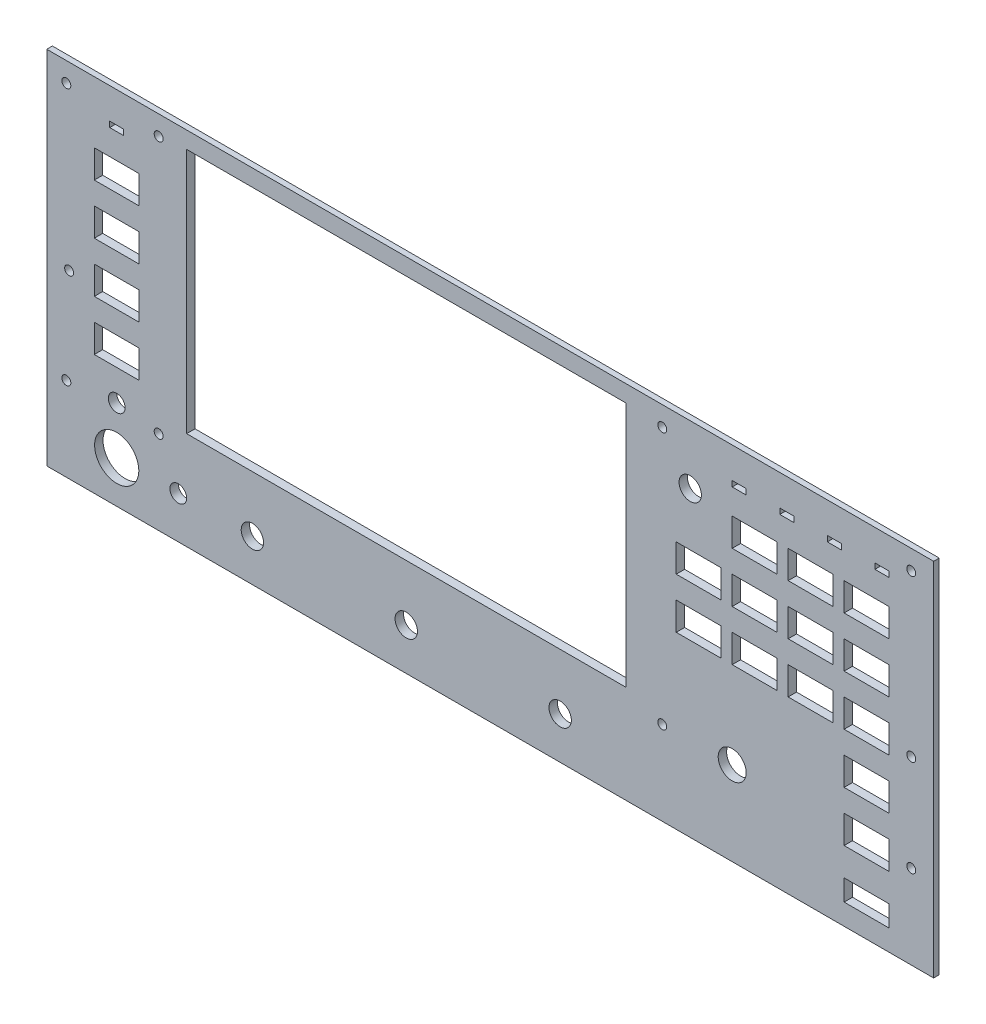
ISO-10303-21;
HEADER;
FILE_DESCRIPTION(('STEP AP214'),'2;1');
FILE_NAME('part.step','',(''),(''),'','','');
FILE_SCHEMA(('AUTOMOTIVE_DESIGN { 1 0 10303 214 1 1 1 1 }'));
ENDSEC;
DATA;
#1=APPLICATION_CONTEXT('core data for automotive mechanical design processes');
#2=APPLICATION_PROTOCOL_DEFINITION('international standard','automotive_design',2000,#1);
#3=PRODUCT_CONTEXT('',#1,'mechanical');
#4=PRODUCT('Part','Part','',(#3));
#5=PRODUCT_RELATED_PRODUCT_CATEGORY('part','',(#4));
#6=PRODUCT_DEFINITION_FORMATION('','',#4);
#7=PRODUCT_DEFINITION_CONTEXT('part definition',#1,'design');
#8=PRODUCT_DEFINITION('design','',#6,#7);
#9=PRODUCT_DEFINITION_SHAPE('','',#8);
#10=(LENGTH_UNIT() NAMED_UNIT(*) SI_UNIT(.MILLI.,.METRE.));
#11=(NAMED_UNIT(*) PLANE_ANGLE_UNIT() SI_UNIT($,.RADIAN.));
#12=(NAMED_UNIT(*) SI_UNIT($,.STERADIAN.) SOLID_ANGLE_UNIT());
#13=UNCERTAINTY_MEASURE_WITH_UNIT(LENGTH_MEASURE(1.E-05),#10,'distance_accuracy_value','');
#14=(GEOMETRIC_REPRESENTATION_CONTEXT(3) GLOBAL_UNCERTAINTY_ASSIGNED_CONTEXT((#13)) GLOBAL_UNIT_ASSIGNED_CONTEXT((#10,
#11,#12)) REPRESENTATION_CONTEXT('',''));
#15=CARTESIAN_POINT('',(0.,0.,0.));
#16=DIRECTION('',(0.,0.,1.));
#17=DIRECTION('',(1.,0.,0.));
#18=AXIS2_PLACEMENT_3D('',#15,#16,#17);
#19=CARTESIAN_POINT('',(158.5,64.5,3.));
#20=DIRECTION('',(-1.,0.,0.));
#21=DIRECTION('',(0.,-1.,0.));
#22=AXIS2_PLACEMENT_3D('',#19,#20,#21);
#23=PLANE('',#22);
#24=DIRECTION('',(0.,-1.,0.));
#25=VECTOR('',#24,1.);
#26=CARTESIAN_POINT('',(158.5,-64.5,1.));
#27=LINE('',#26,#25);
#28=CARTESIAN_POINT('',(158.5,64.5,1.));
#29=VERTEX_POINT('',#28);
#30=CARTESIAN_POINT('',(158.5,-64.5,1.));
#31=VERTEX_POINT('',#30);
#32=EDGE_CURVE('E54',#29,#31,#27,.T.);
#33=ORIENTED_EDGE('',*,*,#32,.F.);
#34=DIRECTION('',(0.,0.,-1.));
#35=VECTOR('',#34,1.);
#36=CARTESIAN_POINT('',(158.5,64.5,3.));
#37=LINE('',#36,#35);
#38=CARTESIAN_POINT('',(158.5,64.5,3.));
#39=VERTEX_POINT('',#38);
#40=EDGE_CURVE('E11',#39,#29,#37,.T.);
#41=ORIENTED_EDGE('',*,*,#40,.F.);
#42=DIRECTION('',(0.,1.,0.));
#43=VECTOR('',#42,1.);
#44=CARTESIAN_POINT('',(158.5,64.5,3.));
#45=LINE('',#44,#43);
#46=CARTESIAN_POINT('',(158.5,-64.5,3.));
#47=VERTEX_POINT('',#46);
#48=EDGE_CURVE('E1941',#47,#39,#45,.T.);
#49=ORIENTED_EDGE('',*,*,#48,.F.);
#50=DIRECTION('',(0.,0.,-1.));
#51=VECTOR('',#50,1.);
#52=CARTESIAN_POINT('',(158.5,-64.5,3.));
#53=LINE('',#52,#51);
#54=EDGE_CURVE('E1957',#47,#31,#53,.T.);
#55=ORIENTED_EDGE('',*,*,#54,.T.);
#56=EDGE_LOOP('',(#33,#41,#49,#55));
#57=FACE_BOUND('',#56,.T.);
#58=ADVANCED_FACE('F39',(#57),#23,.F.);
#59=CARTESIAN_POINT('',(-158.5,64.5,3.));
#60=DIRECTION('',(0.,-1.,0.));
#61=DIRECTION('',(0.,0.,-1.));
#62=AXIS2_PLACEMENT_3D('',#59,#60,#61);
#63=PLANE('',#62);
#64=DIRECTION('',(1.,0.,0.));
#65=VECTOR('',#64,1.);
#66=CARTESIAN_POINT('',(-158.5,64.5,1.));
#67=LINE('',#66,#65);
#68=CARTESIAN_POINT('',(-158.5,64.5,1.));
#69=VERTEX_POINT('',#68);
#70=EDGE_CURVE('E737',#69,#29,#67,.T.);
#71=ORIENTED_EDGE('',*,*,#70,.F.);
#72=DIRECTION('',(0.,0.,-1.));
#73=VECTOR('',#72,1.);
#74=CARTESIAN_POINT('',(-158.5,64.5,3.));
#75=LINE('',#74,#73);
#76=CARTESIAN_POINT('',(-158.5,64.5,3.));
#77=VERTEX_POINT('',#76);
#78=EDGE_CURVE('E47',#77,#69,#75,.T.);
#79=ORIENTED_EDGE('',*,*,#78,.F.);
#80=DIRECTION('',(-1.,0.,0.));
#81=VECTOR('',#80,1.);
#82=CARTESIAN_POINT('',(-158.5,64.5,3.));
#83=LINE('',#82,#81);
#84=EDGE_CURVE('E1948',#39,#77,#83,.T.);
#85=ORIENTED_EDGE('',*,*,#84,.F.);
#86=ORIENTED_EDGE('',*,*,#40,.T.);
#87=EDGE_LOOP('',(#71,#79,#85,#86));
#88=FACE_BOUND('',#87,.T.);
#89=ADVANCED_FACE('F1973',(#88),#63,.F.);
#90=CARTESIAN_POINT('',(-158.5,64.5,3.));
#91=DIRECTION('',(1.,0.,0.));
#92=DIRECTION('',(0.,0.,-1.));
#93=AXIS2_PLACEMENT_3D('',#90,#91,#92);
#94=PLANE('',#93);
#95=DIRECTION('',(0.,1.,0.));
#96=VECTOR('',#95,1.);
#97=CARTESIAN_POINT('',(-158.5,-64.5,1.));
#98=LINE('',#97,#96);
#99=CARTESIAN_POINT('',(-158.5,-64.5,1.));
#100=VERTEX_POINT('',#99);
#101=EDGE_CURVE('E729',#100,#69,#98,.T.);
#102=ORIENTED_EDGE('',*,*,#101,.F.);
#103=DIRECTION('',(0.,0.,-1.));
#104=VECTOR('',#103,1.);
#105=CARTESIAN_POINT('',(-158.5,-64.5,3.));
#106=LINE('',#105,#104);
#107=CARTESIAN_POINT('',(-158.5,-64.5,3.));
#108=VERTEX_POINT('',#107);
#109=EDGE_CURVE('E1961',#108,#100,#106,.T.);
#110=ORIENTED_EDGE('',*,*,#109,.F.);
#111=DIRECTION('',(0.,-1.,0.));
#112=VECTOR('',#111,1.);
#113=CARTESIAN_POINT('',(-158.5,64.5,3.));
#114=LINE('',#113,#112);
#115=EDGE_CURVE('E1951',#77,#108,#114,.T.);
#116=ORIENTED_EDGE('',*,*,#115,.F.);
#117=ORIENTED_EDGE('',*,*,#78,.T.);
#118=EDGE_LOOP('',(#102,#110,#116,#117));
#119=FACE_BOUND('',#118,.T.);
#120=ADVANCED_FACE('F1969',(#119),#94,.F.);
#121=CARTESIAN_POINT('',(-158.5,-64.5,3.));
#122=DIRECTION('',(0.,1.,0.));
#123=DIRECTION('',(0.,0.,1.));
#124=AXIS2_PLACEMENT_3D('',#121,#122,#123);
#125=PLANE('',#124);
#126=DIRECTION('',(-1.,0.,0.));
#127=VECTOR('',#126,1.);
#128=CARTESIAN_POINT('',(-158.5,-64.5,1.));
#129=LINE('',#128,#127);
#130=EDGE_CURVE('E742',#31,#100,#129,.T.);
#131=ORIENTED_EDGE('',*,*,#130,.F.);
#132=ORIENTED_EDGE('',*,*,#54,.F.);
#133=DIRECTION('',(1.,0.,0.));
#134=VECTOR('',#133,1.);
#135=CARTESIAN_POINT('',(-158.5,-64.5,3.));
#136=LINE('',#135,#134);
#137=EDGE_CURVE('E1954',#108,#47,#136,.T.);
#138=ORIENTED_EDGE('',*,*,#137,.F.);
#139=ORIENTED_EDGE('',*,*,#109,.T.);
#140=EDGE_LOOP('',(#131,#132,#138,#139));
#141=FACE_BOUND('',#140,.T.);
#142=ADVANCED_FACE('F1980',(#141),#125,.F.);
#143=CARTESIAN_POINT('',(0.,0.,0.));
#144=DIRECTION('',(0.,0.,1.));
#145=DIRECTION('',(1.,0.,0.));
#146=AXIS2_PLACEMENT_3D('',#143,#144,#145);
#147=PLANE('',#146);
#148=CARTESIAN_POINT('',(-150.5,0.,0.));
#149=DIRECTION('',(0.,0.,1.));
#150=DIRECTION('',(1.,0.,0.));
#151=AXIS2_PLACEMENT_3D('',#148,#149,#150);
#152=CIRCLE('',#151,1.59999999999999);
#153=CARTESIAN_POINT('',(-148.9,0.,0.));
#154=VERTEX_POINT('',#153);
#155=EDGE_CURVE('E1937',#154,#154,#152,.T.);
#156=ORIENTED_EDGE('',*,*,#155,.T.);
#157=EDGE_LOOP('',(#156));
#158=FACE_BOUND('',#157,.T.);
#159=CARTESIAN_POINT('',(150.5,0.,0.));
#160=DIRECTION('',(0.,0.,1.));
#161=DIRECTION('',(1.,0.,0.));
#162=AXIS2_PLACEMENT_3D('',#159,#160,#161);
#163=CIRCLE('',#162,1.59999999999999);
#164=CARTESIAN_POINT('',(152.1,0.,0.));
#165=VERTEX_POINT('',#164);
#166=EDGE_CURVE('E1929',#165,#165,#163,.T.);
#167=ORIENTED_EDGE('',*,*,#166,.T.);
#168=EDGE_LOOP('',(#167));
#169=FACE_BOUND('',#168,.T.);
#170=DIRECTION('',(1.,0.,0.));
#171=VECTOR('',#170,1.);
#172=CARTESIAN_POINT('',(-108.5,-29.5,0.));
#173=LINE('',#172,#171);
#174=CARTESIAN_POINT('',(-108.5,-29.5,0.));
#175=VERTEX_POINT('',#174);
#176=CARTESIAN_POINT('',(48.5,-29.5,0.));
#177=VERTEX_POINT('',#176);
#178=EDGE_CURVE('E1898',#175,#177,#173,.T.);
#179=ORIENTED_EDGE('',*,*,#178,.T.);
#180=DIRECTION('',(0.,1.,0.));
#181=VECTOR('',#180,1.);
#182=CARTESIAN_POINT('',(48.5,58.5,0.));
#183=LINE('',#182,#181);
#184=CARTESIAN_POINT('',(48.5,58.5,0.));
#185=VERTEX_POINT('',#184);
#186=EDGE_CURVE('E1885',#177,#185,#183,.T.);
#187=ORIENTED_EDGE('',*,*,#186,.T.);
#188=DIRECTION('',(-1.,0.,0.));
#189=VECTOR('',#188,1.);
#190=CARTESIAN_POINT('',(-108.5,58.5,0.));
#191=LINE('',#190,#189);
#192=CARTESIAN_POINT('',(-108.5,58.5,0.));
#193=VERTEX_POINT('',#192);
#194=EDGE_CURVE('E1889',#185,#193,#191,.T.);
#195=ORIENTED_EDGE('',*,*,#194,.T.);
#196=DIRECTION('',(0.,-1.,0.));
#197=VECTOR('',#196,1.);
#198=CARTESIAN_POINT('',(-108.5,58.5,0.));
#199=LINE('',#198,#197);
#200=EDGE_CURVE('E1894',#193,#175,#199,.T.);
#201=ORIENTED_EDGE('',*,*,#200,.T.);
#202=EDGE_LOOP('',(#179,#187,#195,#201));
#203=FACE_BOUND('',#202,.T.);
#204=CARTESIAN_POINT('',(-118.5,-34.5,0.));
#205=DIRECTION('',(0.,0.,1.));
#206=DIRECTION('',(1.,0.,0.));
#207=AXIS2_PLACEMENT_3D('',#204,#205,#206);
#208=CIRCLE('',#207,1.59999999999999);
#209=CARTESIAN_POINT('',(-116.9,-34.5,0.));
#210=VERTEX_POINT('',#209);
#211=EDGE_CURVE('E1853',#210,#210,#208,.T.);
#212=ORIENTED_EDGE('',*,*,#211,.T.);
#213=EDGE_LOOP('',(#212));
#214=FACE_BOUND('',#213,.T.);
#215=CARTESIAN_POINT('',(61.5,-34.5,0.));
#216=DIRECTION('',(0.,0.,1.));
#217=DIRECTION('',(1.,0.,0.));
#218=AXIS2_PLACEMENT_3D('',#215,#216,#217);
#219=CIRCLE('',#218,1.59999999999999);
#220=CARTESIAN_POINT('',(63.1,-34.5,0.));
#221=VERTEX_POINT('',#220);
#222=EDGE_CURVE('E1862',#221,#221,#219,.T.);
#223=ORIENTED_EDGE('',*,*,#222,.T.);
#224=EDGE_LOOP('',(#223));
#225=FACE_BOUND('',#224,.T.);
#226=CARTESIAN_POINT('',(61.4999999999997,57.5,0.));
#227=DIRECTION('',(0.,0.,1.));
#228=DIRECTION('',(1.,0.,0.));
#229=AXIS2_PLACEMENT_3D('',#226,#227,#228);
#230=CIRCLE('',#229,1.59999999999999);
#231=CARTESIAN_POINT('',(63.0999999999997,57.5,0.));
#232=VERTEX_POINT('',#231);
#233=EDGE_CURVE('E1870',#232,#232,#230,.T.);
#234=ORIENTED_EDGE('',*,*,#233,.T.);
#235=EDGE_LOOP('',(#234));
#236=FACE_BOUND('',#235,.T.);
#237=CARTESIAN_POINT('',(-118.5,57.5,0.));
#238=DIRECTION('',(0.,0.,1.));
#239=DIRECTION('',(1.,0.,0.));
#240=AXIS2_PLACEMENT_3D('',#237,#238,#239);
#241=CIRCLE('',#240,1.59999999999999);
#242=CARTESIAN_POINT('',(-116.9,57.5,0.));
#243=VERTEX_POINT('',#242);
#244=EDGE_CURVE('E1878',#243,#243,#241,.T.);
#245=ORIENTED_EDGE('',*,*,#244,.T.);
#246=EDGE_LOOP('',(#245));
#247=FACE_BOUND('',#246,.T.);
#248=CARTESIAN_POINT('',(-151.5,-34.5,0.));
#249=DIRECTION('',(0.,0.,1.));
#250=DIRECTION('',(1.,0.,0.));
#251=AXIS2_PLACEMENT_3D('',#248,#249,#250);
#252=CIRCLE('',#251,1.59999999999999);
#253=CARTESIAN_POINT('',(-149.9,-34.5,0.));
#254=VERTEX_POINT('',#253);
#255=EDGE_CURVE('E1821',#254,#254,#252,.T.);
#256=ORIENTED_EDGE('',*,*,#255,.T.);
#257=EDGE_LOOP('',(#256));
#258=FACE_BOUND('',#257,.T.);
#259=CARTESIAN_POINT('',(-151.5,57.5,0.));
#260=DIRECTION('',(0.,0.,1.));
#261=DIRECTION('',(1.,0.,0.));
#262=AXIS2_PLACEMENT_3D('',#259,#260,#261);
#263=CIRCLE('',#262,1.59999999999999);
#264=CARTESIAN_POINT('',(-149.9,57.5,0.));
#265=VERTEX_POINT('',#264);
#266=EDGE_CURVE('E1830',#265,#265,#263,.T.);
#267=ORIENTED_EDGE('',*,*,#266,.T.);
#268=EDGE_LOOP('',(#267));
#269=FACE_BOUND('',#268,.T.);
#270=CARTESIAN_POINT('',(150.5,-34.5,0.));
#271=DIRECTION('',(0.,0.,1.));
#272=DIRECTION('',(1.,0.,0.));
#273=AXIS2_PLACEMENT_3D('',#270,#271,#272);
#274=CIRCLE('',#273,1.59999999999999);
#275=CARTESIAN_POINT('',(152.1,-34.5,0.));
#276=VERTEX_POINT('',#275);
#277=EDGE_CURVE('E1838',#276,#276,#274,.T.);
#278=ORIENTED_EDGE('',*,*,#277,.T.);
#279=EDGE_LOOP('',(#278));
#280=FACE_BOUND('',#279,.T.);
#281=CARTESIAN_POINT('',(150.5,57.5,0.));
#282=DIRECTION('',(0.,0.,1.));
#283=DIRECTION('',(1.,0.,0.));
#284=AXIS2_PLACEMENT_3D('',#281,#282,#283);
#285=CIRCLE('',#284,1.59999999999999);
#286=CARTESIAN_POINT('',(152.1,57.5,0.));
#287=VERTEX_POINT('',#286);
#288=EDGE_CURVE('E1846',#287,#287,#285,.T.);
#289=ORIENTED_EDGE('',*,*,#288,.T.);
#290=EDGE_LOOP('',(#289));
#291=FACE_BOUND('',#290,.T.);
#292=CARTESIAN_POINT('',(86.5,-34.5,0.));
#293=DIRECTION('',(0.,0.,1.));
#294=DIRECTION('',(1.,0.,0.));
#295=AXIS2_PLACEMENT_3D('',#292,#293,#294);
#296=CIRCLE('',#295,5.00000000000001);
#297=CARTESIAN_POINT('',(91.5,-34.5,0.));
#298=VERTEX_POINT('',#297);
#299=EDGE_CURVE('E1813',#298,#298,#296,.T.);
#300=ORIENTED_EDGE('',*,*,#299,.T.);
#301=EDGE_LOOP('',(#300));
#302=FACE_BOUND('',#301,.T.);
#303=DIRECTION('',(-1.,0.,0.));
#304=VECTOR('',#303,1.);
#305=CARTESIAN_POINT('',(126.5,-29.5,0.));
#306=LINE('',#305,#304);
#307=CARTESIAN_POINT('',(142.5,-29.5,0.));
#308=VERTEX_POINT('',#307);
#309=CARTESIAN_POINT('',(126.5,-29.5,0.));
#310=VERTEX_POINT('',#309);
#311=EDGE_CURVE('E1486',#308,#310,#306,.T.);
#312=ORIENTED_EDGE('',*,*,#311,.T.);
#313=DIRECTION('',(0.,-1.,0.));
#314=VECTOR('',#313,1.);
#315=CARTESIAN_POINT('',(126.5,-29.5,0.));
#316=LINE('',#315,#314);
#317=CARTESIAN_POINT('',(126.5,-39.5,0.));
#318=VERTEX_POINT('',#317);
#319=EDGE_CURVE('E1473',#310,#318,#316,.T.);
#320=ORIENTED_EDGE('',*,*,#319,.T.);
#321=DIRECTION('',(1.,0.,0.));
#322=VECTOR('',#321,1.);
#323=CARTESIAN_POINT('',(126.5,-39.5,0.));
#324=LINE('',#323,#322);
#325=CARTESIAN_POINT('',(142.5,-39.5,0.));
#326=VERTEX_POINT('',#325);
#327=EDGE_CURVE('E1477',#318,#326,#324,.T.);
#328=ORIENTED_EDGE('',*,*,#327,.T.);
#329=DIRECTION('',(0.,1.,0.));
#330=VECTOR('',#329,1.);
#331=CARTESIAN_POINT('',(142.5,-29.5,0.));
#332=LINE('',#331,#330);
#333=EDGE_CURVE('E1482',#326,#308,#332,.T.);
#334=ORIENTED_EDGE('',*,*,#333,.T.);
#335=EDGE_LOOP('',(#312,#320,#328,#334));
#336=FACE_BOUND('',#335,.T.);
#337=DIRECTION('',(-1.,0.,0.));
#338=VECTOR('',#337,1.);
#339=CARTESIAN_POINT('',(-141.499999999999,-11.5000000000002,0.));
#340=LINE('',#339,#338);
#341=CARTESIAN_POINT('',(-125.499999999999,-11.5000000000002,0.));
#342=VERTEX_POINT('',#341);
#343=CARTESIAN_POINT('',(-141.499999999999,-11.5000000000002,0.));
#344=VERTEX_POINT('',#343);
#345=EDGE_CURVE('E1532',#342,#344,#340,.T.);
#346=ORIENTED_EDGE('',*,*,#345,.T.);
#347=DIRECTION('',(0.,-1.,0.));
#348=VECTOR('',#347,1.);
#349=CARTESIAN_POINT('',(-141.499999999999,-11.5000000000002,0.));
#350=LINE('',#349,#348);
#351=CARTESIAN_POINT('',(-141.499999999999,-21.5000000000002,0.));
#352=VERTEX_POINT('',#351);
#353=EDGE_CURVE('E1519',#344,#352,#350,.T.);
#354=ORIENTED_EDGE('',*,*,#353,.T.);
#355=DIRECTION('',(1.,0.,0.));
#356=VECTOR('',#355,1.);
#357=CARTESIAN_POINT('',(-141.499999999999,-21.5000000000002,0.));
#358=LINE('',#357,#356);
#359=CARTESIAN_POINT('',(-125.499999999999,-21.5000000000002,0.));
#360=VERTEX_POINT('',#359);
#361=EDGE_CURVE('E1523',#352,#360,#358,.T.);
#362=ORIENTED_EDGE('',*,*,#361,.T.);
#363=DIRECTION('',(0.,1.,0.));
#364=VECTOR('',#363,1.);
#365=CARTESIAN_POINT('',(-125.499999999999,-11.5000000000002,0.));
#366=LINE('',#365,#364);
#367=EDGE_CURVE('E1528',#360,#342,#366,.T.);
#368=ORIENTED_EDGE('',*,*,#367,.T.);
#369=EDGE_LOOP('',(#346,#354,#362,#368));
#370=FACE_BOUND('',#369,.T.);
#371=DIRECTION('',(-1.,0.,0.));
#372=VECTOR('',#371,1.);
#373=CARTESIAN_POINT('',(86.5,53.5,0.));
#374=LINE('',#373,#372);
#375=CARTESIAN_POINT('',(91.5,53.5,0.));
#376=VERTEX_POINT('',#375);
#377=CARTESIAN_POINT('',(86.5,53.5,0.));
#378=VERTEX_POINT('',#377);
#379=EDGE_CURVE('E1576',#376,#378,#374,.T.);
#380=ORIENTED_EDGE('',*,*,#379,.T.);
#381=DIRECTION('',(0.,-1.,0.));
#382=VECTOR('',#381,1.);
#383=CARTESIAN_POINT('',(86.5,53.5,0.));
#384=LINE('',#383,#382);
#385=CARTESIAN_POINT('',(86.5,51.5,0.));
#386=VERTEX_POINT('',#385);
#387=EDGE_CURVE('E1563',#378,#386,#384,.T.);
#388=ORIENTED_EDGE('',*,*,#387,.T.);
#389=DIRECTION('',(1.,0.,0.));
#390=VECTOR('',#389,1.);
#391=CARTESIAN_POINT('',(86.5,51.5,0.));
#392=LINE('',#391,#390);
#393=CARTESIAN_POINT('',(91.5,51.5,0.));
#394=VERTEX_POINT('',#393);
#395=EDGE_CURVE('E1567',#386,#394,#392,.T.);
#396=ORIENTED_EDGE('',*,*,#395,.T.);
#397=DIRECTION('',(0.,1.,0.));
#398=VECTOR('',#397,1.);
#399=CARTESIAN_POINT('',(91.5,53.5,0.));
#400=LINE('',#399,#398);
#401=EDGE_CURVE('E1572',#394,#376,#400,.T.);
#402=ORIENTED_EDGE('',*,*,#401,.T.);
#403=EDGE_LOOP('',(#380,#388,#396,#402));
#404=FACE_BOUND('',#403,.T.);
#405=DIRECTION('',(-1.,0.,0.));
#406=VECTOR('',#405,1.);
#407=CARTESIAN_POINT('',(103.5,53.5,0.));
#408=LINE('',#407,#406);
#409=CARTESIAN_POINT('',(108.5,53.5,0.));
#410=VERTEX_POINT('',#409);
#411=CARTESIAN_POINT('',(103.5,53.5,0.));
#412=VERTEX_POINT('',#411);
#413=EDGE_CURVE('E1620',#410,#412,#408,.T.);
#414=ORIENTED_EDGE('',*,*,#413,.T.);
#415=DIRECTION('',(0.,-1.,0.));
#416=VECTOR('',#415,1.);
#417=CARTESIAN_POINT('',(103.5,53.5,0.));
#418=LINE('',#417,#416);
#419=CARTESIAN_POINT('',(103.5,51.5,0.));
#420=VERTEX_POINT('',#419);
#421=EDGE_CURVE('E1607',#412,#420,#418,.T.);
#422=ORIENTED_EDGE('',*,*,#421,.T.);
#423=DIRECTION('',(1.,0.,0.));
#424=VECTOR('',#423,1.);
#425=CARTESIAN_POINT('',(103.5,51.5,0.));
#426=LINE('',#425,#424);
#427=CARTESIAN_POINT('',(108.5,51.5,0.));
#428=VERTEX_POINT('',#427);
#429=EDGE_CURVE('E1611',#420,#428,#426,.T.);
#430=ORIENTED_EDGE('',*,*,#429,.T.);
#431=DIRECTION('',(0.,1.,0.));
#432=VECTOR('',#431,1.);
#433=CARTESIAN_POINT('',(108.5,53.5,0.));
#434=LINE('',#433,#432);
#435=EDGE_CURVE('E1616',#428,#410,#434,.T.);
#436=ORIENTED_EDGE('',*,*,#435,.T.);
#437=EDGE_LOOP('',(#414,#422,#430,#436));
#438=FACE_BOUND('',#437,.T.);
#439=CARTESIAN_POINT('',(-133.5,-49.5,0.));
#440=DIRECTION('',(0.,0.,1.));
#441=DIRECTION('',(1.,0.,0.));
#442=AXIS2_PLACEMENT_3D('',#439,#440,#441);
#443=CIRCLE('',#442,7.89999999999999);
#444=CARTESIAN_POINT('',(-125.6,-49.5,0.));
#445=VERTEX_POINT('',#444);
#446=EDGE_CURVE('E1355',#445,#445,#443,.T.);
#447=ORIENTED_EDGE('',*,*,#446,.T.);
#448=EDGE_LOOP('',(#447));
#449=FACE_BOUND('',#448,.T.);
#450=DIRECTION('',(-1.,0.,0.));
#451=VECTOR('',#450,1.);
#452=CARTESIAN_POINT('',(137.5,53.5,0.));
#453=LINE('',#452,#451);
#454=CARTESIAN_POINT('',(142.5,53.5,0.));
#455=VERTEX_POINT('',#454);
#456=CARTESIAN_POINT('',(137.5,53.5,0.));
#457=VERTEX_POINT('',#456);
#458=EDGE_CURVE('E1346',#455,#457,#453,.T.);
#459=ORIENTED_EDGE('',*,*,#458,.T.);
#460=DIRECTION('',(0.,-1.,0.));
#461=VECTOR('',#460,1.);
#462=CARTESIAN_POINT('',(137.5,53.5,0.));
#463=LINE('',#462,#461);
#464=CARTESIAN_POINT('',(137.5,51.5,0.));
#465=VERTEX_POINT('',#464);
#466=EDGE_CURVE('E1333',#457,#465,#463,.T.);
#467=ORIENTED_EDGE('',*,*,#466,.T.);
#468=DIRECTION('',(1.,0.,0.));
#469=VECTOR('',#468,1.);
#470=CARTESIAN_POINT('',(137.5,51.5,0.));
#471=LINE('',#470,#469);
#472=CARTESIAN_POINT('',(142.5,51.5,0.));
#473=VERTEX_POINT('',#472);
#474=EDGE_CURVE('E1337',#465,#473,#471,.T.);
#475=ORIENTED_EDGE('',*,*,#474,.T.);
#476=DIRECTION('',(0.,1.,0.));
#477=VECTOR('',#476,1.);
#478=CARTESIAN_POINT('',(142.5,53.5,0.));
#479=LINE('',#478,#477);
#480=EDGE_CURVE('E1342',#473,#455,#479,.T.);
#481=ORIENTED_EDGE('',*,*,#480,.T.);
#482=EDGE_LOOP('',(#459,#467,#475,#481));
#483=FACE_BOUND('',#482,.T.);
#484=DIRECTION('',(-1.,0.,0.));
#485=VECTOR('',#484,1.);
#486=CARTESIAN_POINT('',(120.5,53.5,0.));
#487=LINE('',#486,#485);
#488=CARTESIAN_POINT('',(125.5,53.5,0.));
#489=VERTEX_POINT('',#488);
#490=CARTESIAN_POINT('',(120.5,53.5,0.));
#491=VERTEX_POINT('',#490);
#492=EDGE_CURVE('E1444',#489,#491,#487,.T.);
#493=ORIENTED_EDGE('',*,*,#492,.T.);
#494=DIRECTION('',(0.,-1.,0.));
#495=VECTOR('',#494,1.);
#496=CARTESIAN_POINT('',(120.5,53.5,0.));
#497=LINE('',#496,#495);
#498=CARTESIAN_POINT('',(120.5,51.5,0.));
#499=VERTEX_POINT('',#498);
#500=EDGE_CURVE('E1431',#491,#499,#497,.T.);
#501=ORIENTED_EDGE('',*,*,#500,.T.);
#502=DIRECTION('',(1.,0.,0.));
#503=VECTOR('',#502,1.);
#504=CARTESIAN_POINT('',(120.5,51.5,0.));
#505=LINE('',#504,#503);
#506=CARTESIAN_POINT('',(125.5,51.5,0.));
#507=VERTEX_POINT('',#506);
#508=EDGE_CURVE('E1435',#499,#507,#505,.T.);
#509=ORIENTED_EDGE('',*,*,#508,.T.);
#510=DIRECTION('',(0.,1.,0.));
#511=VECTOR('',#510,1.);
#512=CARTESIAN_POINT('',(125.5,53.5,0.));
#513=LINE('',#512,#511);
#514=EDGE_CURVE('E1440',#507,#489,#513,.T.);
#515=ORIENTED_EDGE('',*,*,#514,.T.);
#516=EDGE_LOOP('',(#493,#501,#509,#515));
#517=FACE_BOUND('',#516,.T.);
#518=DIRECTION('',(-1.,0.,0.));
#519=VECTOR('',#518,1.);
#520=CARTESIAN_POINT('',(-141.5,42.5,0.));
#521=LINE('',#520,#519);
#522=CARTESIAN_POINT('',(-125.5,42.5,0.));
#523=VERTEX_POINT('',#522);
#524=CARTESIAN_POINT('',(-141.5,42.5,0.));
#525=VERTEX_POINT('',#524);
#526=EDGE_CURVE('E1398',#523,#525,#521,.T.);
#527=ORIENTED_EDGE('',*,*,#526,.T.);
#528=DIRECTION('',(0.,-1.,0.));
#529=VECTOR('',#528,1.);
#530=CARTESIAN_POINT('',(-141.5,42.5,0.));
#531=LINE('',#530,#529);
#532=CARTESIAN_POINT('',(-141.5,32.5,0.));
#533=VERTEX_POINT('',#532);
#534=EDGE_CURVE('E1385',#525,#533,#531,.T.);
#535=ORIENTED_EDGE('',*,*,#534,.T.);
#536=DIRECTION('',(1.,0.,0.));
#537=VECTOR('',#536,1.);
#538=CARTESIAN_POINT('',(-141.5,32.5,0.));
#539=LINE('',#538,#537);
#540=CARTESIAN_POINT('',(-125.5,32.5,0.));
#541=VERTEX_POINT('',#540);
#542=EDGE_CURVE('E1389',#533,#541,#539,.T.);
#543=ORIENTED_EDGE('',*,*,#542,.T.);
#544=DIRECTION('',(0.,1.,0.));
#545=VECTOR('',#544,1.);
#546=CARTESIAN_POINT('',(-125.5,42.5,0.));
#547=LINE('',#546,#545);
#548=EDGE_CURVE('E1394',#541,#523,#547,.T.);
#549=ORIENTED_EDGE('',*,*,#548,.T.);
#550=EDGE_LOOP('',(#527,#535,#543,#549));
#551=FACE_BOUND('',#550,.T.);
#552=DIRECTION('',(-1.,0.,0.));
#553=VECTOR('',#552,1.);
#554=CARTESIAN_POINT('',(-136.,53.4999999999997,0.));
#555=LINE('',#554,#553);
#556=CARTESIAN_POINT('',(-131.,53.4999999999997,0.));
#557=VERTEX_POINT('',#556);
#558=CARTESIAN_POINT('',(-136.,53.4999999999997,0.));
#559=VERTEX_POINT('',#558);
#560=EDGE_CURVE('E1740',#557,#559,#555,.T.);
#561=ORIENTED_EDGE('',*,*,#560,.T.);
#562=DIRECTION('',(0.,-1.,0.));
#563=VECTOR('',#562,1.);
#564=CARTESIAN_POINT('',(-136.,51.4999999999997,0.));
#565=LINE('',#564,#563);
#566=CARTESIAN_POINT('',(-136.,51.4999999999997,0.));
#567=VERTEX_POINT('',#566);
#568=EDGE_CURVE('E1727',#559,#567,#565,.T.);
#569=ORIENTED_EDGE('',*,*,#568,.T.);
#570=DIRECTION('',(1.,0.,0.));
#571=VECTOR('',#570,1.);
#572=CARTESIAN_POINT('',(-136.,51.4999999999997,0.));
#573=LINE('',#572,#571);
#574=CARTESIAN_POINT('',(-131.,51.4999999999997,0.));
#575=VERTEX_POINT('',#574);
#576=EDGE_CURVE('E1731',#567,#575,#573,.T.);
#577=ORIENTED_EDGE('',*,*,#576,.T.);
#578=DIRECTION('',(0.,1.,0.));
#579=VECTOR('',#578,1.);
#580=CARTESIAN_POINT('',(-131.,51.4999999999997,0.));
#581=LINE('',#580,#579);
#582=EDGE_CURVE('E1736',#575,#557,#581,.T.);
#583=ORIENTED_EDGE('',*,*,#582,.T.);
#584=EDGE_LOOP('',(#561,#569,#577,#583));
#585=FACE_BOUND('',#584,.T.);
#586=DIRECTION('',(-1.,0.,0.));
#587=VECTOR('',#586,1.);
#588=CARTESIAN_POINT('',(-141.5,24.4999999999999,0.));
#589=LINE('',#588,#587);
#590=CARTESIAN_POINT('',(-125.5,24.4999999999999,0.));
#591=VERTEX_POINT('',#590);
#592=CARTESIAN_POINT('',(-141.5,24.4999999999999,0.));
#593=VERTEX_POINT('',#592);
#594=EDGE_CURVE('E1784',#591,#593,#589,.T.);
#595=ORIENTED_EDGE('',*,*,#594,.T.);
#596=DIRECTION('',(0.,-1.,0.));
#597=VECTOR('',#596,1.);
#598=CARTESIAN_POINT('',(-141.5,24.4999999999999,0.));
#599=LINE('',#598,#597);
#600=CARTESIAN_POINT('',(-141.5,14.4999999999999,0.));
#601=VERTEX_POINT('',#600);
#602=EDGE_CURVE('E1771',#593,#601,#599,.T.);
#603=ORIENTED_EDGE('',*,*,#602,.T.);
#604=DIRECTION('',(1.,0.,0.));
#605=VECTOR('',#604,1.);
#606=CARTESIAN_POINT('',(-141.5,14.4999999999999,0.));
#607=LINE('',#606,#605);
#608=CARTESIAN_POINT('',(-125.5,14.4999999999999,0.));
#609=VERTEX_POINT('',#608);
#610=EDGE_CURVE('E1775',#601,#609,#607,.T.);
#611=ORIENTED_EDGE('',*,*,#610,.T.);
#612=DIRECTION('',(0.,1.,0.));
#613=VECTOR('',#612,1.);
#614=CARTESIAN_POINT('',(-125.5,24.4999999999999,0.));
#615=LINE('',#614,#613);
#616=EDGE_CURVE('E1780',#609,#591,#615,.T.);
#617=ORIENTED_EDGE('',*,*,#616,.T.);
#618=EDGE_LOOP('',(#595,#603,#611,#617));
#619=FACE_BOUND('',#618,.T.);
#620=CARTESIAN_POINT('',(71.5,43.5,0.));
#621=DIRECTION('',(0.,0.,1.));
#622=DIRECTION('',(1.,0.,0.));
#623=AXIS2_PLACEMENT_3D('',#620,#621,#622);
#624=CIRCLE('',#623,4.00000000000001);
#625=CARTESIAN_POINT('',(75.5,43.5,0.));
#626=VERTEX_POINT('',#625);
#627=EDGE_CURVE('E1675',#626,#626,#624,.T.);
#628=ORIENTED_EDGE('',*,*,#627,.T.);
#629=EDGE_LOOP('',(#628));
#630=FACE_BOUND('',#629,.T.);
#631=DIRECTION('',(-1.,0.,0.));
#632=VECTOR('',#631,1.);
#633=CARTESIAN_POINT('',(-141.5,6.49999999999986,0.));
#634=LINE('',#633,#632);
#635=CARTESIAN_POINT('',(-125.5,6.49999999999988,0.));
#636=VERTEX_POINT('',#635);
#637=CARTESIAN_POINT('',(-141.5,6.49999999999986,0.));
#638=VERTEX_POINT('',#637);
#639=EDGE_CURVE('E1698',#636,#638,#634,.T.);
#640=ORIENTED_EDGE('',*,*,#639,.T.);
#641=DIRECTION('',(0.,-1.,0.));
#642=VECTOR('',#641,1.);
#643=CARTESIAN_POINT('',(-141.5,6.49999999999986,0.));
#644=LINE('',#643,#642);
#645=CARTESIAN_POINT('',(-141.5,-3.50000000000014,0.));
#646=VERTEX_POINT('',#645);
#647=EDGE_CURVE('E1685',#638,#646,#644,.T.);
#648=ORIENTED_EDGE('',*,*,#647,.T.);
#649=DIRECTION('',(1.,0.,0.));
#650=VECTOR('',#649,1.);
#651=CARTESIAN_POINT('',(-141.5,-3.50000000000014,0.));
#652=LINE('',#651,#650);
#653=CARTESIAN_POINT('',(-125.5,-3.50000000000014,0.));
#654=VERTEX_POINT('',#653);
#655=EDGE_CURVE('E1689',#646,#654,#652,.T.);
#656=ORIENTED_EDGE('',*,*,#655,.T.);
#657=DIRECTION('',(0.,1.,0.));
#658=VECTOR('',#657,1.);
#659=CARTESIAN_POINT('',(-125.5,6.49999999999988,0.));
#660=LINE('',#659,#658);
#661=EDGE_CURVE('E1694',#654,#636,#660,.T.);
#662=ORIENTED_EDGE('',*,*,#661,.T.);
#663=EDGE_LOOP('',(#640,#648,#656,#662));
#664=FACE_BOUND('',#663,.T.);
#665=CARTESIAN_POINT('',(25.,-49.5,0.));
#666=DIRECTION('',(0.,0.,1.));
#667=DIRECTION('',(1.,0.,0.));
#668=AXIS2_PLACEMENT_3D('',#665,#666,#667);
#669=CIRCLE('',#668,4.);
#670=CARTESIAN_POINT('',(29.,-49.5,0.));
#671=VERTEX_POINT('',#670);
#672=EDGE_CURVE('E1666',#671,#671,#669,.T.);
#673=ORIENTED_EDGE('',*,*,#672,.T.);
#674=EDGE_LOOP('',(#673));
#675=FACE_BOUND('',#674,.T.);
#676=CARTESIAN_POINT('',(-30.,-49.5,0.));
#677=DIRECTION('',(0.,0.,1.));
#678=DIRECTION('',(1.,0.,0.));
#679=AXIS2_PLACEMENT_3D('',#676,#677,#678);
#680=CIRCLE('',#679,4.);
#681=CARTESIAN_POINT('',(-26.,-49.5,0.));
#682=VERTEX_POINT('',#681);
#683=EDGE_CURVE('E1658',#682,#682,#680,.T.);
#684=ORIENTED_EDGE('',*,*,#683,.T.);
#685=EDGE_LOOP('',(#684));
#686=FACE_BOUND('',#685,.T.);
#687=CARTESIAN_POINT('',(-85.,-49.5,0.));
#688=DIRECTION('',(0.,0.,1.));
#689=DIRECTION('',(1.,0.,0.));
#690=AXIS2_PLACEMENT_3D('',#687,#688,#689);
#691=CIRCLE('',#690,4.00000000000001);
#692=CARTESIAN_POINT('',(-81.,-49.5,0.));
#693=VERTEX_POINT('',#692);
#694=EDGE_CURVE('E1649',#693,#693,#691,.T.);
#695=ORIENTED_EDGE('',*,*,#694,.T.);
#696=EDGE_LOOP('',(#695));
#697=FACE_BOUND('',#696,.T.);
#698=DIRECTION('',(-1.,0.,0.));
#699=VECTOR('',#698,1.);
#700=CARTESIAN_POINT('',(126.5,42.5,0.));
#701=LINE('',#700,#699);
#702=CARTESIAN_POINT('',(142.5,42.5,0.));
#703=VERTEX_POINT('',#702);
#704=CARTESIAN_POINT('',(126.5,42.5,0.));
#705=VERTEX_POINT('',#704);
#706=EDGE_CURVE('E1069',#703,#705,#701,.T.);
#707=ORIENTED_EDGE('',*,*,#706,.T.);
#708=DIRECTION('',(0.,-1.,0.));
#709=VECTOR('',#708,1.);
#710=CARTESIAN_POINT('',(126.5,42.5,0.));
#711=LINE('',#710,#709);
#712=CARTESIAN_POINT('',(126.5,32.5,0.));
#713=VERTEX_POINT('',#712);
#714=EDGE_CURVE('E1056',#705,#713,#711,.T.);
#715=ORIENTED_EDGE('',*,*,#714,.T.);
#716=DIRECTION('',(1.,0.,0.));
#717=VECTOR('',#716,1.);
#718=CARTESIAN_POINT('',(126.5,32.5,0.));
#719=LINE('',#718,#717);
#720=CARTESIAN_POINT('',(142.5,32.5,0.));
#721=VERTEX_POINT('',#720);
#722=EDGE_CURVE('E1060',#713,#721,#719,.T.);
#723=ORIENTED_EDGE('',*,*,#722,.T.);
#724=DIRECTION('',(0.,1.,0.));
#725=VECTOR('',#724,1.);
#726=CARTESIAN_POINT('',(142.5,42.5,0.));
#727=LINE('',#726,#725);
#728=EDGE_CURVE('E1065',#721,#703,#727,.T.);
#729=ORIENTED_EDGE('',*,*,#728,.T.);
#730=EDGE_LOOP('',(#707,#715,#723,#729));
#731=FACE_BOUND('',#730,.T.);
#732=DIRECTION('',(-1.,0.,0.));
#733=VECTOR('',#732,1.);
#734=CARTESIAN_POINT('',(126.5,24.5,0.));
#735=LINE('',#734,#733);
#736=CARTESIAN_POINT('',(142.5,24.5,0.));
#737=VERTEX_POINT('',#736);
#738=CARTESIAN_POINT('',(126.5,24.5,0.));
#739=VERTEX_POINT('',#738);
#740=EDGE_CURVE('E1025',#737,#739,#735,.T.);
#741=ORIENTED_EDGE('',*,*,#740,.T.);
#742=DIRECTION('',(0.,-1.,0.));
#743=VECTOR('',#742,1.);
#744=CARTESIAN_POINT('',(126.5,24.5,0.));
#745=LINE('',#744,#743);
#746=CARTESIAN_POINT('',(126.5,14.5,0.));
#747=VERTEX_POINT('',#746);
#748=EDGE_CURVE('E1012',#739,#747,#745,.T.);
#749=ORIENTED_EDGE('',*,*,#748,.T.);
#750=DIRECTION('',(1.,0.,0.));
#751=VECTOR('',#750,1.);
#752=CARTESIAN_POINT('',(126.5,14.5,0.));
#753=LINE('',#752,#751);
#754=CARTESIAN_POINT('',(142.5,14.5,0.));
#755=VERTEX_POINT('',#754);
#756=EDGE_CURVE('E1016',#747,#755,#753,.T.);
#757=ORIENTED_EDGE('',*,*,#756,.T.);
#758=DIRECTION('',(0.,1.,0.));
#759=VECTOR('',#758,1.);
#760=CARTESIAN_POINT('',(142.5,24.5,0.));
#761=LINE('',#760,#759);
#762=EDGE_CURVE('E1021',#755,#737,#761,.T.);
#763=ORIENTED_EDGE('',*,*,#762,.T.);
#764=EDGE_LOOP('',(#741,#749,#757,#763));
#765=FACE_BOUND('',#764,.T.);
#766=DIRECTION('',(-1.,0.,0.));
#767=VECTOR('',#766,1.);
#768=CARTESIAN_POINT('',(126.5,6.49999999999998,0.));
#769=LINE('',#768,#767);
#770=CARTESIAN_POINT('',(142.5,6.49999999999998,0.));
#771=VERTEX_POINT('',#770);
#772=CARTESIAN_POINT('',(126.5,6.49999999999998,0.));
#773=VERTEX_POINT('',#772);
#774=EDGE_CURVE('E981',#771,#773,#769,.T.);
#775=ORIENTED_EDGE('',*,*,#774,.T.);
#776=DIRECTION('',(0.,-1.,0.));
#777=VECTOR('',#776,1.);
#778=CARTESIAN_POINT('',(126.5,6.49999999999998,0.));
#779=LINE('',#778,#777);
#780=CARTESIAN_POINT('',(126.5,-3.50000000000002,0.));
#781=VERTEX_POINT('',#780);
#782=EDGE_CURVE('E968',#773,#781,#779,.T.);
#783=ORIENTED_EDGE('',*,*,#782,.T.);
#784=DIRECTION('',(1.,0.,0.));
#785=VECTOR('',#784,1.);
#786=CARTESIAN_POINT('',(126.5,-3.50000000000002,0.));
#787=LINE('',#786,#785);
#788=CARTESIAN_POINT('',(142.5,-3.50000000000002,0.));
#789=VERTEX_POINT('',#788);
#790=EDGE_CURVE('E972',#781,#789,#787,.T.);
#791=ORIENTED_EDGE('',*,*,#790,.T.);
#792=DIRECTION('',(0.,1.,0.));
#793=VECTOR('',#792,1.);
#794=CARTESIAN_POINT('',(142.5,6.49999999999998,0.));
#795=LINE('',#794,#793);
#796=EDGE_CURVE('E977',#789,#771,#795,.T.);
#797=ORIENTED_EDGE('',*,*,#796,.T.);
#798=EDGE_LOOP('',(#775,#783,#791,#797));
#799=FACE_BOUND('',#798,.T.);
#800=DIRECTION('',(-1.,0.,0.));
#801=VECTOR('',#800,1.);
#802=CARTESIAN_POINT('',(126.5,-11.5,0.));
#803=LINE('',#802,#801);
#804=CARTESIAN_POINT('',(142.5,-11.5,0.));
#805=VERTEX_POINT('',#804);
#806=CARTESIAN_POINT('',(126.5,-11.5,0.));
#807=VERTEX_POINT('',#806);
#808=EDGE_CURVE('E937',#805,#807,#803,.T.);
#809=ORIENTED_EDGE('',*,*,#808,.T.);
#810=DIRECTION('',(0.,-1.,0.));
#811=VECTOR('',#810,1.);
#812=CARTESIAN_POINT('',(126.5,-11.5,0.));
#813=LINE('',#812,#811);
#814=CARTESIAN_POINT('',(126.5,-21.5,0.));
#815=VERTEX_POINT('',#814);
#816=EDGE_CURVE('E924',#807,#815,#813,.T.);
#817=ORIENTED_EDGE('',*,*,#816,.T.);
#818=DIRECTION('',(1.,0.,0.));
#819=VECTOR('',#818,1.);
#820=CARTESIAN_POINT('',(126.5,-21.5,0.));
#821=LINE('',#820,#819);
#822=CARTESIAN_POINT('',(142.5,-21.5,0.));
#823=VERTEX_POINT('',#822);
#824=EDGE_CURVE('E928',#815,#823,#821,.T.);
#825=ORIENTED_EDGE('',*,*,#824,.T.);
#826=DIRECTION('',(0.,1.,0.));
#827=VECTOR('',#826,1.);
#828=CARTESIAN_POINT('',(142.5,-11.5,0.));
#829=LINE('',#828,#827);
#830=EDGE_CURVE('E933',#823,#805,#829,.T.);
#831=ORIENTED_EDGE('',*,*,#830,.T.);
#832=EDGE_LOOP('',(#809,#817,#825,#831));
#833=FACE_BOUND('',#832,.T.);
#834=DIRECTION('',(-1.,0.,0.));
#835=VECTOR('',#834,1.);
#836=CARTESIAN_POINT('',(86.4999999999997,42.4999999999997,0.));
#837=LINE('',#836,#835);
#838=CARTESIAN_POINT('',(102.5,42.4999999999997,0.));
#839=VERTEX_POINT('',#838);
#840=CARTESIAN_POINT('',(86.4999999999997,42.4999999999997,0.));
#841=VERTEX_POINT('',#840);
#842=EDGE_CURVE('E893',#839,#841,#837,.T.);
#843=ORIENTED_EDGE('',*,*,#842,.T.);
#844=DIRECTION('',(0.,-1.,0.));
#845=VECTOR('',#844,1.);
#846=CARTESIAN_POINT('',(86.4999999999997,42.4999999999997,0.));
#847=LINE('',#846,#845);
#848=CARTESIAN_POINT('',(86.4999999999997,32.4999999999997,0.));
#849=VERTEX_POINT('',#848);
#850=EDGE_CURVE('E880',#841,#849,#847,.T.);
#851=ORIENTED_EDGE('',*,*,#850,.T.);
#852=DIRECTION('',(1.,0.,0.));
#853=VECTOR('',#852,1.);
#854=CARTESIAN_POINT('',(86.4999999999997,32.4999999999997,0.));
#855=LINE('',#854,#853);
#856=CARTESIAN_POINT('',(102.5,32.4999999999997,0.));
#857=VERTEX_POINT('',#856);
#858=EDGE_CURVE('E884',#849,#857,#855,.T.);
#859=ORIENTED_EDGE('',*,*,#858,.T.);
#860=DIRECTION('',(0.,1.,0.));
#861=VECTOR('',#860,1.);
#862=CARTESIAN_POINT('',(102.5,42.4999999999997,0.));
#863=LINE('',#862,#861);
#864=EDGE_CURVE('E889',#857,#839,#863,.T.);
#865=ORIENTED_EDGE('',*,*,#864,.T.);
#866=EDGE_LOOP('',(#843,#851,#859,#865));
#867=FACE_BOUND('',#866,.T.);
#868=DIRECTION('',(-1.,0.,0.));
#869=VECTOR('',#868,1.);
#870=CARTESIAN_POINT('',(106.5,42.4999999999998,0.));
#871=LINE('',#870,#869);
#872=CARTESIAN_POINT('',(122.5,42.4999999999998,0.));
#873=VERTEX_POINT('',#872);
#874=CARTESIAN_POINT('',(106.5,42.4999999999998,0.));
#875=VERTEX_POINT('',#874);
#876=EDGE_CURVE('E849',#873,#875,#871,.T.);
#877=ORIENTED_EDGE('',*,*,#876,.T.);
#878=DIRECTION('',(0.,-1.,0.));
#879=VECTOR('',#878,1.);
#880=CARTESIAN_POINT('',(106.5,42.4999999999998,0.));
#881=LINE('',#880,#879);
#882=CARTESIAN_POINT('',(106.5,32.4999999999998,0.));
#883=VERTEX_POINT('',#882);
#884=EDGE_CURVE('E836',#875,#883,#881,.T.);
#885=ORIENTED_EDGE('',*,*,#884,.T.);
#886=DIRECTION('',(1.,0.,0.));
#887=VECTOR('',#886,1.);
#888=CARTESIAN_POINT('',(106.5,32.4999999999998,0.));
#889=LINE('',#888,#887);
#890=CARTESIAN_POINT('',(122.5,32.4999999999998,0.));
#891=VERTEX_POINT('',#890);
#892=EDGE_CURVE('E840',#883,#891,#889,.T.);
#893=ORIENTED_EDGE('',*,*,#892,.T.);
#894=DIRECTION('',(0.,1.,0.));
#895=VECTOR('',#894,1.);
#896=CARTESIAN_POINT('',(122.5,42.4999999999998,0.));
#897=LINE('',#896,#895);
#898=EDGE_CURVE('E845',#891,#873,#897,.T.);
#899=ORIENTED_EDGE('',*,*,#898,.T.);
#900=EDGE_LOOP('',(#877,#885,#893,#899));
#901=FACE_BOUND('',#900,.T.);
#902=DIRECTION('',(-1.,0.,0.));
#903=VECTOR('',#902,1.);
#904=CARTESIAN_POINT('',(66.4999999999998,24.4999999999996,0.));
#905=LINE('',#904,#903);
#906=CARTESIAN_POINT('',(82.4999999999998,24.4999999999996,0.));
#907=VERTEX_POINT('',#906);
#908=CARTESIAN_POINT('',(66.4999999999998,24.4999999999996,0.));
#909=VERTEX_POINT('',#908);
#910=EDGE_CURVE('E805',#907,#909,#905,.T.);
#911=ORIENTED_EDGE('',*,*,#910,.T.);
#912=DIRECTION('',(0.,-1.,0.));
#913=VECTOR('',#912,1.);
#914=CARTESIAN_POINT('',(66.4999999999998,24.4999999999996,0.));
#915=LINE('',#914,#913);
#916=CARTESIAN_POINT('',(66.4999999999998,14.4999999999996,0.));
#917=VERTEX_POINT('',#916);
#918=EDGE_CURVE('E792',#909,#917,#915,.T.);
#919=ORIENTED_EDGE('',*,*,#918,.T.);
#920=DIRECTION('',(1.,0.,0.));
#921=VECTOR('',#920,1.);
#922=CARTESIAN_POINT('',(66.4999999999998,14.4999999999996,0.));
#923=LINE('',#922,#921);
#924=CARTESIAN_POINT('',(82.4999999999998,14.4999999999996,0.));
#925=VERTEX_POINT('',#924);
#926=EDGE_CURVE('E796',#917,#925,#923,.T.);
#927=ORIENTED_EDGE('',*,*,#926,.T.);
#928=DIRECTION('',(0.,1.,0.));
#929=VECTOR('',#928,1.);
#930=CARTESIAN_POINT('',(82.4999999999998,24.4999999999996,0.));
#931=LINE('',#930,#929);
#932=EDGE_CURVE('E801',#925,#907,#931,.T.);
#933=ORIENTED_EDGE('',*,*,#932,.T.);
#934=EDGE_LOOP('',(#911,#919,#927,#933));
#935=FACE_BOUND('',#934,.T.);
#936=DIRECTION('',(-1.,0.,0.));
#937=VECTOR('',#936,1.);
#938=CARTESIAN_POINT('',(86.4999999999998,24.4999999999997,0.));
#939=LINE('',#938,#937);
#940=CARTESIAN_POINT('',(102.5,24.4999999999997,0.));
#941=VERTEX_POINT('',#940);
#942=CARTESIAN_POINT('',(86.4999999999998,24.4999999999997,0.));
#943=VERTEX_POINT('',#942);
#944=EDGE_CURVE('E759',#941,#943,#939,.T.);
#945=ORIENTED_EDGE('',*,*,#944,.T.);
#946=DIRECTION('',(0.,-1.,0.));
#947=VECTOR('',#946,1.);
#948=CARTESIAN_POINT('',(86.4999999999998,24.4999999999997,0.));
#949=LINE('',#948,#947);
#950=CARTESIAN_POINT('',(86.4999999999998,14.4999999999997,0.));
#951=VERTEX_POINT('',#950);
#952=EDGE_CURVE('E746',#943,#951,#949,.T.);
#953=ORIENTED_EDGE('',*,*,#952,.T.);
#954=DIRECTION('',(1.,0.,0.));
#955=VECTOR('',#954,1.);
#956=CARTESIAN_POINT('',(86.4999999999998,14.4999999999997,0.));
#957=LINE('',#956,#955);
#958=CARTESIAN_POINT('',(102.5,14.4999999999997,0.));
#959=VERTEX_POINT('',#958);
#960=EDGE_CURVE('E750',#951,#959,#957,.T.);
#961=ORIENTED_EDGE('',*,*,#960,.T.);
#962=DIRECTION('',(0.,1.,0.));
#963=VECTOR('',#962,1.);
#964=CARTESIAN_POINT('',(102.5,24.4999999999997,0.));
#965=LINE('',#964,#963);
#966=EDGE_CURVE('E755',#959,#941,#965,.T.);
#967=ORIENTED_EDGE('',*,*,#966,.T.);
#968=EDGE_LOOP('',(#945,#953,#961,#967));
#969=FACE_BOUND('',#968,.T.);
#970=DIRECTION('',(-1.,0.,0.));
#971=VECTOR('',#970,1.);
#972=CARTESIAN_POINT('',(106.5,6.49999999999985,0.));
#973=LINE('',#972,#971);
#974=CARTESIAN_POINT('',(122.5,6.49999999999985,0.));
#975=VERTEX_POINT('',#974);
#976=CARTESIAN_POINT('',(106.5,6.49999999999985,0.));
#977=VERTEX_POINT('',#976);
#978=EDGE_CURVE('E1251',#975,#977,#973,.T.);
#979=ORIENTED_EDGE('',*,*,#978,.T.);
#980=DIRECTION('',(0.,-1.,0.));
#981=VECTOR('',#980,1.);
#982=CARTESIAN_POINT('',(106.5,6.49999999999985,0.));
#983=LINE('',#982,#981);
#984=CARTESIAN_POINT('',(106.5,-3.50000000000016,0.));
#985=VERTEX_POINT('',#984);
#986=EDGE_CURVE('E1238',#977,#985,#983,.T.);
#987=ORIENTED_EDGE('',*,*,#986,.T.);
#988=DIRECTION('',(1.,0.,0.));
#989=VECTOR('',#988,1.);
#990=CARTESIAN_POINT('',(106.5,-3.50000000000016,0.));
#991=LINE('',#990,#989);
#992=CARTESIAN_POINT('',(122.5,-3.50000000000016,0.));
#993=VERTEX_POINT('',#992);
#994=EDGE_CURVE('E1242',#985,#993,#991,.T.);
#995=ORIENTED_EDGE('',*,*,#994,.T.);
#996=DIRECTION('',(0.,1.,0.));
#997=VECTOR('',#996,1.);
#998=CARTESIAN_POINT('',(122.5,6.49999999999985,0.));
#999=LINE('',#998,#997);
#1000=EDGE_CURVE('E1247',#993,#975,#999,.T.);
#1001=ORIENTED_EDGE('',*,*,#1000,.T.);
#1002=EDGE_LOOP('',(#979,#987,#995,#1001));
#1003=FACE_BOUND('',#1002,.T.);
#1004=DIRECTION('',(-1.,0.,0.));
#1005=VECTOR('',#1004,1.);
#1006=CARTESIAN_POINT('',(86.4999999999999,6.49999999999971,0.));
#1007=LINE('',#1006,#1005);
#1008=CARTESIAN_POINT('',(102.5,6.49999999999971,0.));
#1009=VERTEX_POINT('',#1008);
#1010=CARTESIAN_POINT('',(86.4999999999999,6.49999999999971,0.));
#1011=VERTEX_POINT('',#1010);
#1012=EDGE_CURVE('E1297',#1009,#1011,#1007,.T.);
#1013=ORIENTED_EDGE('',*,*,#1012,.T.);
#1014=DIRECTION('',(0.,-1.,0.));
#1015=VECTOR('',#1014,1.);
#1016=CARTESIAN_POINT('',(86.4999999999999,6.49999999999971,0.));
#1017=LINE('',#1016,#1015);
#1018=CARTESIAN_POINT('',(86.4999999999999,-3.50000000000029,0.));
#1019=VERTEX_POINT('',#1018);
#1020=EDGE_CURVE('E1284',#1011,#1019,#1017,.T.);
#1021=ORIENTED_EDGE('',*,*,#1020,.T.);
#1022=DIRECTION('',(1.,0.,0.));
#1023=VECTOR('',#1022,1.);
#1024=CARTESIAN_POINT('',(86.4999999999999,-3.50000000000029,0.));
#1025=LINE('',#1024,#1023);
#1026=CARTESIAN_POINT('',(102.5,-3.50000000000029,0.));
#1027=VERTEX_POINT('',#1026);
#1028=EDGE_CURVE('E1288',#1019,#1027,#1025,.T.);
#1029=ORIENTED_EDGE('',*,*,#1028,.T.);
#1030=DIRECTION('',(0.,1.,0.));
#1031=VECTOR('',#1030,1.);
#1032=CARTESIAN_POINT('',(102.5,6.49999999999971,0.));
#1033=LINE('',#1032,#1031);
#1034=EDGE_CURVE('E1293',#1027,#1009,#1033,.T.);
#1035=ORIENTED_EDGE('',*,*,#1034,.T.);
#1036=EDGE_LOOP('',(#1013,#1021,#1029,#1035));
#1037=FACE_BOUND('',#1036,.T.);
#1038=CARTESIAN_POINT('',(-133.5,-32.5,0.));
#1039=DIRECTION('',(0.,0.,1.));
#1040=DIRECTION('',(1.,0.,0.));
#1041=AXIS2_PLACEMENT_3D('',#1038,#1039,#1040);
#1042=CIRCLE('',#1041,2.99999999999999);
#1043=CARTESIAN_POINT('',(-130.5,-32.5,0.));
#1044=VERTEX_POINT('',#1043);
#1045=EDGE_CURVE('E1306',#1044,#1044,#1042,.T.);
#1046=ORIENTED_EDGE('',*,*,#1045,.T.);
#1047=EDGE_LOOP('',(#1046));
#1048=FACE_BOUND('',#1047,.T.);
#1049=DIRECTION('',(-1.,0.,0.));
#1050=VECTOR('',#1049,1.);
#1051=CARTESIAN_POINT('',(126.5,-49.5,0.));
#1052=LINE('',#1051,#1050);
#1053=CARTESIAN_POINT('',(142.5,-49.5,0.));
#1054=VERTEX_POINT('',#1053);
#1055=CARTESIAN_POINT('',(126.5,-49.5,0.));
#1056=VERTEX_POINT('',#1055);
#1057=EDGE_CURVE('E1111',#1054,#1056,#1052,.T.);
#1058=ORIENTED_EDGE('',*,*,#1057,.T.);
#1059=DIRECTION('',(0.,-1.,0.));
#1060=VECTOR('',#1059,1.);
#1061=CARTESIAN_POINT('',(126.5,-49.5,0.));
#1062=LINE('',#1061,#1060);
#1063=CARTESIAN_POINT('',(126.5,-57.,0.));
#1064=VERTEX_POINT('',#1063);
#1065=EDGE_CURVE('E1098',#1056,#1064,#1062,.T.);
#1066=ORIENTED_EDGE('',*,*,#1065,.T.);
#1067=DIRECTION('',(1.,0.,0.));
#1068=VECTOR('',#1067,1.);
#1069=CARTESIAN_POINT('',(126.5,-57.,0.));
#1070=LINE('',#1069,#1068);
#1071=CARTESIAN_POINT('',(142.5,-57.,0.));
#1072=VERTEX_POINT('',#1071);
#1073=EDGE_CURVE('E1102',#1064,#1072,#1070,.T.);
#1074=ORIENTED_EDGE('',*,*,#1073,.T.);
#1075=DIRECTION('',(0.,1.,0.));
#1076=VECTOR('',#1075,1.);
#1077=CARTESIAN_POINT('',(142.5,-49.5,0.));
#1078=LINE('',#1077,#1076);
#1079=EDGE_CURVE('E1107',#1072,#1054,#1078,.T.);
#1080=ORIENTED_EDGE('',*,*,#1079,.T.);
#1081=EDGE_LOOP('',(#1058,#1066,#1074,#1080));
#1082=FACE_BOUND('',#1081,.T.);
#1083=CARTESIAN_POINT('',(-111.5,-49.5,0.));
#1084=DIRECTION('',(0.,0.,1.));
#1085=DIRECTION('',(1.,0.,0.));
#1086=AXIS2_PLACEMENT_3D('',#1083,#1084,#1085);
#1087=CIRCLE('',#1086,3.00000000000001);
#1088=CARTESIAN_POINT('',(-108.5,-49.5,0.));
#1089=VERTEX_POINT('',#1088);
#1090=EDGE_CURVE('E1120',#1089,#1089,#1087,.T.);
#1091=ORIENTED_EDGE('',*,*,#1090,.T.);
#1092=EDGE_LOOP('',(#1091));
#1093=FACE_BOUND('',#1092,.T.);
#1094=DIRECTION('',(-1.,0.,0.));
#1095=VECTOR('',#1094,1.);
#1096=CARTESIAN_POINT('',(66.4999999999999,6.49999999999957,0.));
#1097=LINE('',#1096,#1095);
#1098=CARTESIAN_POINT('',(82.4999999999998,6.49999999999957,0.));
#1099=VERTEX_POINT('',#1098);
#1100=CARTESIAN_POINT('',(66.4999999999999,6.49999999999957,0.));
#1101=VERTEX_POINT('',#1100);
#1102=EDGE_CURVE('E1165',#1099,#1101,#1097,.T.);
#1103=ORIENTED_EDGE('',*,*,#1102,.T.);
#1104=DIRECTION('',(0.,-1.,0.));
#1105=VECTOR('',#1104,1.);
#1106=CARTESIAN_POINT('',(66.4999999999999,6.49999999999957,0.));
#1107=LINE('',#1106,#1105);
#1108=CARTESIAN_POINT('',(66.4999999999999,-3.50000000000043,0.));
#1109=VERTEX_POINT('',#1108);
#1110=EDGE_CURVE('E1152',#1101,#1109,#1107,.T.);
#1111=ORIENTED_EDGE('',*,*,#1110,.T.);
#1112=DIRECTION('',(1.,0.,0.));
#1113=VECTOR('',#1112,1.);
#1114=CARTESIAN_POINT('',(66.4999999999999,-3.50000000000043,0.));
#1115=LINE('',#1114,#1113);
#1116=CARTESIAN_POINT('',(82.4999999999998,-3.50000000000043,0.));
#1117=VERTEX_POINT('',#1116);
#1118=EDGE_CURVE('E1156',#1109,#1117,#1115,.T.);
#1119=ORIENTED_EDGE('',*,*,#1118,.T.);
#1120=DIRECTION('',(0.,1.,0.));
#1121=VECTOR('',#1120,1.);
#1122=CARTESIAN_POINT('',(82.4999999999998,6.49999999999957,0.));
#1123=LINE('',#1122,#1121);
#1124=EDGE_CURVE('E1161',#1117,#1099,#1123,.T.);
#1125=ORIENTED_EDGE('',*,*,#1124,.T.);
#1126=EDGE_LOOP('',(#1103,#1111,#1119,#1125));
#1127=FACE_BOUND('',#1126,.T.);
#1128=DIRECTION('',(-1.,0.,0.));
#1129=VECTOR('',#1128,1.);
#1130=CARTESIAN_POINT('',(106.5,24.4999999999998,0.));
#1131=LINE('',#1130,#1129);
#1132=CARTESIAN_POINT('',(122.5,24.4999999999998,0.));
#1133=VERTEX_POINT('',#1132);
#1134=CARTESIAN_POINT('',(106.5,24.4999999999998,0.));
#1135=VERTEX_POINT('',#1134);
#1136=EDGE_CURVE('E1209',#1133,#1135,#1131,.T.);
#1137=ORIENTED_EDGE('',*,*,#1136,.T.);
#1138=DIRECTION('',(0.,-1.,0.));
#1139=VECTOR('',#1138,1.);
#1140=CARTESIAN_POINT('',(106.5,24.4999999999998,0.));
#1141=LINE('',#1140,#1139);
#1142=CARTESIAN_POINT('',(106.5,14.4999999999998,0.));
#1143=VERTEX_POINT('',#1142);
#1144=EDGE_CURVE('E1196',#1135,#1143,#1141,.T.);
#1145=ORIENTED_EDGE('',*,*,#1144,.T.);
#1146=DIRECTION('',(1.,0.,0.));
#1147=VECTOR('',#1146,1.);
#1148=CARTESIAN_POINT('',(106.5,14.4999999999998,0.));
#1149=LINE('',#1148,#1147);
#1150=CARTESIAN_POINT('',(122.5,14.4999999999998,0.));
#1151=VERTEX_POINT('',#1150);
#1152=EDGE_CURVE('E1200',#1143,#1151,#1149,.T.);
#1153=ORIENTED_EDGE('',*,*,#1152,.T.);
#1154=DIRECTION('',(0.,1.,0.));
#1155=VECTOR('',#1154,1.);
#1156=CARTESIAN_POINT('',(122.5,24.4999999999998,0.));
#1157=LINE('',#1156,#1155);
#1158=EDGE_CURVE('E1205',#1151,#1133,#1157,.T.);
#1159=ORIENTED_EDGE('',*,*,#1158,.T.);
#1160=EDGE_LOOP('',(#1137,#1145,#1153,#1159));
#1161=FACE_BOUND('',#1160,.T.);
#1162=DIRECTION('',(0.,1.,0.));
#1163=VECTOR('',#1162,1.);
#1164=CARTESIAN_POINT('',(-153.5,-59.5,0.));
#1165=LINE('',#1164,#1163);
#1166=CARTESIAN_POINT('',(-153.5,-59.5,0.));
#1167=VERTEX_POINT('',#1166);
#1168=CARTESIAN_POINT('',(-153.5,59.5,0.));
#1169=VERTEX_POINT('',#1168);
#1170=EDGE_CURVE('E720',#1167,#1169,#1165,.T.);
#1171=ORIENTED_EDGE('',*,*,#1170,.T.);
#1172=DIRECTION('',(1.,0.,0.));
#1173=VECTOR('',#1172,1.);
#1174=CARTESIAN_POINT('',(-153.5,59.5,0.));
#1175=LINE('',#1174,#1173);
#1176=CARTESIAN_POINT('',(153.5,59.5,0.));
#1177=VERTEX_POINT('',#1176);
#1178=EDGE_CURVE('E686',#1169,#1177,#1175,.T.);
#1179=ORIENTED_EDGE('',*,*,#1178,.T.);
#1180=DIRECTION('',(0.,-1.,0.));
#1181=VECTOR('',#1180,1.);
#1182=CARTESIAN_POINT('',(153.5,-59.5,0.));
#1183=LINE('',#1182,#1181);
#1184=CARTESIAN_POINT('',(153.5,-59.5,0.));
#1185=VERTEX_POINT('',#1184);
#1186=EDGE_CURVE('E62',#1177,#1185,#1183,.T.);
#1187=ORIENTED_EDGE('',*,*,#1186,.T.);
#1188=DIRECTION('',(-1.,0.,0.));
#1189=VECTOR('',#1188,1.);
#1190=CARTESIAN_POINT('',(-153.5,-59.5,0.));
#1191=LINE('',#1190,#1189);
#1192=EDGE_CURVE('E708',#1185,#1167,#1191,.T.);
#1193=ORIENTED_EDGE('',*,*,#1192,.T.);
#1194=EDGE_LOOP('',(#1171,#1179,#1187,#1193));
#1195=FACE_BOUND('',#1194,.T.);
#1196=ADVANCED_FACE('F1985',(#158,#169,#203,#214,#225,#236,#247,#258,#269,#280,#291,#302,#336,
#370,#404,#438,#449,#483,#517,#551,#585,#619,#630,#664,#675,#686,#697,#731,#765,#799,#833,#867,
#901,#935,#969,#1003,#1037,#1048,#1082,#1093,#1127,#1161,#1195),#147,.F.);
#1197=CARTESIAN_POINT('',(0.,0.,3.));
#1198=DIRECTION('',(0.,0.,1.));
#1199=DIRECTION('',(1.,0.,0.));
#1200=AXIS2_PLACEMENT_3D('',#1197,#1198,#1199);
#1201=PLANE('',#1200);
#1202=DIRECTION('',(0.,-1.,0.));
#1203=VECTOR('',#1202,1.);
#1204=CARTESIAN_POINT('',(106.5,24.4999999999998,3.));
#1205=LINE('',#1204,#1203);
#1206=CARTESIAN_POINT('',(106.5,24.4999999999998,3.));
#1207=VERTEX_POINT('',#1206);
#1208=CARTESIAN_POINT('',(106.5,14.4999999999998,3.));
#1209=VERTEX_POINT('',#1208);
#1210=EDGE_CURVE('E782',#1207,#1209,#1205,.T.);
#1211=ORIENTED_EDGE('',*,*,#1210,.F.);
#1212=DIRECTION('',(-1.,0.,0.));
#1213=VECTOR('',#1212,1.);
#1214=CARTESIAN_POINT('',(106.5,24.4999999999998,3.));
#1215=LINE('',#1214,#1213);
#1216=CARTESIAN_POINT('',(122.5,24.4999999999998,3.));
#1217=VERTEX_POINT('',#1216);
#1218=EDGE_CURVE('E1201',#1217,#1207,#1215,.T.);
#1219=ORIENTED_EDGE('',*,*,#1218,.F.);
#1220=DIRECTION('',(0.,1.,0.));
#1221=VECTOR('',#1220,1.);
#1222=CARTESIAN_POINT('',(122.5,24.4999999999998,3.));
#1223=LINE('',#1222,#1221);
#1224=CARTESIAN_POINT('',(122.5,14.4999999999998,3.));
#1225=VERTEX_POINT('',#1224);
#1226=EDGE_CURVE('E1220',#1225,#1217,#1223,.T.);
#1227=ORIENTED_EDGE('',*,*,#1226,.F.);
#1228=DIRECTION('',(1.,0.,0.));
#1229=VECTOR('',#1228,1.);
#1230=CARTESIAN_POINT('',(106.5,14.4999999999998,3.));
#1231=LINE('',#1230,#1229);
#1232=EDGE_CURVE('E1216',#1209,#1225,#1231,.T.);
#1233=ORIENTED_EDGE('',*,*,#1232,.F.);
#1234=EDGE_LOOP('',(#1211,#1219,#1227,#1233));
#1235=FACE_BOUND('',#1234,.T.);
#1236=DIRECTION('',(0.,-1.,0.));
#1237=VECTOR('',#1236,1.);
#1238=CARTESIAN_POINT('',(66.4999999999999,6.49999999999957,3.));
#1239=LINE('',#1238,#1237);
#1240=CARTESIAN_POINT('',(66.4999999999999,6.49999999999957,3.));
#1241=VERTEX_POINT('',#1240);
#1242=CARTESIAN_POINT('',(66.4999999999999,-3.50000000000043,3.));
#1243=VERTEX_POINT('',#1242);
#1244=EDGE_CURVE('E1170',#1241,#1243,#1239,.T.);
#1245=ORIENTED_EDGE('',*,*,#1244,.F.);
#1246=DIRECTION('',(-1.,0.,0.));
#1247=VECTOR('',#1246,1.);
#1248=CARTESIAN_POINT('',(66.4999999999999,6.49999999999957,3.));
#1249=LINE('',#1248,#1247);
#1250=CARTESIAN_POINT('',(82.4999999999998,6.49999999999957,3.));
#1251=VERTEX_POINT('',#1250);
#1252=EDGE_CURVE('E1157',#1251,#1241,#1249,.T.);
#1253=ORIENTED_EDGE('',*,*,#1252,.F.);
#1254=DIRECTION('',(0.,1.,0.));
#1255=VECTOR('',#1254,1.);
#1256=CARTESIAN_POINT('',(82.4999999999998,6.49999999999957,3.));
#1257=LINE('',#1256,#1255);
#1258=CARTESIAN_POINT('',(82.4999999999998,-3.50000000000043,3.));
#1259=VERTEX_POINT('',#1258);
#1260=EDGE_CURVE('E1178',#1259,#1251,#1257,.T.);
#1261=ORIENTED_EDGE('',*,*,#1260,.F.);
#1262=DIRECTION('',(1.,0.,0.));
#1263=VECTOR('',#1262,1.);
#1264=CARTESIAN_POINT('',(66.4999999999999,-3.50000000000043,3.));
#1265=LINE('',#1264,#1263);
#1266=EDGE_CURVE('E1173',#1243,#1259,#1265,.T.);
#1267=ORIENTED_EDGE('',*,*,#1266,.F.);
#1268=EDGE_LOOP('',(#1245,#1253,#1261,#1267));
#1269=FACE_BOUND('',#1268,.T.);
#1270=CARTESIAN_POINT('',(-111.5,-49.5,3.));
#1271=DIRECTION('',(0.,0.,1.));
#1272=DIRECTION('',(1.,0.,0.));
#1273=AXIS2_PLACEMENT_3D('',#1270,#1271,#1272);
#1274=CIRCLE('',#1273,3.00000000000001);
#1275=CARTESIAN_POINT('',(-108.5,-49.5,3.));
#1276=VERTEX_POINT('',#1275);
#1277=EDGE_CURVE('E1147',#1276,#1276,#1274,.T.);
#1278=ORIENTED_EDGE('',*,*,#1277,.F.);
#1279=EDGE_LOOP('',(#1278));
#1280=FACE_BOUND('',#1279,.T.);
#1281=DIRECTION('',(0.,-1.,0.));
#1282=VECTOR('',#1281,1.);
#1283=CARTESIAN_POINT('',(126.5,-49.5,3.));
#1284=LINE('',#1283,#1282);
#1285=CARTESIAN_POINT('',(126.5,-49.5,3.));
#1286=VERTEX_POINT('',#1285);
#1287=CARTESIAN_POINT('',(126.5,-57.,3.));
#1288=VERTEX_POINT('',#1287);
#1289=EDGE_CURVE('E1116',#1286,#1288,#1284,.T.);
#1290=ORIENTED_EDGE('',*,*,#1289,.F.);
#1291=DIRECTION('',(-1.,0.,0.));
#1292=VECTOR('',#1291,1.);
#1293=CARTESIAN_POINT('',(126.5,-49.5,3.));
#1294=LINE('',#1293,#1292);
#1295=CARTESIAN_POINT('',(142.5,-49.5,3.));
#1296=VERTEX_POINT('',#1295);
#1297=EDGE_CURVE('E1103',#1296,#1286,#1294,.T.);
#1298=ORIENTED_EDGE('',*,*,#1297,.F.);
#1299=DIRECTION('',(0.,1.,0.));
#1300=VECTOR('',#1299,1.);
#1301=CARTESIAN_POINT('',(142.5,-49.5,3.));
#1302=LINE('',#1301,#1300);
#1303=CARTESIAN_POINT('',(142.5,-57.,3.));
#1304=VERTEX_POINT('',#1303);
#1305=EDGE_CURVE('E1124',#1304,#1296,#1302,.T.);
#1306=ORIENTED_EDGE('',*,*,#1305,.F.);
#1307=DIRECTION('',(1.,0.,0.));
#1308=VECTOR('',#1307,1.);
#1309=CARTESIAN_POINT('',(126.5,-57.,3.));
#1310=LINE('',#1309,#1308);
#1311=EDGE_CURVE('E1119',#1288,#1304,#1310,.T.);
#1312=ORIENTED_EDGE('',*,*,#1311,.F.);
#1313=EDGE_LOOP('',(#1290,#1298,#1306,#1312));
#1314=FACE_BOUND('',#1313,.T.);
#1315=CARTESIAN_POINT('',(-133.5,-32.5,3.));
#1316=DIRECTION('',(0.,0.,1.));
#1317=DIRECTION('',(1.,0.,0.));
#1318=AXIS2_PLACEMENT_3D('',#1315,#1316,#1317);
#1319=CIRCLE('',#1318,2.99999999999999);
#1320=CARTESIAN_POINT('',(-130.5,-32.5,3.));
#1321=VERTEX_POINT('',#1320);
#1322=EDGE_CURVE('E1134',#1321,#1321,#1319,.T.);
#1323=ORIENTED_EDGE('',*,*,#1322,.F.);
#1324=EDGE_LOOP('',(#1323));
#1325=FACE_BOUND('',#1324,.T.);
#1326=DIRECTION('',(0.,-1.,0.));
#1327=VECTOR('',#1326,1.);
#1328=CARTESIAN_POINT('',(86.4999999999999,6.49999999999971,3.));
#1329=LINE('',#1328,#1327);
#1330=CARTESIAN_POINT('',(86.4999999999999,6.49999999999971,3.));
#1331=VERTEX_POINT('',#1330);
#1332=CARTESIAN_POINT('',(86.4999999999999,-3.50000000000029,3.));
#1333=VERTEX_POINT('',#1332);
#1334=EDGE_CURVE('E1302',#1331,#1333,#1329,.T.);
#1335=ORIENTED_EDGE('',*,*,#1334,.F.);
#1336=DIRECTION('',(-1.,0.,0.));
#1337=VECTOR('',#1336,1.);
#1338=CARTESIAN_POINT('',(86.4999999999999,6.49999999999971,3.));
#1339=LINE('',#1338,#1337);
#1340=CARTESIAN_POINT('',(102.5,6.49999999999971,3.));
#1341=VERTEX_POINT('',#1340);
#1342=EDGE_CURVE('E1289',#1341,#1331,#1339,.T.);
#1343=ORIENTED_EDGE('',*,*,#1342,.F.);
#1344=DIRECTION('',(0.,1.,0.));
#1345=VECTOR('',#1344,1.);
#1346=CARTESIAN_POINT('',(102.5,6.49999999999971,3.));
#1347=LINE('',#1346,#1345);
#1348=CARTESIAN_POINT('',(102.5,-3.50000000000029,3.));
#1349=VERTEX_POINT('',#1348);
#1350=EDGE_CURVE('E1310',#1349,#1341,#1347,.T.);
#1351=ORIENTED_EDGE('',*,*,#1350,.F.);
#1352=DIRECTION('',(1.,0.,0.));
#1353=VECTOR('',#1352,1.);
#1354=CARTESIAN_POINT('',(86.4999999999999,-3.50000000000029,3.));
#1355=LINE('',#1354,#1353);
#1356=EDGE_CURVE('E1305',#1333,#1349,#1355,.T.);
#1357=ORIENTED_EDGE('',*,*,#1356,.F.);
#1358=EDGE_LOOP('',(#1335,#1343,#1351,#1357));
#1359=FACE_BOUND('',#1358,.T.);
#1360=DIRECTION('',(0.,-1.,0.));
#1361=VECTOR('',#1360,1.);
#1362=CARTESIAN_POINT('',(106.5,6.49999999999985,3.));
#1363=LINE('',#1362,#1361);
#1364=CARTESIAN_POINT('',(106.5,6.49999999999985,3.));
#1365=VERTEX_POINT('',#1364);
#1366=CARTESIAN_POINT('',(106.5,-3.50000000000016,3.));
#1367=VERTEX_POINT('',#1366);
#1368=EDGE_CURVE('E1256',#1365,#1367,#1363,.T.);
#1369=ORIENTED_EDGE('',*,*,#1368,.F.);
#1370=DIRECTION('',(-1.,0.,0.));
#1371=VECTOR('',#1370,1.);
#1372=CARTESIAN_POINT('',(106.5,6.49999999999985,3.));
#1373=LINE('',#1372,#1371);
#1374=CARTESIAN_POINT('',(122.5,6.49999999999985,3.));
#1375=VERTEX_POINT('',#1374);
#1376=EDGE_CURVE('E1243',#1375,#1365,#1373,.T.);
#1377=ORIENTED_EDGE('',*,*,#1376,.F.);
#1378=DIRECTION('',(0.,1.,0.));
#1379=VECTOR('',#1378,1.);
#1380=CARTESIAN_POINT('',(122.5,6.49999999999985,3.));
#1381=LINE('',#1380,#1379);
#1382=CARTESIAN_POINT('',(122.5,-3.50000000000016,3.));
#1383=VERTEX_POINT('',#1382);
#1384=EDGE_CURVE('E1264',#1383,#1375,#1381,.T.);
#1385=ORIENTED_EDGE('',*,*,#1384,.F.);
#1386=DIRECTION('',(1.,0.,0.));
#1387=VECTOR('',#1386,1.);
#1388=CARTESIAN_POINT('',(106.5,-3.50000000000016,3.));
#1389=LINE('',#1388,#1387);
#1390=EDGE_CURVE('E1259',#1367,#1383,#1389,.T.);
#1391=ORIENTED_EDGE('',*,*,#1390,.F.);
#1392=EDGE_LOOP('',(#1369,#1377,#1385,#1391));
#1393=FACE_BOUND('',#1392,.T.);
#1394=DIRECTION('',(0.,-1.,0.));
#1395=VECTOR('',#1394,1.);
#1396=CARTESIAN_POINT('',(86.4999999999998,24.4999999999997,3.));
#1397=LINE('',#1396,#1395);
#1398=CARTESIAN_POINT('',(86.4999999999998,24.4999999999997,3.));
#1399=VERTEX_POINT('',#1398);
#1400=CARTESIAN_POINT('',(86.4999999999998,14.4999999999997,3.));
#1401=VERTEX_POINT('',#1400);
#1402=EDGE_CURVE('E764',#1399,#1401,#1397,.T.);
#1403=ORIENTED_EDGE('',*,*,#1402,.F.);
#1404=DIRECTION('',(-1.,0.,0.));
#1405=VECTOR('',#1404,1.);
#1406=CARTESIAN_POINT('',(86.4999999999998,24.4999999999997,3.));
#1407=LINE('',#1406,#1405);
#1408=CARTESIAN_POINT('',(102.5,24.4999999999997,3.));
#1409=VERTEX_POINT('',#1408);
#1410=EDGE_CURVE('E751',#1409,#1399,#1407,.T.);
#1411=ORIENTED_EDGE('',*,*,#1410,.F.);
#1412=DIRECTION('',(0.,1.,0.));
#1413=VECTOR('',#1412,1.);
#1414=CARTESIAN_POINT('',(102.5,24.4999999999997,3.));
#1415=LINE('',#1414,#1413);
#1416=CARTESIAN_POINT('',(102.5,14.4999999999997,3.));
#1417=VERTEX_POINT('',#1416);
#1418=EDGE_CURVE('E772',#1417,#1409,#1415,.T.);
#1419=ORIENTED_EDGE('',*,*,#1418,.F.);
#1420=DIRECTION('',(1.,0.,0.));
#1421=VECTOR('',#1420,1.);
#1422=CARTESIAN_POINT('',(86.4999999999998,14.4999999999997,3.));
#1423=LINE('',#1422,#1421);
#1424=EDGE_CURVE('E767',#1401,#1417,#1423,.T.);
#1425=ORIENTED_EDGE('',*,*,#1424,.F.);
#1426=EDGE_LOOP('',(#1403,#1411,#1419,#1425));
#1427=FACE_BOUND('',#1426,.T.);
#1428=DIRECTION('',(0.,-1.,0.));
#1429=VECTOR('',#1428,1.);
#1430=CARTESIAN_POINT('',(66.4999999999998,24.4999999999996,3.));
#1431=LINE('',#1430,#1429);
#1432=CARTESIAN_POINT('',(66.4999999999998,24.4999999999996,3.));
#1433=VERTEX_POINT('',#1432);
#1434=CARTESIAN_POINT('',(66.4999999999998,14.4999999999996,3.));
#1435=VERTEX_POINT('',#1434);
#1436=EDGE_CURVE('E810',#1433,#1435,#1431,.T.);
#1437=ORIENTED_EDGE('',*,*,#1436,.F.);
#1438=DIRECTION('',(-1.,0.,0.));
#1439=VECTOR('',#1438,1.);
#1440=CARTESIAN_POINT('',(66.4999999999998,24.4999999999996,3.));
#1441=LINE('',#1440,#1439);
#1442=CARTESIAN_POINT('',(82.4999999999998,24.4999999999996,3.));
#1443=VERTEX_POINT('',#1442);
#1444=EDGE_CURVE('E797',#1443,#1433,#1441,.T.);
#1445=ORIENTED_EDGE('',*,*,#1444,.F.);
#1446=DIRECTION('',(0.,1.,0.));
#1447=VECTOR('',#1446,1.);
#1448=CARTESIAN_POINT('',(82.4999999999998,24.4999999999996,3.));
#1449=LINE('',#1448,#1447);
#1450=CARTESIAN_POINT('',(82.4999999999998,14.4999999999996,3.));
#1451=VERTEX_POINT('',#1450);
#1452=EDGE_CURVE('E818',#1451,#1443,#1449,.T.);
#1453=ORIENTED_EDGE('',*,*,#1452,.F.);
#1454=DIRECTION('',(1.,0.,0.));
#1455=VECTOR('',#1454,1.);
#1456=CARTESIAN_POINT('',(66.4999999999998,14.4999999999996,3.));
#1457=LINE('',#1456,#1455);
#1458=EDGE_CURVE('E813',#1435,#1451,#1457,.T.);
#1459=ORIENTED_EDGE('',*,*,#1458,.F.);
#1460=EDGE_LOOP('',(#1437,#1445,#1453,#1459));
#1461=FACE_BOUND('',#1460,.T.);
#1462=DIRECTION('',(0.,-1.,0.));
#1463=VECTOR('',#1462,1.);
#1464=CARTESIAN_POINT('',(106.5,42.4999999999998,3.));
#1465=LINE('',#1464,#1463);
#1466=CARTESIAN_POINT('',(106.5,42.4999999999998,3.));
#1467=VERTEX_POINT('',#1466);
#1468=CARTESIAN_POINT('',(106.5,32.4999999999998,3.));
#1469=VERTEX_POINT('',#1468);
#1470=EDGE_CURVE('E854',#1467,#1469,#1465,.T.);
#1471=ORIENTED_EDGE('',*,*,#1470,.F.);
#1472=DIRECTION('',(-1.,0.,0.));
#1473=VECTOR('',#1472,1.);
#1474=CARTESIAN_POINT('',(106.5,42.4999999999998,3.));
#1475=LINE('',#1474,#1473);
#1476=CARTESIAN_POINT('',(122.5,42.4999999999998,3.));
#1477=VERTEX_POINT('',#1476);
#1478=EDGE_CURVE('E841',#1477,#1467,#1475,.T.);
#1479=ORIENTED_EDGE('',*,*,#1478,.F.);
#1480=DIRECTION('',(0.,1.,0.));
#1481=VECTOR('',#1480,1.);
#1482=CARTESIAN_POINT('',(122.5,42.4999999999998,3.));
#1483=LINE('',#1482,#1481);
#1484=CARTESIAN_POINT('',(122.5,32.4999999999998,3.));
#1485=VERTEX_POINT('',#1484);
#1486=EDGE_CURVE('E862',#1485,#1477,#1483,.T.);
#1487=ORIENTED_EDGE('',*,*,#1486,.F.);
#1488=DIRECTION('',(1.,0.,0.));
#1489=VECTOR('',#1488,1.);
#1490=CARTESIAN_POINT('',(106.5,32.4999999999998,3.));
#1491=LINE('',#1490,#1489);
#1492=EDGE_CURVE('E857',#1469,#1485,#1491,.T.);
#1493=ORIENTED_EDGE('',*,*,#1492,.F.);
#1494=EDGE_LOOP('',(#1471,#1479,#1487,#1493));
#1495=FACE_BOUND('',#1494,.T.);
#1496=DIRECTION('',(0.,-1.,0.));
#1497=VECTOR('',#1496,1.);
#1498=CARTESIAN_POINT('',(86.4999999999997,42.4999999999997,3.));
#1499=LINE('',#1498,#1497);
#1500=CARTESIAN_POINT('',(86.4999999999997,42.4999999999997,3.));
#1501=VERTEX_POINT('',#1500);
#1502=CARTESIAN_POINT('',(86.4999999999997,32.4999999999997,3.));
#1503=VERTEX_POINT('',#1502);
#1504=EDGE_CURVE('E898',#1501,#1503,#1499,.T.);
#1505=ORIENTED_EDGE('',*,*,#1504,.F.);
#1506=DIRECTION('',(-1.,0.,0.));
#1507=VECTOR('',#1506,1.);
#1508=CARTESIAN_POINT('',(86.4999999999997,42.4999999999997,3.));
#1509=LINE('',#1508,#1507);
#1510=CARTESIAN_POINT('',(102.5,42.4999999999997,3.));
#1511=VERTEX_POINT('',#1510);
#1512=EDGE_CURVE('E885',#1511,#1501,#1509,.T.);
#1513=ORIENTED_EDGE('',*,*,#1512,.F.);
#1514=DIRECTION('',(0.,1.,0.));
#1515=VECTOR('',#1514,1.);
#1516=CARTESIAN_POINT('',(102.5,42.4999999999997,3.));
#1517=LINE('',#1516,#1515);
#1518=CARTESIAN_POINT('',(102.5,32.4999999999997,3.));
#1519=VERTEX_POINT('',#1518);
#1520=EDGE_CURVE('E906',#1519,#1511,#1517,.T.);
#1521=ORIENTED_EDGE('',*,*,#1520,.F.);
#1522=DIRECTION('',(1.,0.,0.));
#1523=VECTOR('',#1522,1.);
#1524=CARTESIAN_POINT('',(86.4999999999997,32.4999999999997,3.));
#1525=LINE('',#1524,#1523);
#1526=EDGE_CURVE('E901',#1503,#1519,#1525,.T.);
#1527=ORIENTED_EDGE('',*,*,#1526,.F.);
#1528=EDGE_LOOP('',(#1505,#1513,#1521,#1527));
#1529=FACE_BOUND('',#1528,.T.);
#1530=DIRECTION('',(0.,-1.,0.));
#1531=VECTOR('',#1530,1.);
#1532=CARTESIAN_POINT('',(126.5,-11.5,3.));
#1533=LINE('',#1532,#1531);
#1534=CARTESIAN_POINT('',(126.5,-11.5,3.));
#1535=VERTEX_POINT('',#1534);
#1536=CARTESIAN_POINT('',(126.5,-21.5,3.));
#1537=VERTEX_POINT('',#1536);
#1538=EDGE_CURVE('E942',#1535,#1537,#1533,.T.);
#1539=ORIENTED_EDGE('',*,*,#1538,.F.);
#1540=DIRECTION('',(-1.,0.,0.));
#1541=VECTOR('',#1540,1.);
#1542=CARTESIAN_POINT('',(126.5,-11.5,3.));
#1543=LINE('',#1542,#1541);
#1544=CARTESIAN_POINT('',(142.5,-11.5,3.));
#1545=VERTEX_POINT('',#1544);
#1546=EDGE_CURVE('E929',#1545,#1535,#1543,.T.);
#1547=ORIENTED_EDGE('',*,*,#1546,.F.);
#1548=DIRECTION('',(0.,1.,0.));
#1549=VECTOR('',#1548,1.);
#1550=CARTESIAN_POINT('',(142.5,-11.5,3.));
#1551=LINE('',#1550,#1549);
#1552=CARTESIAN_POINT('',(142.5,-21.5,3.));
#1553=VERTEX_POINT('',#1552);
#1554=EDGE_CURVE('E950',#1553,#1545,#1551,.T.);
#1555=ORIENTED_EDGE('',*,*,#1554,.F.);
#1556=DIRECTION('',(1.,0.,0.));
#1557=VECTOR('',#1556,1.);
#1558=CARTESIAN_POINT('',(126.5,-21.5,3.));
#1559=LINE('',#1558,#1557);
#1560=EDGE_CURVE('E945',#1537,#1553,#1559,.T.);
#1561=ORIENTED_EDGE('',*,*,#1560,.F.);
#1562=EDGE_LOOP('',(#1539,#1547,#1555,#1561));
#1563=FACE_BOUND('',#1562,.T.);
#1564=DIRECTION('',(0.,-1.,0.));
#1565=VECTOR('',#1564,1.);
#1566=CARTESIAN_POINT('',(126.5,6.49999999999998,3.));
#1567=LINE('',#1566,#1565);
#1568=CARTESIAN_POINT('',(126.5,6.49999999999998,3.));
#1569=VERTEX_POINT('',#1568);
#1570=CARTESIAN_POINT('',(126.5,-3.50000000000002,3.));
#1571=VERTEX_POINT('',#1570);
#1572=EDGE_CURVE('E986',#1569,#1571,#1567,.T.);
#1573=ORIENTED_EDGE('',*,*,#1572,.F.);
#1574=DIRECTION('',(-1.,0.,0.));
#1575=VECTOR('',#1574,1.);
#1576=CARTESIAN_POINT('',(126.5,6.49999999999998,3.));
#1577=LINE('',#1576,#1575);
#1578=CARTESIAN_POINT('',(142.5,6.49999999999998,3.));
#1579=VERTEX_POINT('',#1578);
#1580=EDGE_CURVE('E973',#1579,#1569,#1577,.T.);
#1581=ORIENTED_EDGE('',*,*,#1580,.F.);
#1582=DIRECTION('',(0.,1.,0.));
#1583=VECTOR('',#1582,1.);
#1584=CARTESIAN_POINT('',(142.5,6.49999999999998,3.));
#1585=LINE('',#1584,#1583);
#1586=CARTESIAN_POINT('',(142.5,-3.50000000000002,3.));
#1587=VERTEX_POINT('',#1586);
#1588=EDGE_CURVE('E994',#1587,#1579,#1585,.T.);
#1589=ORIENTED_EDGE('',*,*,#1588,.F.);
#1590=DIRECTION('',(1.,0.,0.));
#1591=VECTOR('',#1590,1.);
#1592=CARTESIAN_POINT('',(126.5,-3.50000000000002,3.));
#1593=LINE('',#1592,#1591);
#1594=EDGE_CURVE('E989',#1571,#1587,#1593,.T.);
#1595=ORIENTED_EDGE('',*,*,#1594,.F.);
#1596=EDGE_LOOP('',(#1573,#1581,#1589,#1595));
#1597=FACE_BOUND('',#1596,.T.);
#1598=DIRECTION('',(0.,-1.,0.));
#1599=VECTOR('',#1598,1.);
#1600=CARTESIAN_POINT('',(126.5,24.5,3.));
#1601=LINE('',#1600,#1599);
#1602=CARTESIAN_POINT('',(126.5,24.5,3.));
#1603=VERTEX_POINT('',#1602);
#1604=CARTESIAN_POINT('',(126.5,14.5,3.));
#1605=VERTEX_POINT('',#1604);
#1606=EDGE_CURVE('E1030',#1603,#1605,#1601,.T.);
#1607=ORIENTED_EDGE('',*,*,#1606,.F.);
#1608=DIRECTION('',(-1.,0.,0.));
#1609=VECTOR('',#1608,1.);
#1610=CARTESIAN_POINT('',(126.5,24.5,3.));
#1611=LINE('',#1610,#1609);
#1612=CARTESIAN_POINT('',(142.5,24.5,3.));
#1613=VERTEX_POINT('',#1612);
#1614=EDGE_CURVE('E1017',#1613,#1603,#1611,.T.);
#1615=ORIENTED_EDGE('',*,*,#1614,.F.);
#1616=DIRECTION('',(0.,1.,0.));
#1617=VECTOR('',#1616,1.);
#1618=CARTESIAN_POINT('',(142.5,24.5,3.));
#1619=LINE('',#1618,#1617);
#1620=CARTESIAN_POINT('',(142.5,14.5,3.));
#1621=VERTEX_POINT('',#1620);
#1622=EDGE_CURVE('E1038',#1621,#1613,#1619,.T.);
#1623=ORIENTED_EDGE('',*,*,#1622,.F.);
#1624=DIRECTION('',(1.,0.,0.));
#1625=VECTOR('',#1624,1.);
#1626=CARTESIAN_POINT('',(126.5,14.5,3.));
#1627=LINE('',#1626,#1625);
#1628=EDGE_CURVE('E1033',#1605,#1621,#1627,.T.);
#1629=ORIENTED_EDGE('',*,*,#1628,.F.);
#1630=EDGE_LOOP('',(#1607,#1615,#1623,#1629));
#1631=FACE_BOUND('',#1630,.T.);
#1632=DIRECTION('',(0.,-1.,0.));
#1633=VECTOR('',#1632,1.);
#1634=CARTESIAN_POINT('',(126.5,42.5,3.));
#1635=LINE('',#1634,#1633);
#1636=CARTESIAN_POINT('',(126.5,42.5,3.));
#1637=VERTEX_POINT('',#1636);
#1638=CARTESIAN_POINT('',(126.5,32.5,3.));
#1639=VERTEX_POINT('',#1638);
#1640=EDGE_CURVE('E745',#1637,#1639,#1635,.T.);
#1641=ORIENTED_EDGE('',*,*,#1640,.F.);
#1642=DIRECTION('',(-1.,0.,0.));
#1643=VECTOR('',#1642,1.);
#1644=CARTESIAN_POINT('',(126.5,42.5,3.));
#1645=LINE('',#1644,#1643);
#1646=CARTESIAN_POINT('',(142.5,42.5,3.));
#1647=VERTEX_POINT('',#1646);
#1648=EDGE_CURVE('E1061',#1647,#1637,#1645,.T.);
#1649=ORIENTED_EDGE('',*,*,#1648,.F.);
#1650=DIRECTION('',(0.,1.,0.));
#1651=VECTOR('',#1650,1.);
#1652=CARTESIAN_POINT('',(142.5,42.5,3.));
#1653=LINE('',#1652,#1651);
#1654=CARTESIAN_POINT('',(142.5,32.5,3.));
#1655=VERTEX_POINT('',#1654);
#1656=EDGE_CURVE('E1080',#1655,#1647,#1653,.T.);
#1657=ORIENTED_EDGE('',*,*,#1656,.F.);
#1658=DIRECTION('',(1.,0.,0.));
#1659=VECTOR('',#1658,1.);
#1660=CARTESIAN_POINT('',(126.5,32.5,3.));
#1661=LINE('',#1660,#1659);
#1662=EDGE_CURVE('E1076',#1639,#1655,#1661,.T.);
#1663=ORIENTED_EDGE('',*,*,#1662,.F.);
#1664=EDGE_LOOP('',(#1641,#1649,#1657,#1663));
#1665=FACE_BOUND('',#1664,.T.);
#1666=CARTESIAN_POINT('',(-85.,-49.5,3.));
#1667=DIRECTION('',(0.,0.,1.));
#1668=DIRECTION('',(1.,0.,0.));
#1669=AXIS2_PLACEMENT_3D('',#1666,#1667,#1668);
#1670=CIRCLE('',#1669,4.00000000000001);
#1671=CARTESIAN_POINT('',(-81.,-49.5,3.));
#1672=VERTEX_POINT('',#1671);
#1673=EDGE_CURVE('E1654',#1672,#1672,#1670,.T.);
#1674=ORIENTED_EDGE('',*,*,#1673,.F.);
#1675=EDGE_LOOP('',(#1674));
#1676=FACE_BOUND('',#1675,.T.);
#1677=CARTESIAN_POINT('',(-30.,-49.5,3.));
#1678=DIRECTION('',(0.,0.,1.));
#1679=DIRECTION('',(1.,0.,0.));
#1680=AXIS2_PLACEMENT_3D('',#1677,#1678,#1679);
#1681=CIRCLE('',#1680,4.);
#1682=CARTESIAN_POINT('',(-26.,-49.5,3.));
#1683=VERTEX_POINT('',#1682);
#1684=EDGE_CURVE('E1662',#1683,#1683,#1681,.T.);
#1685=ORIENTED_EDGE('',*,*,#1684,.F.);
#1686=EDGE_LOOP('',(#1685));
#1687=FACE_BOUND('',#1686,.T.);
#1688=CARTESIAN_POINT('',(25.,-49.5,3.));
#1689=DIRECTION('',(0.,0.,1.));
#1690=DIRECTION('',(1.,0.,0.));
#1691=AXIS2_PLACEMENT_3D('',#1688,#1689,#1690);
#1692=CIRCLE('',#1691,4.);
#1693=CARTESIAN_POINT('',(29.,-49.5,3.));
#1694=VERTEX_POINT('',#1693);
#1695=EDGE_CURVE('E1670',#1694,#1694,#1692,.T.);
#1696=ORIENTED_EDGE('',*,*,#1695,.F.);
#1697=EDGE_LOOP('',(#1696));
#1698=FACE_BOUND('',#1697,.T.);
#1699=DIRECTION('',(0.,-1.,0.));
#1700=VECTOR('',#1699,1.);
#1701=CARTESIAN_POINT('',(-141.5,6.49999999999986,3.));
#1702=LINE('',#1701,#1700);
#1703=CARTESIAN_POINT('',(-141.5,6.49999999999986,3.));
#1704=VERTEX_POINT('',#1703);
#1705=CARTESIAN_POINT('',(-141.5,-3.50000000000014,3.));
#1706=VERTEX_POINT('',#1705);
#1707=EDGE_CURVE('E1509',#1704,#1706,#1702,.T.);
#1708=ORIENTED_EDGE('',*,*,#1707,.F.);
#1709=DIRECTION('',(-1.,0.,0.));
#1710=VECTOR('',#1709,1.);
#1711=CARTESIAN_POINT('',(-141.5,6.49999999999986,3.));
#1712=LINE('',#1711,#1710);
#1713=CARTESIAN_POINT('',(-125.5,6.49999999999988,3.));
#1714=VERTEX_POINT('',#1713);
#1715=EDGE_CURVE('E1690',#1714,#1704,#1712,.T.);
#1716=ORIENTED_EDGE('',*,*,#1715,.F.);
#1717=DIRECTION('',(0.,1.,0.));
#1718=VECTOR('',#1717,1.);
#1719=CARTESIAN_POINT('',(-125.5,6.49999999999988,3.));
#1720=LINE('',#1719,#1718);
#1721=CARTESIAN_POINT('',(-125.5,-3.50000000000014,3.));
#1722=VERTEX_POINT('',#1721);
#1723=EDGE_CURVE('E1709',#1722,#1714,#1720,.T.);
#1724=ORIENTED_EDGE('',*,*,#1723,.F.);
#1725=DIRECTION('',(1.,0.,0.));
#1726=VECTOR('',#1725,1.);
#1727=CARTESIAN_POINT('',(-141.5,-3.50000000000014,3.));
#1728=LINE('',#1727,#1726);
#1729=EDGE_CURVE('E1705',#1706,#1722,#1728,.T.);
#1730=ORIENTED_EDGE('',*,*,#1729,.F.);
#1731=EDGE_LOOP('',(#1708,#1716,#1724,#1730));
#1732=FACE_BOUND('',#1731,.T.);
#1733=CARTESIAN_POINT('',(71.5,43.5,3.));
#1734=DIRECTION('',(0.,0.,1.));
#1735=DIRECTION('',(1.,0.,0.));
#1736=AXIS2_PLACEMENT_3D('',#1733,#1734,#1735);
#1737=CIRCLE('',#1736,4.00000000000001);
#1738=CARTESIAN_POINT('',(75.5,43.5,3.));
#1739=VERTEX_POINT('',#1738);
#1740=EDGE_CURVE('E1680',#1739,#1739,#1737,.T.);
#1741=ORIENTED_EDGE('',*,*,#1740,.F.);
#1742=EDGE_LOOP('',(#1741));
#1743=FACE_BOUND('',#1742,.T.);
#1744=DIRECTION('',(0.,-1.,0.));
#1745=VECTOR('',#1744,1.);
#1746=CARTESIAN_POINT('',(-141.5,24.4999999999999,3.));
#1747=LINE('',#1746,#1745);
#1748=CARTESIAN_POINT('',(-141.5,24.4999999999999,3.));
#1749=VERTEX_POINT('',#1748);
#1750=CARTESIAN_POINT('',(-141.5,14.4999999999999,3.));
#1751=VERTEX_POINT('',#1750);
#1752=EDGE_CURVE('E1679',#1749,#1751,#1747,.T.);
#1753=ORIENTED_EDGE('',*,*,#1752,.F.);
#1754=DIRECTION('',(-1.,0.,0.));
#1755=VECTOR('',#1754,1.);
#1756=CARTESIAN_POINT('',(-141.5,24.4999999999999,3.));
#1757=LINE('',#1756,#1755);
#1758=CARTESIAN_POINT('',(-125.5,24.4999999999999,3.));
#1759=VERTEX_POINT('',#1758);
#1760=EDGE_CURVE('E1776',#1759,#1749,#1757,.T.);
#1761=ORIENTED_EDGE('',*,*,#1760,.F.);
#1762=DIRECTION('',(0.,1.,0.));
#1763=VECTOR('',#1762,1.);
#1764=CARTESIAN_POINT('',(-125.5,24.4999999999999,3.));
#1765=LINE('',#1764,#1763);
#1766=CARTESIAN_POINT('',(-125.5,14.4999999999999,3.));
#1767=VERTEX_POINT('',#1766);
#1768=EDGE_CURVE('E1795',#1767,#1759,#1765,.T.);
#1769=ORIENTED_EDGE('',*,*,#1768,.F.);
#1770=DIRECTION('',(1.,0.,0.));
#1771=VECTOR('',#1770,1.);
#1772=CARTESIAN_POINT('',(-141.5,14.4999999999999,3.));
#1773=LINE('',#1772,#1771);
#1774=EDGE_CURVE('E1791',#1751,#1767,#1773,.T.);
#1775=ORIENTED_EDGE('',*,*,#1774,.F.);
#1776=EDGE_LOOP('',(#1753,#1761,#1769,#1775));
#1777=FACE_BOUND('',#1776,.T.);
#1778=DIRECTION('',(0.,-1.,0.));
#1779=VECTOR('',#1778,1.);
#1780=CARTESIAN_POINT('',(-136.,51.4999999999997,3.));
#1781=LINE('',#1780,#1779);
#1782=CARTESIAN_POINT('',(-136.,53.4999999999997,3.));
#1783=VERTEX_POINT('',#1782);
#1784=CARTESIAN_POINT('',(-136.,51.4999999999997,3.));
#1785=VERTEX_POINT('',#1784);
#1786=EDGE_CURVE('E1745',#1783,#1785,#1781,.T.);
#1787=ORIENTED_EDGE('',*,*,#1786,.F.);
#1788=DIRECTION('',(-1.,0.,0.));
#1789=VECTOR('',#1788,1.);
#1790=CARTESIAN_POINT('',(-136.,53.4999999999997,3.));
#1791=LINE('',#1790,#1789);
#1792=CARTESIAN_POINT('',(-131.,53.4999999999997,3.));
#1793=VERTEX_POINT('',#1792);
#1794=EDGE_CURVE('E1732',#1793,#1783,#1791,.T.);
#1795=ORIENTED_EDGE('',*,*,#1794,.F.);
#1796=DIRECTION('',(0.,1.,0.));
#1797=VECTOR('',#1796,1.);
#1798=CARTESIAN_POINT('',(-131.,51.4999999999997,3.));
#1799=LINE('',#1798,#1797);
#1800=CARTESIAN_POINT('',(-131.,51.4999999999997,3.));
#1801=VERTEX_POINT('',#1800);
#1802=EDGE_CURVE('E1753',#1801,#1793,#1799,.T.);
#1803=ORIENTED_EDGE('',*,*,#1802,.F.);
#1804=DIRECTION('',(1.,0.,0.));
#1805=VECTOR('',#1804,1.);
#1806=CARTESIAN_POINT('',(-136.,51.4999999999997,3.));
#1807=LINE('',#1806,#1805);
#1808=EDGE_CURVE('E1748',#1785,#1801,#1807,.T.);
#1809=ORIENTED_EDGE('',*,*,#1808,.F.);
#1810=EDGE_LOOP('',(#1787,#1795,#1803,#1809));
#1811=FACE_BOUND('',#1810,.T.);
#1812=DIRECTION('',(0.,-1.,0.));
#1813=VECTOR('',#1812,1.);
#1814=CARTESIAN_POINT('',(-141.5,42.5,3.));
#1815=LINE('',#1814,#1813);
#1816=CARTESIAN_POINT('',(-141.5,42.5,3.));
#1817=VERTEX_POINT('',#1816);
#1818=CARTESIAN_POINT('',(-141.5,32.5,3.));
#1819=VERTEX_POINT('',#1818);
#1820=EDGE_CURVE('E1403',#1817,#1819,#1815,.T.);
#1821=ORIENTED_EDGE('',*,*,#1820,.F.);
#1822=DIRECTION('',(-1.,0.,0.));
#1823=VECTOR('',#1822,1.);
#1824=CARTESIAN_POINT('',(-141.5,42.5,3.));
#1825=LINE('',#1824,#1823);
#1826=CARTESIAN_POINT('',(-125.5,42.5,3.));
#1827=VERTEX_POINT('',#1826);
#1828=EDGE_CURVE('E1390',#1827,#1817,#1825,.T.);
#1829=ORIENTED_EDGE('',*,*,#1828,.F.);
#1830=DIRECTION('',(0.,1.,0.));
#1831=VECTOR('',#1830,1.);
#1832=CARTESIAN_POINT('',(-125.5,42.5,3.));
#1833=LINE('',#1832,#1831);
#1834=CARTESIAN_POINT('',(-125.5,32.5,3.));
#1835=VERTEX_POINT('',#1834);
#1836=EDGE_CURVE('E1411',#1835,#1827,#1833,.T.);
#1837=ORIENTED_EDGE('',*,*,#1836,.F.);
#1838=DIRECTION('',(1.,0.,0.));
#1839=VECTOR('',#1838,1.);
#1840=CARTESIAN_POINT('',(-141.5,32.5,3.));
#1841=LINE('',#1840,#1839);
#1842=EDGE_CURVE('E1406',#1819,#1835,#1841,.T.);
#1843=ORIENTED_EDGE('',*,*,#1842,.F.);
#1844=EDGE_LOOP('',(#1821,#1829,#1837,#1843));
#1845=FACE_BOUND('',#1844,.T.);
#1846=DIRECTION('',(0.,-1.,0.));
#1847=VECTOR('',#1846,1.);
#1848=CARTESIAN_POINT('',(120.5,53.5,3.));
#1849=LINE('',#1848,#1847);
#1850=CARTESIAN_POINT('',(120.5,53.5,3.));
#1851=VERTEX_POINT('',#1850);
#1852=CARTESIAN_POINT('',(120.5,51.5,3.));
#1853=VERTEX_POINT('',#1852);
#1854=EDGE_CURVE('E1369',#1851,#1853,#1849,.T.);
#1855=ORIENTED_EDGE('',*,*,#1854,.F.);
#1856=DIRECTION('',(-1.,0.,0.));
#1857=VECTOR('',#1856,1.);
#1858=CARTESIAN_POINT('',(120.5,53.5,3.));
#1859=LINE('',#1858,#1857);
#1860=CARTESIAN_POINT('',(125.5,53.5,3.));
#1861=VERTEX_POINT('',#1860);
#1862=EDGE_CURVE('E1436',#1861,#1851,#1859,.T.);
#1863=ORIENTED_EDGE('',*,*,#1862,.F.);
#1864=DIRECTION('',(0.,1.,0.));
#1865=VECTOR('',#1864,1.);
#1866=CARTESIAN_POINT('',(125.5,53.5,3.));
#1867=LINE('',#1866,#1865);
#1868=CARTESIAN_POINT('',(125.5,51.5,3.));
#1869=VERTEX_POINT('',#1868);
#1870=EDGE_CURVE('E1455',#1869,#1861,#1867,.T.);
#1871=ORIENTED_EDGE('',*,*,#1870,.F.);
#1872=DIRECTION('',(1.,0.,0.));
#1873=VECTOR('',#1872,1.);
#1874=CARTESIAN_POINT('',(120.5,51.5,3.));
#1875=LINE('',#1874,#1873);
#1876=EDGE_CURVE('E1451',#1853,#1869,#1875,.T.);
#1877=ORIENTED_EDGE('',*,*,#1876,.F.);
#1878=EDGE_LOOP('',(#1855,#1863,#1871,#1877));
#1879=FACE_BOUND('',#1878,.T.);
#1880=DIRECTION('',(0.,-1.,0.));
#1881=VECTOR('',#1880,1.);
#1882=CARTESIAN_POINT('',(137.5,53.5,3.));
#1883=LINE('',#1882,#1881);
#1884=CARTESIAN_POINT('',(137.5,53.5,3.));
#1885=VERTEX_POINT('',#1884);
#1886=CARTESIAN_POINT('',(137.5,51.5,3.));
#1887=VERTEX_POINT('',#1886);
#1888=EDGE_CURVE('E1351',#1885,#1887,#1883,.T.);
#1889=ORIENTED_EDGE('',*,*,#1888,.F.);
#1890=DIRECTION('',(-1.,0.,0.));
#1891=VECTOR('',#1890,1.);
#1892=CARTESIAN_POINT('',(137.5,53.5,3.));
#1893=LINE('',#1892,#1891);
#1894=CARTESIAN_POINT('',(142.5,53.5,3.));
#1895=VERTEX_POINT('',#1894);
#1896=EDGE_CURVE('E1338',#1895,#1885,#1893,.T.);
#1897=ORIENTED_EDGE('',*,*,#1896,.F.);
#1898=DIRECTION('',(0.,1.,0.));
#1899=VECTOR('',#1898,1.);
#1900=CARTESIAN_POINT('',(142.5,53.5,3.));
#1901=LINE('',#1900,#1899);
#1902=CARTESIAN_POINT('',(142.5,51.5,3.));
#1903=VERTEX_POINT('',#1902);
#1904=EDGE_CURVE('E1359',#1903,#1895,#1901,.T.);
#1905=ORIENTED_EDGE('',*,*,#1904,.F.);
#1906=DIRECTION('',(1.,0.,0.));
#1907=VECTOR('',#1906,1.);
#1908=CARTESIAN_POINT('',(137.5,51.5,3.));
#1909=LINE('',#1908,#1907);
#1910=EDGE_CURVE('E1354',#1887,#1903,#1909,.T.);
#1911=ORIENTED_EDGE('',*,*,#1910,.F.);
#1912=EDGE_LOOP('',(#1889,#1897,#1905,#1911));
#1913=FACE_BOUND('',#1912,.T.);
#1914=CARTESIAN_POINT('',(-133.5,-49.5,3.));
#1915=DIRECTION('',(0.,0.,1.));
#1916=DIRECTION('',(1.,0.,0.));
#1917=AXIS2_PLACEMENT_3D('',#1914,#1915,#1916);
#1918=CIRCLE('',#1917,7.89999999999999);
#1919=CARTESIAN_POINT('',(-125.6,-49.5,3.));
#1920=VERTEX_POINT('',#1919);
#1921=EDGE_CURVE('E1274',#1920,#1920,#1918,.T.);
#1922=ORIENTED_EDGE('',*,*,#1921,.F.);
#1923=EDGE_LOOP('',(#1922));
#1924=FACE_BOUND('',#1923,.T.);
#1925=DIRECTION('',(0.,-1.,0.));
#1926=VECTOR('',#1925,1.);
#1927=CARTESIAN_POINT('',(103.5,53.5,3.));
#1928=LINE('',#1927,#1926);
#1929=CARTESIAN_POINT('',(103.5,53.5,3.));
#1930=VERTEX_POINT('',#1929);
#1931=CARTESIAN_POINT('',(103.5,51.5,3.));
#1932=VERTEX_POINT('',#1931);
#1933=EDGE_CURVE('E1421',#1930,#1932,#1928,.T.);
#1934=ORIENTED_EDGE('',*,*,#1933,.F.);
#1935=DIRECTION('',(-1.,0.,0.));
#1936=VECTOR('',#1935,1.);
#1937=CARTESIAN_POINT('',(103.5,53.5,3.));
#1938=LINE('',#1937,#1936);
#1939=CARTESIAN_POINT('',(108.5,53.5,3.));
#1940=VERTEX_POINT('',#1939);
#1941=EDGE_CURVE('E1612',#1940,#1930,#1938,.T.);
#1942=ORIENTED_EDGE('',*,*,#1941,.F.);
#1943=DIRECTION('',(0.,1.,0.));
#1944=VECTOR('',#1943,1.);
#1945=CARTESIAN_POINT('',(108.5,53.5,3.));
#1946=LINE('',#1945,#1944);
#1947=CARTESIAN_POINT('',(108.5,51.5,3.));
#1948=VERTEX_POINT('',#1947);
#1949=EDGE_CURVE('E1631',#1948,#1940,#1946,.T.);
#1950=ORIENTED_EDGE('',*,*,#1949,.F.);
#1951=DIRECTION('',(1.,0.,0.));
#1952=VECTOR('',#1951,1.);
#1953=CARTESIAN_POINT('',(103.5,51.5,3.));
#1954=LINE('',#1953,#1952);
#1955=EDGE_CURVE('E1627',#1932,#1948,#1954,.T.);
#1956=ORIENTED_EDGE('',*,*,#1955,.F.);
#1957=EDGE_LOOP('',(#1934,#1942,#1950,#1956));
#1958=FACE_BOUND('',#1957,.T.);
#1959=DIRECTION('',(0.,-1.,0.));
#1960=VECTOR('',#1959,1.);
#1961=CARTESIAN_POINT('',(86.5,53.5,3.));
#1962=LINE('',#1961,#1960);
#1963=CARTESIAN_POINT('',(86.5,53.5,3.));
#1964=VERTEX_POINT('',#1963);
#1965=CARTESIAN_POINT('',(86.5,51.5,3.));
#1966=VERTEX_POINT('',#1965);
#1967=EDGE_CURVE('E1581',#1964,#1966,#1962,.T.);
#1968=ORIENTED_EDGE('',*,*,#1967,.F.);
#1969=DIRECTION('',(-1.,0.,0.));
#1970=VECTOR('',#1969,1.);
#1971=CARTESIAN_POINT('',(86.5,53.5,3.));
#1972=LINE('',#1971,#1970);
#1973=CARTESIAN_POINT('',(91.5,53.5,3.));
#1974=VERTEX_POINT('',#1973);
#1975=EDGE_CURVE('E1568',#1974,#1964,#1972,.T.);
#1976=ORIENTED_EDGE('',*,*,#1975,.F.);
#1977=DIRECTION('',(0.,1.,0.));
#1978=VECTOR('',#1977,1.);
#1979=CARTESIAN_POINT('',(91.5,53.5,3.));
#1980=LINE('',#1979,#1978);
#1981=CARTESIAN_POINT('',(91.5,51.5,3.));
#1982=VERTEX_POINT('',#1981);
#1983=EDGE_CURVE('E1589',#1982,#1974,#1980,.T.);
#1984=ORIENTED_EDGE('',*,*,#1983,.F.);
#1985=DIRECTION('',(1.,0.,0.));
#1986=VECTOR('',#1985,1.);
#1987=CARTESIAN_POINT('',(86.5,51.5,3.));
#1988=LINE('',#1987,#1986);
#1989=EDGE_CURVE('E1584',#1966,#1982,#1988,.T.);
#1990=ORIENTED_EDGE('',*,*,#1989,.F.);
#1991=EDGE_LOOP('',(#1968,#1976,#1984,#1990));
#1992=FACE_BOUND('',#1991,.T.);
#1993=DIRECTION('',(0.,-1.,0.));
#1994=VECTOR('',#1993,1.);
#1995=CARTESIAN_POINT('',(-141.499999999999,-11.5000000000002,3.));
#1996=LINE('',#1995,#1994);
#1997=CARTESIAN_POINT('',(-141.499999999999,-11.5000000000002,3.));
#1998=VERTEX_POINT('',#1997);
#1999=CARTESIAN_POINT('',(-141.499999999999,-21.5000000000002,3.));
#2000=VERTEX_POINT('',#1999);
#2001=EDGE_CURVE('E1537',#1998,#2000,#1996,.T.);
#2002=ORIENTED_EDGE('',*,*,#2001,.F.);
#2003=DIRECTION('',(-1.,0.,0.));
#2004=VECTOR('',#2003,1.);
#2005=CARTESIAN_POINT('',(-141.499999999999,-11.5000000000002,3.));
#2006=LINE('',#2005,#2004);
#2007=CARTESIAN_POINT('',(-125.499999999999,-11.5000000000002,3.));
#2008=VERTEX_POINT('',#2007);
#2009=EDGE_CURVE('E1524',#2008,#1998,#2006,.T.);
#2010=ORIENTED_EDGE('',*,*,#2009,.F.);
#2011=DIRECTION('',(0.,1.,0.));
#2012=VECTOR('',#2011,1.);
#2013=CARTESIAN_POINT('',(-125.499999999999,-11.5000000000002,3.));
#2014=LINE('',#2013,#2012);
#2015=CARTESIAN_POINT('',(-125.499999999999,-21.5000000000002,3.));
#2016=VERTEX_POINT('',#2015);
#2017=EDGE_CURVE('E1545',#2016,#2008,#2014,.T.);
#2018=ORIENTED_EDGE('',*,*,#2017,.F.);
#2019=DIRECTION('',(1.,0.,0.));
#2020=VECTOR('',#2019,1.);
#2021=CARTESIAN_POINT('',(-141.499999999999,-21.5000000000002,3.));
#2022=LINE('',#2021,#2020);
#2023=EDGE_CURVE('E1540',#2000,#2016,#2022,.T.);
#2024=ORIENTED_EDGE('',*,*,#2023,.F.);
#2025=EDGE_LOOP('',(#2002,#2010,#2018,#2024));
#2026=FACE_BOUND('',#2025,.T.);
#2027=DIRECTION('',(0.,-1.,0.));
#2028=VECTOR('',#2027,1.);
#2029=CARTESIAN_POINT('',(126.5,-29.5,3.));
#2030=LINE('',#2029,#2028);
#2031=CARTESIAN_POINT('',(126.5,-29.5,3.));
#2032=VERTEX_POINT('',#2031);
#2033=CARTESIAN_POINT('',(126.5,-39.5,3.));
#2034=VERTEX_POINT('',#2033);
#2035=EDGE_CURVE('E1491',#2032,#2034,#2030,.T.);
#2036=ORIENTED_EDGE('',*,*,#2035,.F.);
#2037=DIRECTION('',(-1.,0.,0.));
#2038=VECTOR('',#2037,1.);
#2039=CARTESIAN_POINT('',(126.5,-29.5,3.));
#2040=LINE('',#2039,#2038);
#2041=CARTESIAN_POINT('',(142.5,-29.5,3.));
#2042=VERTEX_POINT('',#2041);
#2043=EDGE_CURVE('E1478',#2042,#2032,#2040,.T.);
#2044=ORIENTED_EDGE('',*,*,#2043,.F.);
#2045=DIRECTION('',(0.,1.,0.));
#2046=VECTOR('',#2045,1.);
#2047=CARTESIAN_POINT('',(142.5,-29.5,3.));
#2048=LINE('',#2047,#2046);
#2049=CARTESIAN_POINT('',(142.5,-39.5,3.));
#2050=VERTEX_POINT('',#2049);
#2051=EDGE_CURVE('E1499',#2050,#2042,#2048,.T.);
#2052=ORIENTED_EDGE('',*,*,#2051,.F.);
#2053=DIRECTION('',(1.,0.,0.));
#2054=VECTOR('',#2053,1.);
#2055=CARTESIAN_POINT('',(126.5,-39.5,3.));
#2056=LINE('',#2055,#2054);
#2057=EDGE_CURVE('E1494',#2034,#2050,#2056,.T.);
#2058=ORIENTED_EDGE('',*,*,#2057,.F.);
#2059=EDGE_LOOP('',(#2036,#2044,#2052,#2058));
#2060=FACE_BOUND('',#2059,.T.);
#2061=CARTESIAN_POINT('',(86.5,-34.5,3.));
#2062=DIRECTION('',(0.,0.,1.));
#2063=DIRECTION('',(1.,0.,0.));
#2064=AXIS2_PLACEMENT_3D('',#2061,#2062,#2063);
#2065=CIRCLE('',#2064,5.00000000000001);
#2066=CARTESIAN_POINT('',(91.5,-34.5,3.));
#2067=VERTEX_POINT('',#2066);
#2068=EDGE_CURVE('E1653',#2067,#2067,#2065,.T.);
#2069=ORIENTED_EDGE('',*,*,#2068,.F.);
#2070=EDGE_LOOP('',(#2069));
#2071=FACE_BOUND('',#2070,.T.);
#2072=CARTESIAN_POINT('',(150.5,57.5,3.));
#2073=DIRECTION('',(0.,0.,1.));
#2074=DIRECTION('',(1.,0.,0.));
#2075=AXIS2_PLACEMENT_3D('',#2072,#2073,#2074);
#2076=CIRCLE('',#2075,1.59999999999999);
#2077=CARTESIAN_POINT('',(152.1,57.5,3.));
#2078=VERTEX_POINT('',#2077);
#2079=EDGE_CURVE('E1817',#2078,#2078,#2076,.T.);
#2080=ORIENTED_EDGE('',*,*,#2079,.F.);
#2081=EDGE_LOOP('',(#2080));
#2082=FACE_BOUND('',#2081,.T.);
#2083=CARTESIAN_POINT('',(150.5,-34.5,3.));
#2084=DIRECTION('',(0.,0.,1.));
#2085=DIRECTION('',(1.,0.,0.));
#2086=AXIS2_PLACEMENT_3D('',#2083,#2084,#2085);
#2087=CIRCLE('',#2086,1.59999999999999);
#2088=CARTESIAN_POINT('',(152.1,-34.5,3.));
#2089=VERTEX_POINT('',#2088);
#2090=EDGE_CURVE('E1842',#2089,#2089,#2087,.T.);
#2091=ORIENTED_EDGE('',*,*,#2090,.F.);
#2092=EDGE_LOOP('',(#2091));
#2093=FACE_BOUND('',#2092,.T.);
#2094=CARTESIAN_POINT('',(-151.5,57.5,3.));
#2095=DIRECTION('',(0.,0.,1.));
#2096=DIRECTION('',(1.,0.,0.));
#2097=AXIS2_PLACEMENT_3D('',#2094,#2095,#2096);
#2098=CIRCLE('',#2097,1.59999999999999);
#2099=CARTESIAN_POINT('',(-149.9,57.5,3.));
#2100=VERTEX_POINT('',#2099);
#2101=EDGE_CURVE('E1834',#2100,#2100,#2098,.T.);
#2102=ORIENTED_EDGE('',*,*,#2101,.F.);
#2103=EDGE_LOOP('',(#2102));
#2104=FACE_BOUND('',#2103,.T.);
#2105=CARTESIAN_POINT('',(-151.5,-34.5,3.));
#2106=DIRECTION('',(0.,0.,1.));
#2107=DIRECTION('',(1.,0.,0.));
#2108=AXIS2_PLACEMENT_3D('',#2105,#2106,#2107);
#2109=CIRCLE('',#2108,1.59999999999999);
#2110=CARTESIAN_POINT('',(-149.9,-34.5,3.));
#2111=VERTEX_POINT('',#2110);
#2112=EDGE_CURVE('E1826',#2111,#2111,#2109,.T.);
#2113=ORIENTED_EDGE('',*,*,#2112,.F.);
#2114=EDGE_LOOP('',(#2113));
#2115=FACE_BOUND('',#2114,.T.);
#2116=CARTESIAN_POINT('',(-118.5,57.5,3.));
#2117=DIRECTION('',(0.,0.,1.));
#2118=DIRECTION('',(1.,0.,0.));
#2119=AXIS2_PLACEMENT_3D('',#2116,#2117,#2118);
#2120=CIRCLE('',#2119,1.59999999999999);
#2121=CARTESIAN_POINT('',(-116.9,57.5,3.));
#2122=VERTEX_POINT('',#2121);
#2123=EDGE_CURVE('E1825',#2122,#2122,#2120,.T.);
#2124=ORIENTED_EDGE('',*,*,#2123,.F.);
#2125=EDGE_LOOP('',(#2124));
#2126=FACE_BOUND('',#2125,.T.);
#2127=CARTESIAN_POINT('',(61.4999999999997,57.5,3.));
#2128=DIRECTION('',(0.,0.,1.));
#2129=DIRECTION('',(1.,0.,0.));
#2130=AXIS2_PLACEMENT_3D('',#2127,#2128,#2129);
#2131=CIRCLE('',#2130,1.59999999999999);
#2132=CARTESIAN_POINT('',(63.0999999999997,57.5,3.));
#2133=VERTEX_POINT('',#2132);
#2134=EDGE_CURVE('E1874',#2133,#2133,#2131,.T.);
#2135=ORIENTED_EDGE('',*,*,#2134,.F.);
#2136=EDGE_LOOP('',(#2135));
#2137=FACE_BOUND('',#2136,.T.);
#2138=CARTESIAN_POINT('',(61.5,-34.5,3.));
#2139=DIRECTION('',(0.,0.,1.));
#2140=DIRECTION('',(1.,0.,0.));
#2141=AXIS2_PLACEMENT_3D('',#2138,#2139,#2140);
#2142=CIRCLE('',#2141,1.59999999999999);
#2143=CARTESIAN_POINT('',(63.1,-34.5,3.));
#2144=VERTEX_POINT('',#2143);
#2145=EDGE_CURVE('E1866',#2144,#2144,#2142,.T.);
#2146=ORIENTED_EDGE('',*,*,#2145,.F.);
#2147=EDGE_LOOP('',(#2146));
#2148=FACE_BOUND('',#2147,.T.);
#2149=CARTESIAN_POINT('',(-118.5,-34.5,3.));
#2150=DIRECTION('',(0.,0.,1.));
#2151=DIRECTION('',(1.,0.,0.));
#2152=AXIS2_PLACEMENT_3D('',#2149,#2150,#2151);
#2153=CIRCLE('',#2152,1.59999999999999);
#2154=CARTESIAN_POINT('',(-116.9,-34.5,3.));
#2155=VERTEX_POINT('',#2154);
#2156=EDGE_CURVE('E1858',#2155,#2155,#2153,.T.);
#2157=ORIENTED_EDGE('',*,*,#2156,.F.);
#2158=EDGE_LOOP('',(#2157));
#2159=FACE_BOUND('',#2158,.T.);
#2160=DIRECTION('',(0.,1.,0.));
#2161=VECTOR('',#2160,1.);
#2162=CARTESIAN_POINT('',(48.5,58.5,3.));
#2163=LINE('',#2162,#2161);
#2164=CARTESIAN_POINT('',(48.5,-29.5,3.));
#2165=VERTEX_POINT('',#2164);
#2166=CARTESIAN_POINT('',(48.5,58.5,3.));
#2167=VERTEX_POINT('',#2166);
#2168=EDGE_CURVE('E1857',#2165,#2167,#2163,.T.);
#2169=ORIENTED_EDGE('',*,*,#2168,.F.);
#2170=DIRECTION('',(1.,0.,0.));
#2171=VECTOR('',#2170,1.);
#2172=CARTESIAN_POINT('',(-108.5,-29.5,3.));
#2173=LINE('',#2172,#2171);
#2174=CARTESIAN_POINT('',(-108.5,-29.5,3.));
#2175=VERTEX_POINT('',#2174);
#2176=EDGE_CURVE('E1890',#2175,#2165,#2173,.T.);
#2177=ORIENTED_EDGE('',*,*,#2176,.F.);
#2178=DIRECTION('',(0.,-1.,0.));
#2179=VECTOR('',#2178,1.);
#2180=CARTESIAN_POINT('',(-108.5,58.5,3.));
#2181=LINE('',#2180,#2179);
#2182=CARTESIAN_POINT('',(-108.5,58.5,3.));
#2183=VERTEX_POINT('',#2182);
#2184=EDGE_CURVE('E1909',#2183,#2175,#2181,.T.);
#2185=ORIENTED_EDGE('',*,*,#2184,.F.);
#2186=DIRECTION('',(-1.,0.,0.));
#2187=VECTOR('',#2186,1.);
#2188=CARTESIAN_POINT('',(-108.5,58.5,3.));
#2189=LINE('',#2188,#2187);
#2190=EDGE_CURVE('E1905',#2167,#2183,#2189,.T.);
#2191=ORIENTED_EDGE('',*,*,#2190,.F.);
#2192=EDGE_LOOP('',(#2169,#2177,#2185,#2191));
#2193=FACE_BOUND('',#2192,.T.);
#2194=CARTESIAN_POINT('',(150.5,0.,3.));
#2195=DIRECTION('',(0.,0.,1.));
#2196=DIRECTION('',(1.,0.,0.));
#2197=AXIS2_PLACEMENT_3D('',#2194,#2195,#2196);
#2198=CIRCLE('',#2197,1.59999999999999);
#2199=CARTESIAN_POINT('',(152.1,0.,3.));
#2200=VERTEX_POINT('',#2199);
#2201=EDGE_CURVE('E1919',#2200,#2200,#2198,.T.);
#2202=ORIENTED_EDGE('',*,*,#2201,.F.);
#2203=EDGE_LOOP('',(#2202));
#2204=FACE_BOUND('',#2203,.T.);
#2205=CARTESIAN_POINT('',(-150.5,0.,3.));
#2206=DIRECTION('',(0.,0.,1.));
#2207=DIRECTION('',(1.,0.,0.));
#2208=AXIS2_PLACEMENT_3D('',#2205,#2206,#2207);
#2209=CIRCLE('',#2208,1.59999999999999);
#2210=CARTESIAN_POINT('',(-148.9,0.,3.));
#2211=VERTEX_POINT('',#2210);
#2212=EDGE_CURVE('E1933',#2211,#2211,#2209,.T.);
#2213=ORIENTED_EDGE('',*,*,#2212,.F.);
#2214=EDGE_LOOP('',(#2213));
#2215=FACE_BOUND('',#2214,.T.);
#2216=ORIENTED_EDGE('',*,*,#48,.T.);
#2217=ORIENTED_EDGE('',*,*,#84,.T.);
#2218=ORIENTED_EDGE('',*,*,#115,.T.);
#2219=ORIENTED_EDGE('',*,*,#137,.T.);
#2220=EDGE_LOOP('',(#2216,#2217,#2218,#2219));
#2221=FACE_BOUND('',#2220,.T.);
#2222=ADVANCED_FACE('F1982',(#1235,#1269,#1280,#1314,#1325,#1359,#1393,#1427,#1461,#1495,#1529,
#1563,#1597,#1631,#1665,#1676,#1687,#1698,#1732,#1743,#1777,#1811,#1845,#1879,#1913,#1924,#1958,
#1992,#2026,#2060,#2071,#2082,#2093,#2104,#2115,#2126,#2137,#2148,#2159,#2193,#2204,#2215,
#2221),#1201,.T.);
#2223=CARTESIAN_POINT('',(-150.5,0.,0.));
#2224=DIRECTION('',(0.,0.,1.));
#2225=DIRECTION('',(1.,0.,0.));
#2226=AXIS2_PLACEMENT_3D('',#2223,#2224,#2225);
#2227=CYLINDRICAL_SURFACE('',#2226,1.59999999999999);
#2228=ORIENTED_EDGE('',*,*,#155,.F.);
#2229=EDGE_LOOP('',(#2228));
#2230=FACE_BOUND('',#2229,.T.);
#2231=ORIENTED_EDGE('',*,*,#2212,.T.);
#2232=EDGE_LOOP('',(#2231));
#2233=FACE_BOUND('',#2232,.T.);
#2234=ADVANCED_FACE('F1984',(#2230,#2233),#2227,.F.);
#2235=CARTESIAN_POINT('',(150.5,0.,0.));
#2236=DIRECTION('',(0.,0.,1.));
#2237=DIRECTION('',(1.,0.,0.));
#2238=AXIS2_PLACEMENT_3D('',#2235,#2236,#2237);
#2239=CYLINDRICAL_SURFACE('',#2238,1.59999999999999);
#2240=ORIENTED_EDGE('',*,*,#166,.F.);
#2241=EDGE_LOOP('',(#2240));
#2242=FACE_BOUND('',#2241,.T.);
#2243=ORIENTED_EDGE('',*,*,#2201,.T.);
#2244=EDGE_LOOP('',(#2243));
#2245=FACE_BOUND('',#2244,.T.);
#2246=ADVANCED_FACE('F1992',(#2242,#2245),#2239,.F.);
#2247=CARTESIAN_POINT('',(48.5,58.5,0.));
#2248=DIRECTION('',(1.,0.,0.));
#2249=DIRECTION('',(0.,1.,0.));
#2250=AXIS2_PLACEMENT_3D('',#2247,#2248,#2249);
#2251=PLANE('',#2250);
#2252=ORIENTED_EDGE('',*,*,#2168,.T.);
#2253=DIRECTION('',(0.,0.,1.));
#2254=VECTOR('',#2253,1.);
#2255=CARTESIAN_POINT('',(48.5,58.5,0.));
#2256=LINE('',#2255,#2254);
#2257=EDGE_CURVE('E1902',#185,#2167,#2256,.T.);
#2258=ORIENTED_EDGE('',*,*,#2257,.F.);
#2259=ORIENTED_EDGE('',*,*,#186,.F.);
#2260=DIRECTION('',(0.,0.,1.));
#2261=VECTOR('',#2260,1.);
#2262=CARTESIAN_POINT('',(48.5,-29.5,0.));
#2263=LINE('',#2262,#2261);
#2264=EDGE_CURVE('E1916',#177,#2165,#2263,.T.);
#2265=ORIENTED_EDGE('',*,*,#2264,.T.);
#2266=EDGE_LOOP('',(#2252,#2258,#2259,#2265));
#2267=FACE_BOUND('',#2266,.T.);
#2268=ADVANCED_FACE('F2034',(#2267),#2251,.F.);
#2269=CARTESIAN_POINT('',(-108.5,-29.5,0.));
#2270=DIRECTION('',(0.,-1.,0.));
#2271=DIRECTION('',(0.,0.,-1.));
#2272=AXIS2_PLACEMENT_3D('',#2269,#2270,#2271);
#2273=PLANE('',#2272);
#2274=ORIENTED_EDGE('',*,*,#2176,.T.);
#2275=ORIENTED_EDGE('',*,*,#2264,.F.);
#2276=ORIENTED_EDGE('',*,*,#178,.F.);
#2277=DIRECTION('',(0.,0.,1.));
#2278=VECTOR('',#2277,1.);
#2279=CARTESIAN_POINT('',(-108.5,-29.5,0.));
#2280=LINE('',#2279,#2278);
#2281=EDGE_CURVE('E1920',#175,#2175,#2280,.T.);
#2282=ORIENTED_EDGE('',*,*,#2281,.T.);
#2283=EDGE_LOOP('',(#2274,#2275,#2276,#2282));
#2284=FACE_BOUND('',#2283,.T.);
#2285=ADVANCED_FACE('F2043',(#2284),#2273,.F.);
#2286=CARTESIAN_POINT('',(-108.5,58.5,0.));
#2287=DIRECTION('',(-1.,0.,0.));
#2288=DIRECTION('',(0.,-1.,0.));
#2289=AXIS2_PLACEMENT_3D('',#2286,#2287,#2288);
#2290=PLANE('',#2289);
#2291=ORIENTED_EDGE('',*,*,#2184,.T.);
#2292=ORIENTED_EDGE('',*,*,#2281,.F.);
#2293=ORIENTED_EDGE('',*,*,#200,.F.);
#2294=DIRECTION('',(0.,0.,1.));
#2295=VECTOR('',#2294,1.);
#2296=CARTESIAN_POINT('',(-108.5,58.5,0.));
#2297=LINE('',#2296,#2295);
#2298=EDGE_CURVE('E1923',#193,#2183,#2297,.T.);
#2299=ORIENTED_EDGE('',*,*,#2298,.T.);
#2300=EDGE_LOOP('',(#2291,#2292,#2293,#2299));
#2301=FACE_BOUND('',#2300,.T.);
#2302=ADVANCED_FACE('F2052',(#2301),#2290,.F.);
#2303=CARTESIAN_POINT('',(-108.5,58.5,0.));
#2304=DIRECTION('',(0.,1.,0.));
#2305=DIRECTION('',(0.,0.,1.));
#2306=AXIS2_PLACEMENT_3D('',#2303,#2304,#2305);
#2307=PLANE('',#2306);
#2308=ORIENTED_EDGE('',*,*,#2190,.T.);
#2309=ORIENTED_EDGE('',*,*,#2298,.F.);
#2310=ORIENTED_EDGE('',*,*,#194,.F.);
#2311=ORIENTED_EDGE('',*,*,#2257,.T.);
#2312=EDGE_LOOP('',(#2308,#2309,#2310,#2311));
#2313=FACE_BOUND('',#2312,.T.);
#2314=ADVANCED_FACE('F2061',(#2313),#2307,.F.);
#2315=CARTESIAN_POINT('',(-118.5,-34.5,0.));
#2316=DIRECTION('',(0.,0.,1.));
#2317=DIRECTION('',(1.,0.,0.));
#2318=AXIS2_PLACEMENT_3D('',#2315,#2316,#2317);
#2319=CYLINDRICAL_SURFACE('',#2318,1.59999999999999);
#2320=ORIENTED_EDGE('',*,*,#211,.F.);
#2321=EDGE_LOOP('',(#2320));
#2322=FACE_BOUND('',#2321,.T.);
#2323=ORIENTED_EDGE('',*,*,#2156,.T.);
#2324=EDGE_LOOP('',(#2323));
#2325=FACE_BOUND('',#2324,.T.);
#2326=ADVANCED_FACE('F2070',(#2322,#2325),#2319,.F.);
#2327=CARTESIAN_POINT('',(61.5,-34.5,0.));
#2328=DIRECTION('',(0.,0.,1.));
#2329=DIRECTION('',(1.,0.,0.));
#2330=AXIS2_PLACEMENT_3D('',#2327,#2328,#2329);
#2331=CYLINDRICAL_SURFACE('',#2330,1.59999999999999);
#2332=ORIENTED_EDGE('',*,*,#222,.F.);
#2333=EDGE_LOOP('',(#2332));
#2334=FACE_BOUND('',#2333,.T.);
#2335=ORIENTED_EDGE('',*,*,#2145,.T.);
#2336=EDGE_LOOP('',(#2335));
#2337=FACE_BOUND('',#2336,.T.);
#2338=ADVANCED_FACE('F2079',(#2334,#2337),#2331,.F.);
#2339=CARTESIAN_POINT('',(61.4999999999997,57.5,0.));
#2340=DIRECTION('',(0.,0.,1.));
#2341=DIRECTION('',(1.,0.,0.));
#2342=AXIS2_PLACEMENT_3D('',#2339,#2340,#2341);
#2343=CYLINDRICAL_SURFACE('',#2342,1.59999999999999);
#2344=ORIENTED_EDGE('',*,*,#233,.F.);
#2345=EDGE_LOOP('',(#2344));
#2346=FACE_BOUND('',#2345,.T.);
#2347=ORIENTED_EDGE('',*,*,#2134,.T.);
#2348=EDGE_LOOP('',(#2347));
#2349=FACE_BOUND('',#2348,.T.);
#2350=ADVANCED_FACE('F2088',(#2346,#2349),#2343,.F.);
#2351=CARTESIAN_POINT('',(-118.5,57.5,0.));
#2352=DIRECTION('',(0.,0.,1.));
#2353=DIRECTION('',(1.,0.,0.));
#2354=AXIS2_PLACEMENT_3D('',#2351,#2352,#2353);
#2355=CYLINDRICAL_SURFACE('',#2354,1.59999999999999);
#2356=ORIENTED_EDGE('',*,*,#244,.F.);
#2357=EDGE_LOOP('',(#2356));
#2358=FACE_BOUND('',#2357,.T.);
#2359=ORIENTED_EDGE('',*,*,#2123,.T.);
#2360=EDGE_LOOP('',(#2359));
#2361=FACE_BOUND('',#2360,.T.);
#2362=ADVANCED_FACE('F2097',(#2358,#2361),#2355,.F.);
#2363=CARTESIAN_POINT('',(-151.5,-34.5,0.));
#2364=DIRECTION('',(0.,0.,1.));
#2365=DIRECTION('',(1.,0.,0.));
#2366=AXIS2_PLACEMENT_3D('',#2363,#2364,#2365);
#2367=CYLINDRICAL_SURFACE('',#2366,1.59999999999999);
#2368=ORIENTED_EDGE('',*,*,#255,.F.);
#2369=EDGE_LOOP('',(#2368));
#2370=FACE_BOUND('',#2369,.T.);
#2371=ORIENTED_EDGE('',*,*,#2112,.T.);
#2372=EDGE_LOOP('',(#2371));
#2373=FACE_BOUND('',#2372,.T.);
#2374=ADVANCED_FACE('F2106',(#2370,#2373),#2367,.F.);
#2375=CARTESIAN_POINT('',(-151.5,57.5,0.));
#2376=DIRECTION('',(0.,0.,1.));
#2377=DIRECTION('',(1.,0.,0.));
#2378=AXIS2_PLACEMENT_3D('',#2375,#2376,#2377);
#2379=CYLINDRICAL_SURFACE('',#2378,1.59999999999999);
#2380=ORIENTED_EDGE('',*,*,#266,.F.);
#2381=EDGE_LOOP('',(#2380));
#2382=FACE_BOUND('',#2381,.T.);
#2383=ORIENTED_EDGE('',*,*,#2101,.T.);
#2384=EDGE_LOOP('',(#2383));
#2385=FACE_BOUND('',#2384,.T.);
#2386=ADVANCED_FACE('F2115',(#2382,#2385),#2379,.F.);
#2387=CARTESIAN_POINT('',(150.5,-34.5,0.));
#2388=DIRECTION('',(0.,0.,1.));
#2389=DIRECTION('',(1.,0.,0.));
#2390=AXIS2_PLACEMENT_3D('',#2387,#2388,#2389);
#2391=CYLINDRICAL_SURFACE('',#2390,1.59999999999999);
#2392=ORIENTED_EDGE('',*,*,#277,.F.);
#2393=EDGE_LOOP('',(#2392));
#2394=FACE_BOUND('',#2393,.T.);
#2395=ORIENTED_EDGE('',*,*,#2090,.T.);
#2396=EDGE_LOOP('',(#2395));
#2397=FACE_BOUND('',#2396,.T.);
#2398=ADVANCED_FACE('F2124',(#2394,#2397),#2391,.F.);
#2399=CARTESIAN_POINT('',(150.5,57.5,0.));
#2400=DIRECTION('',(0.,0.,1.));
#2401=DIRECTION('',(1.,0.,0.));
#2402=AXIS2_PLACEMENT_3D('',#2399,#2400,#2401);
#2403=CYLINDRICAL_SURFACE('',#2402,1.59999999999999);
#2404=ORIENTED_EDGE('',*,*,#288,.F.);
#2405=EDGE_LOOP('',(#2404));
#2406=FACE_BOUND('',#2405,.T.);
#2407=ORIENTED_EDGE('',*,*,#2079,.T.);
#2408=EDGE_LOOP('',(#2407));
#2409=FACE_BOUND('',#2408,.T.);
#2410=ADVANCED_FACE('F2133',(#2406,#2409),#2403,.F.);
#2411=CARTESIAN_POINT('',(86.5,-34.5,0.));
#2412=DIRECTION('',(0.,0.,1.));
#2413=DIRECTION('',(1.,0.,0.));
#2414=AXIS2_PLACEMENT_3D('',#2411,#2412,#2413);
#2415=CYLINDRICAL_SURFACE('',#2414,5.00000000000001);
#2416=ORIENTED_EDGE('',*,*,#299,.F.);
#2417=EDGE_LOOP('',(#2416));
#2418=FACE_BOUND('',#2417,.T.);
#2419=ORIENTED_EDGE('',*,*,#2068,.T.);
#2420=EDGE_LOOP('',(#2419));
#2421=FACE_BOUND('',#2420,.T.);
#2422=ADVANCED_FACE('F2141',(#2418,#2421),#2415,.F.);
#2423=CARTESIAN_POINT('',(126.5,-29.5,0.));
#2424=DIRECTION('',(-1.,0.,0.));
#2425=DIRECTION('',(0.,0.,1.));
#2426=AXIS2_PLACEMENT_3D('',#2423,#2424,#2425);
#2427=PLANE('',#2426);
#2428=ORIENTED_EDGE('',*,*,#2035,.T.);
#2429=DIRECTION('',(0.,0.,1.));
#2430=VECTOR('',#2429,1.);
#2431=CARTESIAN_POINT('',(126.5,-39.5,0.));
#2432=LINE('',#2431,#2430);
#2433=EDGE_CURVE('E1490',#318,#2034,#2432,.T.);
#2434=ORIENTED_EDGE('',*,*,#2433,.F.);
#2435=ORIENTED_EDGE('',*,*,#319,.F.);
#2436=DIRECTION('',(0.,0.,1.));
#2437=VECTOR('',#2436,1.);
#2438=CARTESIAN_POINT('',(126.5,-29.5,0.));
#2439=LINE('',#2438,#2437);
#2440=EDGE_CURVE('E1506',#310,#2032,#2439,.T.);
#2441=ORIENTED_EDGE('',*,*,#2440,.T.);
#2442=EDGE_LOOP('',(#2428,#2434,#2435,#2441));
#2443=FACE_BOUND('',#2442,.T.);
#2444=ADVANCED_FACE('F2149',(#2443),#2427,.F.);
#2445=CARTESIAN_POINT('',(126.5,-29.5,0.));
#2446=DIRECTION('',(0.,1.,0.));
#2447=DIRECTION('',(0.,0.,1.));
#2448=AXIS2_PLACEMENT_3D('',#2445,#2446,#2447);
#2449=PLANE('',#2448);
#2450=ORIENTED_EDGE('',*,*,#2043,.T.);
#2451=ORIENTED_EDGE('',*,*,#2440,.F.);
#2452=ORIENTED_EDGE('',*,*,#311,.F.);
#2453=DIRECTION('',(0.,0.,1.));
#2454=VECTOR('',#2453,1.);
#2455=CARTESIAN_POINT('',(142.5,-29.5,0.));
#2456=LINE('',#2455,#2454);
#2457=EDGE_CURVE('E1510',#308,#2042,#2456,.T.);
#2458=ORIENTED_EDGE('',*,*,#2457,.T.);
#2459=EDGE_LOOP('',(#2450,#2451,#2452,#2458));
#2460=FACE_BOUND('',#2459,.T.);
#2461=ADVANCED_FACE('F2158',(#2460),#2449,.F.);
#2462=CARTESIAN_POINT('',(142.5,-29.5,0.));
#2463=DIRECTION('',(1.,0.,0.));
#2464=DIRECTION('',(0.,0.,-1.));
#2465=AXIS2_PLACEMENT_3D('',#2462,#2463,#2464);
#2466=PLANE('',#2465);
#2467=ORIENTED_EDGE('',*,*,#2051,.T.);
#2468=ORIENTED_EDGE('',*,*,#2457,.F.);
#2469=ORIENTED_EDGE('',*,*,#333,.F.);
#2470=DIRECTION('',(0.,0.,1.));
#2471=VECTOR('',#2470,1.);
#2472=CARTESIAN_POINT('',(142.5,-39.5,0.));
#2473=LINE('',#2472,#2471);
#2474=EDGE_CURVE('E1513',#326,#2050,#2473,.T.);
#2475=ORIENTED_EDGE('',*,*,#2474,.T.);
#2476=EDGE_LOOP('',(#2467,#2468,#2469,#2475));
#2477=FACE_BOUND('',#2476,.T.);
#2478=ADVANCED_FACE('F2167',(#2477),#2466,.F.);
#2479=CARTESIAN_POINT('',(126.5,-39.5,0.));
#2480=DIRECTION('',(0.,-1.,0.));
#2481=DIRECTION('',(0.,0.,-1.));
#2482=AXIS2_PLACEMENT_3D('',#2479,#2480,#2481);
#2483=PLANE('',#2482);
#2484=ORIENTED_EDGE('',*,*,#2057,.T.);
#2485=ORIENTED_EDGE('',*,*,#2474,.F.);
#2486=ORIENTED_EDGE('',*,*,#327,.F.);
#2487=ORIENTED_EDGE('',*,*,#2433,.T.);
#2488=EDGE_LOOP('',(#2484,#2485,#2486,#2487));
#2489=FACE_BOUND('',#2488,.T.);
#2490=ADVANCED_FACE('F2176',(#2489),#2483,.F.);
#2491=CARTESIAN_POINT('',(-141.499999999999,-11.5000000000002,0.));
#2492=DIRECTION('',(-1.,0.,0.));
#2493=DIRECTION('',(0.,0.,1.));
#2494=AXIS2_PLACEMENT_3D('',#2491,#2492,#2493);
#2495=PLANE('',#2494);
#2496=ORIENTED_EDGE('',*,*,#2001,.T.);
#2497=DIRECTION('',(0.,0.,1.));
#2498=VECTOR('',#2497,1.);
#2499=CARTESIAN_POINT('',(-141.499999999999,-21.5000000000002,0.));
#2500=LINE('',#2499,#2498);
#2501=EDGE_CURVE('E1536',#352,#2000,#2500,.T.);
#2502=ORIENTED_EDGE('',*,*,#2501,.F.);
#2503=ORIENTED_EDGE('',*,*,#353,.F.);
#2504=DIRECTION('',(0.,0.,1.));
#2505=VECTOR('',#2504,1.);
#2506=CARTESIAN_POINT('',(-141.499999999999,-11.5000000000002,0.));
#2507=LINE('',#2506,#2505);
#2508=EDGE_CURVE('E1495',#344,#1998,#2507,.T.);
#2509=ORIENTED_EDGE('',*,*,#2508,.T.);
#2510=EDGE_LOOP('',(#2496,#2502,#2503,#2509));
#2511=FACE_BOUND('',#2510,.T.);
#2512=ADVANCED_FACE('F2185',(#2511),#2495,.F.);
#2513=CARTESIAN_POINT('',(-141.499999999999,-11.5000000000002,0.));
#2514=DIRECTION('',(0.,1.,0.));
#2515=DIRECTION('',(-1.,0.,0.));
#2516=AXIS2_PLACEMENT_3D('',#2513,#2514,#2515);
#2517=PLANE('',#2516);
#2518=ORIENTED_EDGE('',*,*,#2009,.T.);
#2519=ORIENTED_EDGE('',*,*,#2508,.F.);
#2520=ORIENTED_EDGE('',*,*,#345,.F.);
#2521=DIRECTION('',(0.,0.,1.));
#2522=VECTOR('',#2521,1.);
#2523=CARTESIAN_POINT('',(-125.499999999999,-11.5000000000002,0.));
#2524=LINE('',#2523,#2522);
#2525=EDGE_CURVE('E1554',#342,#2008,#2524,.T.);
#2526=ORIENTED_EDGE('',*,*,#2525,.T.);
#2527=EDGE_LOOP('',(#2518,#2519,#2520,#2526));
#2528=FACE_BOUND('',#2527,.T.);
#2529=ADVANCED_FACE('F2194',(#2528),#2517,.F.);
#2530=CARTESIAN_POINT('',(-125.499999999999,-11.5000000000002,0.));
#2531=DIRECTION('',(1.,0.,0.));
#2532=DIRECTION('',(0.,0.,-1.));
#2533=AXIS2_PLACEMENT_3D('',#2530,#2531,#2532);
#2534=PLANE('',#2533);
#2535=ORIENTED_EDGE('',*,*,#2017,.T.);
#2536=ORIENTED_EDGE('',*,*,#2525,.F.);
#2537=ORIENTED_EDGE('',*,*,#367,.F.);
#2538=DIRECTION('',(0.,0.,1.));
#2539=VECTOR('',#2538,1.);
#2540=CARTESIAN_POINT('',(-125.499999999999,-21.5000000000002,0.));
#2541=LINE('',#2540,#2539);
#2542=EDGE_CURVE('E1557',#360,#2016,#2541,.T.);
#2543=ORIENTED_EDGE('',*,*,#2542,.T.);
#2544=EDGE_LOOP('',(#2535,#2536,#2537,#2543));
#2545=FACE_BOUND('',#2544,.T.);
#2546=ADVANCED_FACE('F2203',(#2545),#2534,.F.);
#2547=CARTESIAN_POINT('',(-141.499999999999,-21.5000000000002,0.));
#2548=DIRECTION('',(0.,-1.,0.));
#2549=DIRECTION('',(0.,0.,-1.));
#2550=AXIS2_PLACEMENT_3D('',#2547,#2548,#2549);
#2551=PLANE('',#2550);
#2552=ORIENTED_EDGE('',*,*,#2023,.T.);
#2553=ORIENTED_EDGE('',*,*,#2542,.F.);
#2554=ORIENTED_EDGE('',*,*,#361,.F.);
#2555=ORIENTED_EDGE('',*,*,#2501,.T.);
#2556=EDGE_LOOP('',(#2552,#2553,#2554,#2555));
#2557=FACE_BOUND('',#2556,.T.);
#2558=ADVANCED_FACE('F2212',(#2557),#2551,.F.);
#2559=CARTESIAN_POINT('',(86.5,53.5,0.));
#2560=DIRECTION('',(-1.,0.,0.));
#2561=DIRECTION('',(0.,0.,1.));
#2562=AXIS2_PLACEMENT_3D('',#2559,#2560,#2561);
#2563=PLANE('',#2562);
#2564=ORIENTED_EDGE('',*,*,#1967,.T.);
#2565=DIRECTION('',(0.,0.,1.));
#2566=VECTOR('',#2565,1.);
#2567=CARTESIAN_POINT('',(86.5,51.5,0.));
#2568=LINE('',#2567,#2566);
#2569=EDGE_CURVE('E1580',#386,#1966,#2568,.T.);
#2570=ORIENTED_EDGE('',*,*,#2569,.F.);
#2571=ORIENTED_EDGE('',*,*,#387,.F.);
#2572=DIRECTION('',(0.,0.,1.));
#2573=VECTOR('',#2572,1.);
#2574=CARTESIAN_POINT('',(86.5,53.5,0.));
#2575=LINE('',#2574,#2573);
#2576=EDGE_CURVE('E1541',#378,#1964,#2575,.T.);
#2577=ORIENTED_EDGE('',*,*,#2576,.T.);
#2578=EDGE_LOOP('',(#2564,#2570,#2571,#2577));
#2579=FACE_BOUND('',#2578,.T.);
#2580=ADVANCED_FACE('F2221',(#2579),#2563,.F.);
#2581=CARTESIAN_POINT('',(86.5,53.5,0.));
#2582=DIRECTION('',(0.,1.,0.));
#2583=DIRECTION('',(0.,0.,1.));
#2584=AXIS2_PLACEMENT_3D('',#2581,#2582,#2583);
#2585=PLANE('',#2584);
#2586=ORIENTED_EDGE('',*,*,#1975,.T.);
#2587=ORIENTED_EDGE('',*,*,#2576,.F.);
#2588=ORIENTED_EDGE('',*,*,#379,.F.);
#2589=DIRECTION('',(0.,0.,1.));
#2590=VECTOR('',#2589,1.);
#2591=CARTESIAN_POINT('',(91.5,53.5,0.));
#2592=LINE('',#2591,#2590);
#2593=EDGE_CURVE('E1598',#376,#1974,#2592,.T.);
#2594=ORIENTED_EDGE('',*,*,#2593,.T.);
#2595=EDGE_LOOP('',(#2586,#2587,#2588,#2594));
#2596=FACE_BOUND('',#2595,.T.);
#2597=ADVANCED_FACE('F2230',(#2596),#2585,.F.);
#2598=CARTESIAN_POINT('',(91.5,53.5,0.));
#2599=DIRECTION('',(1.,0.,0.));
#2600=DIRECTION('',(0.,0.,-1.));
#2601=AXIS2_PLACEMENT_3D('',#2598,#2599,#2600);
#2602=PLANE('',#2601);
#2603=ORIENTED_EDGE('',*,*,#1983,.T.);
#2604=ORIENTED_EDGE('',*,*,#2593,.F.);
#2605=ORIENTED_EDGE('',*,*,#401,.F.);
#2606=DIRECTION('',(0.,0.,1.));
#2607=VECTOR('',#2606,1.);
#2608=CARTESIAN_POINT('',(91.5,51.5,0.));
#2609=LINE('',#2608,#2607);
#2610=EDGE_CURVE('E1601',#394,#1982,#2609,.T.);
#2611=ORIENTED_EDGE('',*,*,#2610,.T.);
#2612=EDGE_LOOP('',(#2603,#2604,#2605,#2611));
#2613=FACE_BOUND('',#2612,.T.);
#2614=ADVANCED_FACE('F2239',(#2613),#2602,.F.);
#2615=CARTESIAN_POINT('',(86.5,51.5,0.));
#2616=DIRECTION('',(0.,-1.,0.));
#2617=DIRECTION('',(0.,0.,-1.));
#2618=AXIS2_PLACEMENT_3D('',#2615,#2616,#2617);
#2619=PLANE('',#2618);
#2620=ORIENTED_EDGE('',*,*,#1989,.T.);
#2621=ORIENTED_EDGE('',*,*,#2610,.F.);
#2622=ORIENTED_EDGE('',*,*,#395,.F.);
#2623=ORIENTED_EDGE('',*,*,#2569,.T.);
#2624=EDGE_LOOP('',(#2620,#2621,#2622,#2623));
#2625=FACE_BOUND('',#2624,.T.);
#2626=ADVANCED_FACE('F2248',(#2625),#2619,.F.);
#2627=CARTESIAN_POINT('',(103.5,53.5,0.));
#2628=DIRECTION('',(-1.,0.,0.));
#2629=DIRECTION('',(0.,0.,1.));
#2630=AXIS2_PLACEMENT_3D('',#2627,#2628,#2629);
#2631=PLANE('',#2630);
#2632=ORIENTED_EDGE('',*,*,#1933,.T.);
#2633=DIRECTION('',(0.,0.,1.));
#2634=VECTOR('',#2633,1.);
#2635=CARTESIAN_POINT('',(103.5,51.5,0.));
#2636=LINE('',#2635,#2634);
#2637=EDGE_CURVE('E1624',#420,#1932,#2636,.T.);
#2638=ORIENTED_EDGE('',*,*,#2637,.F.);
#2639=ORIENTED_EDGE('',*,*,#421,.F.);
#2640=DIRECTION('',(0.,0.,1.));
#2641=VECTOR('',#2640,1.);
#2642=CARTESIAN_POINT('',(103.5,53.5,0.));
#2643=LINE('',#2642,#2641);
#2644=EDGE_CURVE('E1585',#412,#1930,#2643,.T.);
#2645=ORIENTED_EDGE('',*,*,#2644,.T.);
#2646=EDGE_LOOP('',(#2632,#2638,#2639,#2645));
#2647=FACE_BOUND('',#2646,.T.);
#2648=ADVANCED_FACE('F2257',(#2647),#2631,.F.);
#2649=CARTESIAN_POINT('',(103.5,53.5,0.));
#2650=DIRECTION('',(0.,1.,0.));
#2651=DIRECTION('',(0.,0.,1.));
#2652=AXIS2_PLACEMENT_3D('',#2649,#2650,#2651);
#2653=PLANE('',#2652);
#2654=ORIENTED_EDGE('',*,*,#1941,.T.);
#2655=ORIENTED_EDGE('',*,*,#2644,.F.);
#2656=ORIENTED_EDGE('',*,*,#413,.F.);
#2657=DIRECTION('',(0.,0.,1.));
#2658=VECTOR('',#2657,1.);
#2659=CARTESIAN_POINT('',(108.5,53.5,0.));
#2660=LINE('',#2659,#2658);
#2661=EDGE_CURVE('E1640',#410,#1940,#2660,.T.);
#2662=ORIENTED_EDGE('',*,*,#2661,.T.);
#2663=EDGE_LOOP('',(#2654,#2655,#2656,#2662));
#2664=FACE_BOUND('',#2663,.T.);
#2665=ADVANCED_FACE('F2266',(#2664),#2653,.F.);
#2666=CARTESIAN_POINT('',(108.5,53.5,0.));
#2667=DIRECTION('',(1.,0.,0.));
#2668=DIRECTION('',(0.,0.,-1.));
#2669=AXIS2_PLACEMENT_3D('',#2666,#2667,#2668);
#2670=PLANE('',#2669);
#2671=ORIENTED_EDGE('',*,*,#1949,.T.);
#2672=ORIENTED_EDGE('',*,*,#2661,.F.);
#2673=ORIENTED_EDGE('',*,*,#435,.F.);
#2674=DIRECTION('',(0.,0.,1.));
#2675=VECTOR('',#2674,1.);
#2676=CARTESIAN_POINT('',(108.5,51.5,0.));
#2677=LINE('',#2676,#2675);
#2678=EDGE_CURVE('E1643',#428,#1948,#2677,.T.);
#2679=ORIENTED_EDGE('',*,*,#2678,.T.);
#2680=EDGE_LOOP('',(#2671,#2672,#2673,#2679));
#2681=FACE_BOUND('',#2680,.T.);
#2682=ADVANCED_FACE('F2275',(#2681),#2670,.F.);
#2683=CARTESIAN_POINT('',(103.5,51.5,0.));
#2684=DIRECTION('',(0.,-1.,0.));
#2685=DIRECTION('',(0.,0.,-1.));
#2686=AXIS2_PLACEMENT_3D('',#2683,#2684,#2685);
#2687=PLANE('',#2686);
#2688=ORIENTED_EDGE('',*,*,#1955,.T.);
#2689=ORIENTED_EDGE('',*,*,#2678,.F.);
#2690=ORIENTED_EDGE('',*,*,#429,.F.);
#2691=ORIENTED_EDGE('',*,*,#2637,.T.);
#2692=EDGE_LOOP('',(#2688,#2689,#2690,#2691));
#2693=FACE_BOUND('',#2692,.T.);
#2694=ADVANCED_FACE('F2284',(#2693),#2687,.F.);
#2695=CARTESIAN_POINT('',(-133.5,-49.5,0.));
#2696=DIRECTION('',(0.,0.,1.));
#2697=DIRECTION('',(1.,0.,0.));
#2698=AXIS2_PLACEMENT_3D('',#2695,#2696,#2697);
#2699=CYLINDRICAL_SURFACE('',#2698,7.89999999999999);
#2700=ORIENTED_EDGE('',*,*,#446,.F.);
#2701=EDGE_LOOP('',(#2700));
#2702=FACE_BOUND('',#2701,.T.);
#2703=ORIENTED_EDGE('',*,*,#1921,.T.);
#2704=EDGE_LOOP('',(#2703));
#2705=FACE_BOUND('',#2704,.T.);
#2706=ADVANCED_FACE('F2293',(#2702,#2705),#2699,.F.);
#2707=CARTESIAN_POINT('',(137.5,53.5,0.));
#2708=DIRECTION('',(-1.,0.,0.));
#2709=DIRECTION('',(0.,0.,1.));
#2710=AXIS2_PLACEMENT_3D('',#2707,#2708,#2709);
#2711=PLANE('',#2710);
#2712=ORIENTED_EDGE('',*,*,#1888,.T.);
#2713=DIRECTION('',(0.,0.,1.));
#2714=VECTOR('',#2713,1.);
#2715=CARTESIAN_POINT('',(137.5,51.5,0.));
#2716=LINE('',#2715,#2714);
#2717=EDGE_CURVE('E1350',#465,#1887,#2716,.T.);
#2718=ORIENTED_EDGE('',*,*,#2717,.F.);
#2719=ORIENTED_EDGE('',*,*,#466,.F.);
#2720=DIRECTION('',(0.,0.,1.));
#2721=VECTOR('',#2720,1.);
#2722=CARTESIAN_POINT('',(137.5,53.5,0.));
#2723=LINE('',#2722,#2721);
#2724=EDGE_CURVE('E1366',#457,#1885,#2723,.T.);
#2725=ORIENTED_EDGE('',*,*,#2724,.T.);
#2726=EDGE_LOOP('',(#2712,#2718,#2719,#2725));
#2727=FACE_BOUND('',#2726,.T.);
#2728=ADVANCED_FACE('F2302',(#2727),#2711,.F.);
#2729=CARTESIAN_POINT('',(137.5,53.5,0.));
#2730=DIRECTION('',(0.,1.,0.));
#2731=DIRECTION('',(0.,0.,1.));
#2732=AXIS2_PLACEMENT_3D('',#2729,#2730,#2731);
#2733=PLANE('',#2732);
#2734=ORIENTED_EDGE('',*,*,#1896,.T.);
#2735=ORIENTED_EDGE('',*,*,#2724,.F.);
#2736=ORIENTED_EDGE('',*,*,#458,.F.);
#2737=DIRECTION('',(0.,0.,1.));
#2738=VECTOR('',#2737,1.);
#2739=CARTESIAN_POINT('',(142.5,53.5,0.));
#2740=LINE('',#2739,#2738);
#2741=EDGE_CURVE('E1370',#455,#1895,#2740,.T.);
#2742=ORIENTED_EDGE('',*,*,#2741,.T.);
#2743=EDGE_LOOP('',(#2734,#2735,#2736,#2742));
#2744=FACE_BOUND('',#2743,.T.);
#2745=ADVANCED_FACE('F2311',(#2744),#2733,.F.);
#2746=CARTESIAN_POINT('',(142.5,53.5,0.));
#2747=DIRECTION('',(1.,0.,0.));
#2748=DIRECTION('',(0.,0.,-1.));
#2749=AXIS2_PLACEMENT_3D('',#2746,#2747,#2748);
#2750=PLANE('',#2749);
#2751=ORIENTED_EDGE('',*,*,#1904,.T.);
#2752=ORIENTED_EDGE('',*,*,#2741,.F.);
#2753=ORIENTED_EDGE('',*,*,#480,.F.);
#2754=DIRECTION('',(0.,0.,1.));
#2755=VECTOR('',#2754,1.);
#2756=CARTESIAN_POINT('',(142.5,51.5,0.));
#2757=LINE('',#2756,#2755);
#2758=EDGE_CURVE('E1373',#473,#1903,#2757,.T.);
#2759=ORIENTED_EDGE('',*,*,#2758,.T.);
#2760=EDGE_LOOP('',(#2751,#2752,#2753,#2759));
#2761=FACE_BOUND('',#2760,.T.);
#2762=ADVANCED_FACE('F2320',(#2761),#2750,.F.);
#2763=CARTESIAN_POINT('',(137.5,51.5,0.));
#2764=DIRECTION('',(0.,-1.,0.));
#2765=DIRECTION('',(0.,0.,-1.));
#2766=AXIS2_PLACEMENT_3D('',#2763,#2764,#2765);
#2767=PLANE('',#2766);
#2768=ORIENTED_EDGE('',*,*,#1910,.T.);
#2769=ORIENTED_EDGE('',*,*,#2758,.F.);
#2770=ORIENTED_EDGE('',*,*,#474,.F.);
#2771=ORIENTED_EDGE('',*,*,#2717,.T.);
#2772=EDGE_LOOP('',(#2768,#2769,#2770,#2771));
#2773=FACE_BOUND('',#2772,.T.);
#2774=ADVANCED_FACE('F2329',(#2773),#2767,.F.);
#2775=CARTESIAN_POINT('',(120.5,53.5,0.));
#2776=DIRECTION('',(-1.,0.,0.));
#2777=DIRECTION('',(0.,0.,1.));
#2778=AXIS2_PLACEMENT_3D('',#2775,#2776,#2777);
#2779=PLANE('',#2778);
#2780=ORIENTED_EDGE('',*,*,#1854,.T.);
#2781=DIRECTION('',(0.,0.,1.));
#2782=VECTOR('',#2781,1.);
#2783=CARTESIAN_POINT('',(120.5,51.5,0.));
#2784=LINE('',#2783,#2782);
#2785=EDGE_CURVE('E1448',#499,#1853,#2784,.T.);
#2786=ORIENTED_EDGE('',*,*,#2785,.F.);
#2787=ORIENTED_EDGE('',*,*,#500,.F.);
#2788=DIRECTION('',(0.,0.,1.));
#2789=VECTOR('',#2788,1.);
#2790=CARTESIAN_POINT('',(120.5,53.5,0.));
#2791=LINE('',#2790,#2789);
#2792=EDGE_CURVE('E1407',#491,#1851,#2791,.T.);
#2793=ORIENTED_EDGE('',*,*,#2792,.T.);
#2794=EDGE_LOOP('',(#2780,#2786,#2787,#2793));
#2795=FACE_BOUND('',#2794,.T.);
#2796=ADVANCED_FACE('F2338',(#2795),#2779,.F.);
#2797=CARTESIAN_POINT('',(120.5,53.5,0.));
#2798=DIRECTION('',(0.,1.,0.));
#2799=DIRECTION('',(0.,0.,1.));
#2800=AXIS2_PLACEMENT_3D('',#2797,#2798,#2799);
#2801=PLANE('',#2800);
#2802=ORIENTED_EDGE('',*,*,#1862,.T.);
#2803=ORIENTED_EDGE('',*,*,#2792,.F.);
#2804=ORIENTED_EDGE('',*,*,#492,.F.);
#2805=DIRECTION('',(0.,0.,1.));
#2806=VECTOR('',#2805,1.);
#2807=CARTESIAN_POINT('',(125.5,53.5,0.));
#2808=LINE('',#2807,#2806);
#2809=EDGE_CURVE('E1464',#489,#1861,#2808,.T.);
#2810=ORIENTED_EDGE('',*,*,#2809,.T.);
#2811=EDGE_LOOP('',(#2802,#2803,#2804,#2810));
#2812=FACE_BOUND('',#2811,.T.);
#2813=ADVANCED_FACE('F2347',(#2812),#2801,.F.);
#2814=CARTESIAN_POINT('',(125.5,53.5,0.));
#2815=DIRECTION('',(1.,0.,0.));
#2816=DIRECTION('',(0.,0.,-1.));
#2817=AXIS2_PLACEMENT_3D('',#2814,#2815,#2816);
#2818=PLANE('',#2817);
#2819=ORIENTED_EDGE('',*,*,#1870,.T.);
#2820=ORIENTED_EDGE('',*,*,#2809,.F.);
#2821=ORIENTED_EDGE('',*,*,#514,.F.);
#2822=DIRECTION('',(0.,0.,1.));
#2823=VECTOR('',#2822,1.);
#2824=CARTESIAN_POINT('',(125.5,51.5,0.));
#2825=LINE('',#2824,#2823);
#2826=EDGE_CURVE('E1467',#507,#1869,#2825,.T.);
#2827=ORIENTED_EDGE('',*,*,#2826,.T.);
#2828=EDGE_LOOP('',(#2819,#2820,#2821,#2827));
#2829=FACE_BOUND('',#2828,.T.);
#2830=ADVANCED_FACE('F2356',(#2829),#2818,.F.);
#2831=CARTESIAN_POINT('',(120.5,51.5,0.));
#2832=DIRECTION('',(0.,-1.,0.));
#2833=DIRECTION('',(0.,0.,-1.));
#2834=AXIS2_PLACEMENT_3D('',#2831,#2832,#2833);
#2835=PLANE('',#2834);
#2836=ORIENTED_EDGE('',*,*,#1876,.T.);
#2837=ORIENTED_EDGE('',*,*,#2826,.F.);
#2838=ORIENTED_EDGE('',*,*,#508,.F.);
#2839=ORIENTED_EDGE('',*,*,#2785,.T.);
#2840=EDGE_LOOP('',(#2836,#2837,#2838,#2839));
#2841=FACE_BOUND('',#2840,.T.);
#2842=ADVANCED_FACE('F2365',(#2841),#2835,.F.);
#2843=CARTESIAN_POINT('',(-141.5,42.5,0.));
#2844=DIRECTION('',(-1.,0.,0.));
#2845=DIRECTION('',(0.,0.,1.));
#2846=AXIS2_PLACEMENT_3D('',#2843,#2844,#2845);
#2847=PLANE('',#2846);
#2848=ORIENTED_EDGE('',*,*,#1820,.T.);
#2849=DIRECTION('',(0.,0.,1.));
#2850=VECTOR('',#2849,1.);
#2851=CARTESIAN_POINT('',(-141.5,32.5,0.));
#2852=LINE('',#2851,#2850);
#2853=EDGE_CURVE('E1402',#533,#1819,#2852,.T.);
#2854=ORIENTED_EDGE('',*,*,#2853,.F.);
#2855=ORIENTED_EDGE('',*,*,#534,.F.);
#2856=DIRECTION('',(0.,0.,1.));
#2857=VECTOR('',#2856,1.);
#2858=CARTESIAN_POINT('',(-141.5,42.5,0.));
#2859=LINE('',#2858,#2857);
#2860=EDGE_CURVE('E1418',#525,#1817,#2859,.T.);
#2861=ORIENTED_EDGE('',*,*,#2860,.T.);
#2862=EDGE_LOOP('',(#2848,#2854,#2855,#2861));
#2863=FACE_BOUND('',#2862,.T.);
#2864=ADVANCED_FACE('F2374',(#2863),#2847,.F.);
#2865=CARTESIAN_POINT('',(-141.5,42.5,0.));
#2866=DIRECTION('',(0.,1.,0.));
#2867=DIRECTION('',(-1.,0.,0.));
#2868=AXIS2_PLACEMENT_3D('',#2865,#2866,#2867);
#2869=PLANE('',#2868);
#2870=ORIENTED_EDGE('',*,*,#1828,.T.);
#2871=ORIENTED_EDGE('',*,*,#2860,.F.);
#2872=ORIENTED_EDGE('',*,*,#526,.F.);
#2873=DIRECTION('',(0.,0.,1.));
#2874=VECTOR('',#2873,1.);
#2875=CARTESIAN_POINT('',(-125.5,42.5,0.));
#2876=LINE('',#2875,#2874);
#2877=EDGE_CURVE('E1422',#523,#1827,#2876,.T.);
#2878=ORIENTED_EDGE('',*,*,#2877,.T.);
#2879=EDGE_LOOP('',(#2870,#2871,#2872,#2878));
#2880=FACE_BOUND('',#2879,.T.);
#2881=ADVANCED_FACE('F2383',(#2880),#2869,.F.);
#2882=CARTESIAN_POINT('',(-125.5,42.5,0.));
#2883=DIRECTION('',(1.,0.,0.));
#2884=DIRECTION('',(0.,0.,-1.));
#2885=AXIS2_PLACEMENT_3D('',#2882,#2883,#2884);
#2886=PLANE('',#2885);
#2887=ORIENTED_EDGE('',*,*,#1836,.T.);
#2888=ORIENTED_EDGE('',*,*,#2877,.F.);
#2889=ORIENTED_EDGE('',*,*,#548,.F.);
#2890=DIRECTION('',(0.,0.,1.));
#2891=VECTOR('',#2890,1.);
#2892=CARTESIAN_POINT('',(-125.5,32.5,0.));
#2893=LINE('',#2892,#2891);
#2894=EDGE_CURVE('E1425',#541,#1835,#2893,.T.);
#2895=ORIENTED_EDGE('',*,*,#2894,.T.);
#2896=EDGE_LOOP('',(#2887,#2888,#2889,#2895));
#2897=FACE_BOUND('',#2896,.T.);
#2898=ADVANCED_FACE('F2392',(#2897),#2886,.F.);
#2899=CARTESIAN_POINT('',(-141.5,32.5,0.));
#2900=DIRECTION('',(0.,-1.,0.));
#2901=DIRECTION('',(0.,0.,-1.));
#2902=AXIS2_PLACEMENT_3D('',#2899,#2900,#2901);
#2903=PLANE('',#2902);
#2904=ORIENTED_EDGE('',*,*,#1842,.T.);
#2905=ORIENTED_EDGE('',*,*,#2894,.F.);
#2906=ORIENTED_EDGE('',*,*,#542,.F.);
#2907=ORIENTED_EDGE('',*,*,#2853,.T.);
#2908=EDGE_LOOP('',(#2904,#2905,#2906,#2907));
#2909=FACE_BOUND('',#2908,.T.);
#2910=ADVANCED_FACE('F2401',(#2909),#2903,.F.);
#2911=CARTESIAN_POINT('',(-136.,51.4999999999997,0.));
#2912=DIRECTION('',(-1.,0.,0.));
#2913=DIRECTION('',(0.,0.,1.));
#2914=AXIS2_PLACEMENT_3D('',#2911,#2912,#2913);
#2915=PLANE('',#2914);
#2916=ORIENTED_EDGE('',*,*,#1786,.T.);
#2917=DIRECTION('',(0.,0.,1.));
#2918=VECTOR('',#2917,1.);
#2919=CARTESIAN_POINT('',(-136.,51.4999999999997,0.));
#2920=LINE('',#2919,#2918);
#2921=EDGE_CURVE('E1744',#567,#1785,#2920,.T.);
#2922=ORIENTED_EDGE('',*,*,#2921,.F.);
#2923=ORIENTED_EDGE('',*,*,#568,.F.);
#2924=DIRECTION('',(0.,0.,1.));
#2925=VECTOR('',#2924,1.);
#2926=CARTESIAN_POINT('',(-136.,53.4999999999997,0.));
#2927=LINE('',#2926,#2925);
#2928=EDGE_CURVE('E1674',#559,#1783,#2927,.T.);
#2929=ORIENTED_EDGE('',*,*,#2928,.T.);
#2930=EDGE_LOOP('',(#2916,#2922,#2923,#2929));
#2931=FACE_BOUND('',#2930,.T.);
#2932=ADVANCED_FACE('F2410',(#2931),#2915,.F.);
#2933=CARTESIAN_POINT('',(-136.,53.4999999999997,0.));
#2934=DIRECTION('',(0.,1.,0.));
#2935=DIRECTION('',(0.,0.,1.));
#2936=AXIS2_PLACEMENT_3D('',#2933,#2934,#2935);
#2937=PLANE('',#2936);
#2938=ORIENTED_EDGE('',*,*,#1794,.T.);
#2939=ORIENTED_EDGE('',*,*,#2928,.F.);
#2940=ORIENTED_EDGE('',*,*,#560,.F.);
#2941=DIRECTION('',(0.,0.,1.));
#2942=VECTOR('',#2941,1.);
#2943=CARTESIAN_POINT('',(-131.,53.4999999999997,0.));
#2944=LINE('',#2943,#2942);
#2945=EDGE_CURVE('E1762',#557,#1793,#2944,.T.);
#2946=ORIENTED_EDGE('',*,*,#2945,.T.);
#2947=EDGE_LOOP('',(#2938,#2939,#2940,#2946));
#2948=FACE_BOUND('',#2947,.T.);
#2949=ADVANCED_FACE('F2419',(#2948),#2937,.F.);
#2950=CARTESIAN_POINT('',(-131.,51.4999999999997,0.));
#2951=DIRECTION('',(1.,0.,0.));
#2952=DIRECTION('',(0.,0.,-1.));
#2953=AXIS2_PLACEMENT_3D('',#2950,#2951,#2952);
#2954=PLANE('',#2953);
#2955=ORIENTED_EDGE('',*,*,#1802,.T.);
#2956=ORIENTED_EDGE('',*,*,#2945,.F.);
#2957=ORIENTED_EDGE('',*,*,#582,.F.);
#2958=DIRECTION('',(0.,0.,1.));
#2959=VECTOR('',#2958,1.);
#2960=CARTESIAN_POINT('',(-131.,51.4999999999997,0.));
#2961=LINE('',#2960,#2959);
#2962=EDGE_CURVE('E1765',#575,#1801,#2961,.T.);
#2963=ORIENTED_EDGE('',*,*,#2962,.T.);
#2964=EDGE_LOOP('',(#2955,#2956,#2957,#2963));
#2965=FACE_BOUND('',#2964,.T.);
#2966=ADVANCED_FACE('F2428',(#2965),#2954,.F.);
#2967=CARTESIAN_POINT('',(-136.,51.4999999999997,0.));
#2968=DIRECTION('',(0.,-1.,0.));
#2969=DIRECTION('',(0.,0.,-1.));
#2970=AXIS2_PLACEMENT_3D('',#2967,#2968,#2969);
#2971=PLANE('',#2970);
#2972=ORIENTED_EDGE('',*,*,#1808,.T.);
#2973=ORIENTED_EDGE('',*,*,#2962,.F.);
#2974=ORIENTED_EDGE('',*,*,#576,.F.);
#2975=ORIENTED_EDGE('',*,*,#2921,.T.);
#2976=EDGE_LOOP('',(#2972,#2973,#2974,#2975));
#2977=FACE_BOUND('',#2976,.T.);
#2978=ADVANCED_FACE('F2437',(#2977),#2971,.F.);
#2979=CARTESIAN_POINT('',(-141.5,24.4999999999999,0.));
#2980=DIRECTION('',(-1.,0.,0.));
#2981=DIRECTION('',(0.,0.,1.));
#2982=AXIS2_PLACEMENT_3D('',#2979,#2980,#2981);
#2983=PLANE('',#2982);
#2984=ORIENTED_EDGE('',*,*,#1752,.T.);
#2985=DIRECTION('',(0.,0.,1.));
#2986=VECTOR('',#2985,1.);
#2987=CARTESIAN_POINT('',(-141.5,14.4999999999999,0.));
#2988=LINE('',#2987,#2986);
#2989=EDGE_CURVE('E1788',#601,#1751,#2988,.T.);
#2990=ORIENTED_EDGE('',*,*,#2989,.F.);
#2991=ORIENTED_EDGE('',*,*,#602,.F.);
#2992=DIRECTION('',(0.,0.,1.));
#2993=VECTOR('',#2992,1.);
#2994=CARTESIAN_POINT('',(-141.5,24.4999999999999,0.));
#2995=LINE('',#2994,#2993);
#2996=EDGE_CURVE('E1749',#593,#1749,#2995,.T.);
#2997=ORIENTED_EDGE('',*,*,#2996,.T.);
#2998=EDGE_LOOP('',(#2984,#2990,#2991,#2997));
#2999=FACE_BOUND('',#2998,.T.);
#3000=ADVANCED_FACE('F2446',(#2999),#2983,.F.);
#3001=CARTESIAN_POINT('',(-141.5,24.4999999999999,0.));
#3002=DIRECTION('',(0.,1.,0.));
#3003=DIRECTION('',(-1.,0.,0.));
#3004=AXIS2_PLACEMENT_3D('',#3001,#3002,#3003);
#3005=PLANE('',#3004);
#3006=ORIENTED_EDGE('',*,*,#1760,.T.);
#3007=ORIENTED_EDGE('',*,*,#2996,.F.);
#3008=ORIENTED_EDGE('',*,*,#594,.F.);
#3009=DIRECTION('',(0.,0.,1.));
#3010=VECTOR('',#3009,1.);
#3011=CARTESIAN_POINT('',(-125.5,24.4999999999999,0.));
#3012=LINE('',#3011,#3010);
#3013=EDGE_CURVE('E1804',#591,#1759,#3012,.T.);
#3014=ORIENTED_EDGE('',*,*,#3013,.T.);
#3015=EDGE_LOOP('',(#3006,#3007,#3008,#3014));
#3016=FACE_BOUND('',#3015,.T.);
#3017=ADVANCED_FACE('F2455',(#3016),#3005,.F.);
#3018=CARTESIAN_POINT('',(-125.5,24.4999999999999,0.));
#3019=DIRECTION('',(1.,0.,0.));
#3020=DIRECTION('',(0.,0.,-1.));
#3021=AXIS2_PLACEMENT_3D('',#3018,#3019,#3020);
#3022=PLANE('',#3021);
#3023=ORIENTED_EDGE('',*,*,#1768,.T.);
#3024=ORIENTED_EDGE('',*,*,#3013,.F.);
#3025=ORIENTED_EDGE('',*,*,#616,.F.);
#3026=DIRECTION('',(0.,0.,1.));
#3027=VECTOR('',#3026,1.);
#3028=CARTESIAN_POINT('',(-125.5,14.4999999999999,0.));
#3029=LINE('',#3028,#3027);
#3030=EDGE_CURVE('E1807',#609,#1767,#3029,.T.);
#3031=ORIENTED_EDGE('',*,*,#3030,.T.);
#3032=EDGE_LOOP('',(#3023,#3024,#3025,#3031));
#3033=FACE_BOUND('',#3032,.T.);
#3034=ADVANCED_FACE('F2464',(#3033),#3022,.F.);
#3035=CARTESIAN_POINT('',(-141.5,14.4999999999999,0.));
#3036=DIRECTION('',(0.,-1.,0.));
#3037=DIRECTION('',(0.,0.,-1.));
#3038=AXIS2_PLACEMENT_3D('',#3035,#3036,#3037);
#3039=PLANE('',#3038);
#3040=ORIENTED_EDGE('',*,*,#1774,.T.);
#3041=ORIENTED_EDGE('',*,*,#3030,.F.);
#3042=ORIENTED_EDGE('',*,*,#610,.F.);
#3043=ORIENTED_EDGE('',*,*,#2989,.T.);
#3044=EDGE_LOOP('',(#3040,#3041,#3042,#3043));
#3045=FACE_BOUND('',#3044,.T.);
#3046=ADVANCED_FACE('F2473',(#3045),#3039,.F.);
#3047=CARTESIAN_POINT('',(71.5,43.5,0.));
#3048=DIRECTION('',(0.,0.,1.));
#3049=DIRECTION('',(1.,0.,0.));
#3050=AXIS2_PLACEMENT_3D('',#3047,#3048,#3049);
#3051=CYLINDRICAL_SURFACE('',#3050,4.00000000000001);
#3052=ORIENTED_EDGE('',*,*,#627,.F.);
#3053=EDGE_LOOP('',(#3052));
#3054=FACE_BOUND('',#3053,.T.);
#3055=ORIENTED_EDGE('',*,*,#1740,.T.);
#3056=EDGE_LOOP('',(#3055));
#3057=FACE_BOUND('',#3056,.T.);
#3058=ADVANCED_FACE('F2482',(#3054,#3057),#3051,.F.);
#3059=CARTESIAN_POINT('',(-141.5,6.49999999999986,0.));
#3060=DIRECTION('',(-1.,0.,0.));
#3061=DIRECTION('',(0.,0.,1.));
#3062=AXIS2_PLACEMENT_3D('',#3059,#3060,#3061);
#3063=PLANE('',#3062);
#3064=ORIENTED_EDGE('',*,*,#1707,.T.);
#3065=DIRECTION('',(0.,0.,1.));
#3066=VECTOR('',#3065,1.);
#3067=CARTESIAN_POINT('',(-141.5,-3.50000000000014,0.));
#3068=LINE('',#3067,#3066);
#3069=EDGE_CURVE('E1702',#646,#1706,#3068,.T.);
#3070=ORIENTED_EDGE('',*,*,#3069,.F.);
#3071=ORIENTED_EDGE('',*,*,#647,.F.);
#3072=DIRECTION('',(0.,0.,1.));
#3073=VECTOR('',#3072,1.);
#3074=CARTESIAN_POINT('',(-141.5,6.49999999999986,0.));
#3075=LINE('',#3074,#3073);
#3076=EDGE_CURVE('E1684',#638,#1704,#3075,.T.);
#3077=ORIENTED_EDGE('',*,*,#3076,.T.);
#3078=EDGE_LOOP('',(#3064,#3070,#3071,#3077));
#3079=FACE_BOUND('',#3078,.T.);
#3080=ADVANCED_FACE('F2491',(#3079),#3063,.F.);
#3081=CARTESIAN_POINT('',(-141.5,6.49999999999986,0.));
#3082=DIRECTION('',(0.,1.,0.));
#3083=DIRECTION('',(-1.,0.,0.));
#3084=AXIS2_PLACEMENT_3D('',#3081,#3082,#3083);
#3085=PLANE('',#3084);
#3086=ORIENTED_EDGE('',*,*,#1715,.T.);
#3087=ORIENTED_EDGE('',*,*,#3076,.F.);
#3088=ORIENTED_EDGE('',*,*,#639,.F.);
#3089=DIRECTION('',(0.,0.,1.));
#3090=VECTOR('',#3089,1.);
#3091=CARTESIAN_POINT('',(-125.5,6.49999999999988,0.));
#3092=LINE('',#3091,#3090);
#3093=EDGE_CURVE('E1718',#636,#1714,#3092,.T.);
#3094=ORIENTED_EDGE('',*,*,#3093,.T.);
#3095=EDGE_LOOP('',(#3086,#3087,#3088,#3094));
#3096=FACE_BOUND('',#3095,.T.);
#3097=ADVANCED_FACE('F2500',(#3096),#3085,.F.);
#3098=CARTESIAN_POINT('',(-125.5,6.49999999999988,0.));
#3099=DIRECTION('',(1.,0.,0.));
#3100=DIRECTION('',(0.,0.,-1.));
#3101=AXIS2_PLACEMENT_3D('',#3098,#3099,#3100);
#3102=PLANE('',#3101);
#3103=ORIENTED_EDGE('',*,*,#1723,.T.);
#3104=ORIENTED_EDGE('',*,*,#3093,.F.);
#3105=ORIENTED_EDGE('',*,*,#661,.F.);
#3106=DIRECTION('',(0.,0.,1.));
#3107=VECTOR('',#3106,1.);
#3108=CARTESIAN_POINT('',(-125.5,-3.50000000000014,0.));
#3109=LINE('',#3108,#3107);
#3110=EDGE_CURVE('E1721',#654,#1722,#3109,.T.);
#3111=ORIENTED_EDGE('',*,*,#3110,.T.);
#3112=EDGE_LOOP('',(#3103,#3104,#3105,#3111));
#3113=FACE_BOUND('',#3112,.T.);
#3114=ADVANCED_FACE('F2509',(#3113),#3102,.F.);
#3115=CARTESIAN_POINT('',(-141.5,-3.50000000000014,0.));
#3116=DIRECTION('',(0.,-1.,0.));
#3117=DIRECTION('',(0.,0.,-1.));
#3118=AXIS2_PLACEMENT_3D('',#3115,#3116,#3117);
#3119=PLANE('',#3118);
#3120=ORIENTED_EDGE('',*,*,#1729,.T.);
#3121=ORIENTED_EDGE('',*,*,#3110,.F.);
#3122=ORIENTED_EDGE('',*,*,#655,.F.);
#3123=ORIENTED_EDGE('',*,*,#3069,.T.);
#3124=EDGE_LOOP('',(#3120,#3121,#3122,#3123));
#3125=FACE_BOUND('',#3124,.T.);
#3126=ADVANCED_FACE('F2518',(#3125),#3119,.F.);
#3127=CARTESIAN_POINT('',(25.,-49.5,0.));
#3128=DIRECTION('',(0.,0.,1.));
#3129=DIRECTION('',(1.,0.,0.));
#3130=AXIS2_PLACEMENT_3D('',#3127,#3128,#3129);
#3131=CYLINDRICAL_SURFACE('',#3130,4.);
#3132=ORIENTED_EDGE('',*,*,#672,.F.);
#3133=EDGE_LOOP('',(#3132));
#3134=FACE_BOUND('',#3133,.T.);
#3135=ORIENTED_EDGE('',*,*,#1695,.T.);
#3136=EDGE_LOOP('',(#3135));
#3137=FACE_BOUND('',#3136,.T.);
#3138=ADVANCED_FACE('F2527',(#3134,#3137),#3131,.F.);
#3139=CARTESIAN_POINT('',(-30.,-49.5,0.));
#3140=DIRECTION('',(0.,0.,1.));
#3141=DIRECTION('',(1.,0.,0.));
#3142=AXIS2_PLACEMENT_3D('',#3139,#3140,#3141);
#3143=CYLINDRICAL_SURFACE('',#3142,4.);
#3144=ORIENTED_EDGE('',*,*,#683,.F.);
#3145=EDGE_LOOP('',(#3144));
#3146=FACE_BOUND('',#3145,.T.);
#3147=ORIENTED_EDGE('',*,*,#1684,.T.);
#3148=EDGE_LOOP('',(#3147));
#3149=FACE_BOUND('',#3148,.T.);
#3150=ADVANCED_FACE('F2536',(#3146,#3149),#3143,.F.);
#3151=CARTESIAN_POINT('',(-85.,-49.5,0.));
#3152=DIRECTION('',(0.,0.,1.));
#3153=DIRECTION('',(1.,0.,0.));
#3154=AXIS2_PLACEMENT_3D('',#3151,#3152,#3153);
#3155=CYLINDRICAL_SURFACE('',#3154,4.00000000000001);
#3156=ORIENTED_EDGE('',*,*,#694,.F.);
#3157=EDGE_LOOP('',(#3156));
#3158=FACE_BOUND('',#3157,.T.);
#3159=ORIENTED_EDGE('',*,*,#1673,.T.);
#3160=EDGE_LOOP('',(#3159));
#3161=FACE_BOUND('',#3160,.T.);
#3162=ADVANCED_FACE('F2545',(#3158,#3161),#3155,.F.);
#3163=CARTESIAN_POINT('',(126.5,42.5,0.));
#3164=DIRECTION('',(-1.,0.,0.));
#3165=DIRECTION('',(0.,0.,1.));
#3166=AXIS2_PLACEMENT_3D('',#3163,#3164,#3165);
#3167=PLANE('',#3166);
#3168=ORIENTED_EDGE('',*,*,#1640,.T.);
#3169=DIRECTION('',(0.,0.,1.));
#3170=VECTOR('',#3169,1.);
#3171=CARTESIAN_POINT('',(126.5,32.5,0.));
#3172=LINE('',#3171,#3170);
#3173=EDGE_CURVE('E1073',#713,#1639,#3172,.T.);
#3174=ORIENTED_EDGE('',*,*,#3173,.F.);
#3175=ORIENTED_EDGE('',*,*,#714,.F.);
#3176=DIRECTION('',(0.,0.,1.));
#3177=VECTOR('',#3176,1.);
#3178=CARTESIAN_POINT('',(126.5,42.5,0.));
#3179=LINE('',#3178,#3177);
#3180=EDGE_CURVE('E1034',#705,#1637,#3179,.T.);
#3181=ORIENTED_EDGE('',*,*,#3180,.T.);
#3182=EDGE_LOOP('',(#3168,#3174,#3175,#3181));
#3183=FACE_BOUND('',#3182,.T.);
#3184=ADVANCED_FACE('F2554',(#3183),#3167,.F.);
#3185=CARTESIAN_POINT('',(126.5,42.5,0.));
#3186=DIRECTION('',(0.,1.,0.));
#3187=DIRECTION('',(0.,0.,1.));
#3188=AXIS2_PLACEMENT_3D('',#3185,#3186,#3187);
#3189=PLANE('',#3188);
#3190=ORIENTED_EDGE('',*,*,#1648,.T.);
#3191=ORIENTED_EDGE('',*,*,#3180,.F.);
#3192=ORIENTED_EDGE('',*,*,#706,.F.);
#3193=DIRECTION('',(0.,0.,1.));
#3194=VECTOR('',#3193,1.);
#3195=CARTESIAN_POINT('',(142.5,42.5,0.));
#3196=LINE('',#3195,#3194);
#3197=EDGE_CURVE('E1089',#703,#1647,#3196,.T.);
#3198=ORIENTED_EDGE('',*,*,#3197,.T.);
#3199=EDGE_LOOP('',(#3190,#3191,#3192,#3198));
#3200=FACE_BOUND('',#3199,.T.);
#3201=ADVANCED_FACE('F2563',(#3200),#3189,.F.);
#3202=CARTESIAN_POINT('',(142.5,42.5,0.));
#3203=DIRECTION('',(1.,0.,0.));
#3204=DIRECTION('',(0.,0.,-1.));
#3205=AXIS2_PLACEMENT_3D('',#3202,#3203,#3204);
#3206=PLANE('',#3205);
#3207=ORIENTED_EDGE('',*,*,#1656,.T.);
#3208=ORIENTED_EDGE('',*,*,#3197,.F.);
#3209=ORIENTED_EDGE('',*,*,#728,.F.);
#3210=DIRECTION('',(0.,0.,1.));
#3211=VECTOR('',#3210,1.);
#3212=CARTESIAN_POINT('',(142.5,32.5,0.));
#3213=LINE('',#3212,#3211);
#3214=EDGE_CURVE('E1092',#721,#1655,#3213,.T.);
#3215=ORIENTED_EDGE('',*,*,#3214,.T.);
#3216=EDGE_LOOP('',(#3207,#3208,#3209,#3215));
#3217=FACE_BOUND('',#3216,.T.);
#3218=ADVANCED_FACE('F2572',(#3217),#3206,.F.);
#3219=CARTESIAN_POINT('',(126.5,32.5,0.));
#3220=DIRECTION('',(0.,-1.,0.));
#3221=DIRECTION('',(0.,0.,-1.));
#3222=AXIS2_PLACEMENT_3D('',#3219,#3220,#3221);
#3223=PLANE('',#3222);
#3224=ORIENTED_EDGE('',*,*,#1662,.T.);
#3225=ORIENTED_EDGE('',*,*,#3214,.F.);
#3226=ORIENTED_EDGE('',*,*,#722,.F.);
#3227=ORIENTED_EDGE('',*,*,#3173,.T.);
#3228=EDGE_LOOP('',(#3224,#3225,#3226,#3227));
#3229=FACE_BOUND('',#3228,.T.);
#3230=ADVANCED_FACE('F2581',(#3229),#3223,.F.);
#3231=CARTESIAN_POINT('',(126.5,24.5,0.));
#3232=DIRECTION('',(-1.,0.,0.));
#3233=DIRECTION('',(0.,0.,1.));
#3234=AXIS2_PLACEMENT_3D('',#3231,#3232,#3233);
#3235=PLANE('',#3234);
#3236=ORIENTED_EDGE('',*,*,#1606,.T.);
#3237=DIRECTION('',(0.,0.,1.));
#3238=VECTOR('',#3237,1.);
#3239=CARTESIAN_POINT('',(126.5,14.5,0.));
#3240=LINE('',#3239,#3238);
#3241=EDGE_CURVE('E1029',#747,#1605,#3240,.T.);
#3242=ORIENTED_EDGE('',*,*,#3241,.F.);
#3243=ORIENTED_EDGE('',*,*,#748,.F.);
#3244=DIRECTION('',(0.,0.,1.));
#3245=VECTOR('',#3244,1.);
#3246=CARTESIAN_POINT('',(126.5,24.5,0.));
#3247=LINE('',#3246,#3245);
#3248=EDGE_CURVE('E990',#739,#1603,#3247,.T.);
#3249=ORIENTED_EDGE('',*,*,#3248,.T.);
#3250=EDGE_LOOP('',(#3236,#3242,#3243,#3249));
#3251=FACE_BOUND('',#3250,.T.);
#3252=ADVANCED_FACE('F2590',(#3251),#3235,.F.);
#3253=CARTESIAN_POINT('',(126.5,24.5,0.));
#3254=DIRECTION('',(0.,1.,0.));
#3255=DIRECTION('',(0.,0.,1.));
#3256=AXIS2_PLACEMENT_3D('',#3253,#3254,#3255);
#3257=PLANE('',#3256);
#3258=ORIENTED_EDGE('',*,*,#1614,.T.);
#3259=ORIENTED_EDGE('',*,*,#3248,.F.);
#3260=ORIENTED_EDGE('',*,*,#740,.F.);
#3261=DIRECTION('',(0.,0.,1.));
#3262=VECTOR('',#3261,1.);
#3263=CARTESIAN_POINT('',(142.5,24.5,0.));
#3264=LINE('',#3263,#3262);
#3265=EDGE_CURVE('E1047',#737,#1613,#3264,.T.);
#3266=ORIENTED_EDGE('',*,*,#3265,.T.);
#3267=EDGE_LOOP('',(#3258,#3259,#3260,#3266));
#3268=FACE_BOUND('',#3267,.T.);
#3269=ADVANCED_FACE('F2599',(#3268),#3257,.F.);
#3270=CARTESIAN_POINT('',(142.5,24.5,0.));
#3271=DIRECTION('',(1.,0.,0.));
#3272=DIRECTION('',(0.,0.,-1.));
#3273=AXIS2_PLACEMENT_3D('',#3270,#3271,#3272);
#3274=PLANE('',#3273);
#3275=ORIENTED_EDGE('',*,*,#1622,.T.);
#3276=ORIENTED_EDGE('',*,*,#3265,.F.);
#3277=ORIENTED_EDGE('',*,*,#762,.F.);
#3278=DIRECTION('',(0.,0.,1.));
#3279=VECTOR('',#3278,1.);
#3280=CARTESIAN_POINT('',(142.5,14.5,0.));
#3281=LINE('',#3280,#3279);
#3282=EDGE_CURVE('E1050',#755,#1621,#3281,.T.);
#3283=ORIENTED_EDGE('',*,*,#3282,.T.);
#3284=EDGE_LOOP('',(#3275,#3276,#3277,#3283));
#3285=FACE_BOUND('',#3284,.T.);
#3286=ADVANCED_FACE('F2608',(#3285),#3274,.F.);
#3287=CARTESIAN_POINT('',(126.5,14.5,0.));
#3288=DIRECTION('',(0.,-1.,0.));
#3289=DIRECTION('',(0.,0.,-1.));
#3290=AXIS2_PLACEMENT_3D('',#3287,#3288,#3289);
#3291=PLANE('',#3290);
#3292=ORIENTED_EDGE('',*,*,#1628,.T.);
#3293=ORIENTED_EDGE('',*,*,#3282,.F.);
#3294=ORIENTED_EDGE('',*,*,#756,.F.);
#3295=ORIENTED_EDGE('',*,*,#3241,.T.);
#3296=EDGE_LOOP('',(#3292,#3293,#3294,#3295));
#3297=FACE_BOUND('',#3296,.T.);
#3298=ADVANCED_FACE('F2617',(#3297),#3291,.F.);
#3299=CARTESIAN_POINT('',(126.5,6.49999999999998,0.));
#3300=DIRECTION('',(-1.,0.,0.));
#3301=DIRECTION('',(0.,0.,1.));
#3302=AXIS2_PLACEMENT_3D('',#3299,#3300,#3301);
#3303=PLANE('',#3302);
#3304=ORIENTED_EDGE('',*,*,#1572,.T.);
#3305=DIRECTION('',(0.,0.,1.));
#3306=VECTOR('',#3305,1.);
#3307=CARTESIAN_POINT('',(126.5,-3.50000000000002,0.));
#3308=LINE('',#3307,#3306);
#3309=EDGE_CURVE('E985',#781,#1571,#3308,.T.);
#3310=ORIENTED_EDGE('',*,*,#3309,.F.);
#3311=ORIENTED_EDGE('',*,*,#782,.F.);
#3312=DIRECTION('',(0.,0.,1.));
#3313=VECTOR('',#3312,1.);
#3314=CARTESIAN_POINT('',(126.5,6.49999999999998,0.));
#3315=LINE('',#3314,#3313);
#3316=EDGE_CURVE('E946',#773,#1569,#3315,.T.);
#3317=ORIENTED_EDGE('',*,*,#3316,.T.);
#3318=EDGE_LOOP('',(#3304,#3310,#3311,#3317));
#3319=FACE_BOUND('',#3318,.T.);
#3320=ADVANCED_FACE('F2626',(#3319),#3303,.F.);
#3321=CARTESIAN_POINT('',(126.5,6.49999999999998,0.));
#3322=DIRECTION('',(0.,1.,0.));
#3323=DIRECTION('',(0.,0.,1.));
#3324=AXIS2_PLACEMENT_3D('',#3321,#3322,#3323);
#3325=PLANE('',#3324);
#3326=ORIENTED_EDGE('',*,*,#1580,.T.);
#3327=ORIENTED_EDGE('',*,*,#3316,.F.);
#3328=ORIENTED_EDGE('',*,*,#774,.F.);
#3329=DIRECTION('',(0.,0.,1.));
#3330=VECTOR('',#3329,1.);
#3331=CARTESIAN_POINT('',(142.5,6.49999999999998,0.));
#3332=LINE('',#3331,#3330);
#3333=EDGE_CURVE('E1003',#771,#1579,#3332,.T.);
#3334=ORIENTED_EDGE('',*,*,#3333,.T.);
#3335=EDGE_LOOP('',(#3326,#3327,#3328,#3334));
#3336=FACE_BOUND('',#3335,.T.);
#3337=ADVANCED_FACE('F2635',(#3336),#3325,.F.);
#3338=CARTESIAN_POINT('',(142.5,6.49999999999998,0.));
#3339=DIRECTION('',(1.,0.,0.));
#3340=DIRECTION('',(0.,0.,-1.));
#3341=AXIS2_PLACEMENT_3D('',#3338,#3339,#3340);
#3342=PLANE('',#3341);
#3343=ORIENTED_EDGE('',*,*,#1588,.T.);
#3344=ORIENTED_EDGE('',*,*,#3333,.F.);
#3345=ORIENTED_EDGE('',*,*,#796,.F.);
#3346=DIRECTION('',(0.,0.,1.));
#3347=VECTOR('',#3346,1.);
#3348=CARTESIAN_POINT('',(142.5,-3.50000000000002,0.));
#3349=LINE('',#3348,#3347);
#3350=EDGE_CURVE('E1006',#789,#1587,#3349,.T.);
#3351=ORIENTED_EDGE('',*,*,#3350,.T.);
#3352=EDGE_LOOP('',(#3343,#3344,#3345,#3351));
#3353=FACE_BOUND('',#3352,.T.);
#3354=ADVANCED_FACE('F2644',(#3353),#3342,.F.);
#3355=CARTESIAN_POINT('',(126.5,-3.50000000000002,0.));
#3356=DIRECTION('',(0.,-1.,0.));
#3357=DIRECTION('',(0.,0.,-1.));
#3358=AXIS2_PLACEMENT_3D('',#3355,#3356,#3357);
#3359=PLANE('',#3358);
#3360=ORIENTED_EDGE('',*,*,#1594,.T.);
#3361=ORIENTED_EDGE('',*,*,#3350,.F.);
#3362=ORIENTED_EDGE('',*,*,#790,.F.);
#3363=ORIENTED_EDGE('',*,*,#3309,.T.);
#3364=EDGE_LOOP('',(#3360,#3361,#3362,#3363));
#3365=FACE_BOUND('',#3364,.T.);
#3366=ADVANCED_FACE('F2653',(#3365),#3359,.F.);
#3367=CARTESIAN_POINT('',(126.5,-11.5,0.));
#3368=DIRECTION('',(-1.,0.,0.));
#3369=DIRECTION('',(0.,0.,1.));
#3370=AXIS2_PLACEMENT_3D('',#3367,#3368,#3369);
#3371=PLANE('',#3370);
#3372=ORIENTED_EDGE('',*,*,#1538,.T.);
#3373=DIRECTION('',(0.,0.,1.));
#3374=VECTOR('',#3373,1.);
#3375=CARTESIAN_POINT('',(126.5,-21.5,0.));
#3376=LINE('',#3375,#3374);
#3377=EDGE_CURVE('E941',#815,#1537,#3376,.T.);
#3378=ORIENTED_EDGE('',*,*,#3377,.F.);
#3379=ORIENTED_EDGE('',*,*,#816,.F.);
#3380=DIRECTION('',(0.,0.,1.));
#3381=VECTOR('',#3380,1.);
#3382=CARTESIAN_POINT('',(126.5,-11.5,0.));
#3383=LINE('',#3382,#3381);
#3384=EDGE_CURVE('E902',#807,#1535,#3383,.T.);
#3385=ORIENTED_EDGE('',*,*,#3384,.T.);
#3386=EDGE_LOOP('',(#3372,#3378,#3379,#3385));
#3387=FACE_BOUND('',#3386,.T.);
#3388=ADVANCED_FACE('F2662',(#3387),#3371,.F.);
#3389=CARTESIAN_POINT('',(126.5,-11.5,0.));
#3390=DIRECTION('',(0.,1.,0.));
#3391=DIRECTION('',(0.,0.,1.));
#3392=AXIS2_PLACEMENT_3D('',#3389,#3390,#3391);
#3393=PLANE('',#3392);
#3394=ORIENTED_EDGE('',*,*,#1546,.T.);
#3395=ORIENTED_EDGE('',*,*,#3384,.F.);
#3396=ORIENTED_EDGE('',*,*,#808,.F.);
#3397=DIRECTION('',(0.,0.,1.));
#3398=VECTOR('',#3397,1.);
#3399=CARTESIAN_POINT('',(142.5,-11.5,0.));
#3400=LINE('',#3399,#3398);
#3401=EDGE_CURVE('E959',#805,#1545,#3400,.T.);
#3402=ORIENTED_EDGE('',*,*,#3401,.T.);
#3403=EDGE_LOOP('',(#3394,#3395,#3396,#3402));
#3404=FACE_BOUND('',#3403,.T.);
#3405=ADVANCED_FACE('F2671',(#3404),#3393,.F.);
#3406=CARTESIAN_POINT('',(142.5,-11.5,0.));
#3407=DIRECTION('',(1.,0.,0.));
#3408=DIRECTION('',(0.,0.,-1.));
#3409=AXIS2_PLACEMENT_3D('',#3406,#3407,#3408);
#3410=PLANE('',#3409);
#3411=ORIENTED_EDGE('',*,*,#1554,.T.);
#3412=ORIENTED_EDGE('',*,*,#3401,.F.);
#3413=ORIENTED_EDGE('',*,*,#830,.F.);
#3414=DIRECTION('',(0.,0.,1.));
#3415=VECTOR('',#3414,1.);
#3416=CARTESIAN_POINT('',(142.5,-21.5,0.));
#3417=LINE('',#3416,#3415);
#3418=EDGE_CURVE('E962',#823,#1553,#3417,.T.);
#3419=ORIENTED_EDGE('',*,*,#3418,.T.);
#3420=EDGE_LOOP('',(#3411,#3412,#3413,#3419));
#3421=FACE_BOUND('',#3420,.T.);
#3422=ADVANCED_FACE('F2680',(#3421),#3410,.F.);
#3423=CARTESIAN_POINT('',(126.5,-21.5,0.));
#3424=DIRECTION('',(0.,-1.,0.));
#3425=DIRECTION('',(0.,0.,-1.));
#3426=AXIS2_PLACEMENT_3D('',#3423,#3424,#3425);
#3427=PLANE('',#3426);
#3428=ORIENTED_EDGE('',*,*,#1560,.T.);
#3429=ORIENTED_EDGE('',*,*,#3418,.F.);
#3430=ORIENTED_EDGE('',*,*,#824,.F.);
#3431=ORIENTED_EDGE('',*,*,#3377,.T.);
#3432=EDGE_LOOP('',(#3428,#3429,#3430,#3431));
#3433=FACE_BOUND('',#3432,.T.);
#3434=ADVANCED_FACE('F2689',(#3433),#3427,.F.);
#3435=CARTESIAN_POINT('',(86.4999999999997,42.4999999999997,0.));
#3436=DIRECTION('',(-1.,0.,0.));
#3437=DIRECTION('',(0.,0.,1.));
#3438=AXIS2_PLACEMENT_3D('',#3435,#3436,#3437);
#3439=PLANE('',#3438);
#3440=ORIENTED_EDGE('',*,*,#1504,.T.);
#3441=DIRECTION('',(0.,0.,1.));
#3442=VECTOR('',#3441,1.);
#3443=CARTESIAN_POINT('',(86.4999999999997,32.4999999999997,0.));
#3444=LINE('',#3443,#3442);
#3445=EDGE_CURVE('E897',#849,#1503,#3444,.T.);
#3446=ORIENTED_EDGE('',*,*,#3445,.F.);
#3447=ORIENTED_EDGE('',*,*,#850,.F.);
#3448=DIRECTION('',(0.,0.,1.));
#3449=VECTOR('',#3448,1.);
#3450=CARTESIAN_POINT('',(86.4999999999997,42.4999999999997,0.));
#3451=LINE('',#3450,#3449);
#3452=EDGE_CURVE('E858',#841,#1501,#3451,.T.);
#3453=ORIENTED_EDGE('',*,*,#3452,.T.);
#3454=EDGE_LOOP('',(#3440,#3446,#3447,#3453));
#3455=FACE_BOUND('',#3454,.T.);
#3456=ADVANCED_FACE('F2698',(#3455),#3439,.F.);
#3457=CARTESIAN_POINT('',(86.4999999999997,42.4999999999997,0.));
#3458=DIRECTION('',(0.,1.,0.));
#3459=DIRECTION('',(0.,0.,1.));
#3460=AXIS2_PLACEMENT_3D('',#3457,#3458,#3459);
#3461=PLANE('',#3460);
#3462=ORIENTED_EDGE('',*,*,#1512,.T.);
#3463=ORIENTED_EDGE('',*,*,#3452,.F.);
#3464=ORIENTED_EDGE('',*,*,#842,.F.);
#3465=DIRECTION('',(0.,0.,1.));
#3466=VECTOR('',#3465,1.);
#3467=CARTESIAN_POINT('',(102.5,42.4999999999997,0.));
#3468=LINE('',#3467,#3466);
#3469=EDGE_CURVE('E915',#839,#1511,#3468,.T.);
#3470=ORIENTED_EDGE('',*,*,#3469,.T.);
#3471=EDGE_LOOP('',(#3462,#3463,#3464,#3470));
#3472=FACE_BOUND('',#3471,.T.);
#3473=ADVANCED_FACE('F2707',(#3472),#3461,.F.);
#3474=CARTESIAN_POINT('',(102.5,42.4999999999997,0.));
#3475=DIRECTION('',(1.,0.,0.));
#3476=DIRECTION('',(0.,0.,-1.));
#3477=AXIS2_PLACEMENT_3D('',#3474,#3475,#3476);
#3478=PLANE('',#3477);
#3479=ORIENTED_EDGE('',*,*,#1520,.T.);
#3480=ORIENTED_EDGE('',*,*,#3469,.F.);
#3481=ORIENTED_EDGE('',*,*,#864,.F.);
#3482=DIRECTION('',(0.,0.,1.));
#3483=VECTOR('',#3482,1.);
#3484=CARTESIAN_POINT('',(102.5,32.4999999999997,0.));
#3485=LINE('',#3484,#3483);
#3486=EDGE_CURVE('E918',#857,#1519,#3485,.T.);
#3487=ORIENTED_EDGE('',*,*,#3486,.T.);
#3488=EDGE_LOOP('',(#3479,#3480,#3481,#3487));
#3489=FACE_BOUND('',#3488,.T.);
#3490=ADVANCED_FACE('F2716',(#3489),#3478,.F.);
#3491=CARTESIAN_POINT('',(86.4999999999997,32.4999999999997,0.));
#3492=DIRECTION('',(0.,-1.,0.));
#3493=DIRECTION('',(0.,0.,-1.));
#3494=AXIS2_PLACEMENT_3D('',#3491,#3492,#3493);
#3495=PLANE('',#3494);
#3496=ORIENTED_EDGE('',*,*,#1526,.T.);
#3497=ORIENTED_EDGE('',*,*,#3486,.F.);
#3498=ORIENTED_EDGE('',*,*,#858,.F.);
#3499=ORIENTED_EDGE('',*,*,#3445,.T.);
#3500=EDGE_LOOP('',(#3496,#3497,#3498,#3499));
#3501=FACE_BOUND('',#3500,.T.);
#3502=ADVANCED_FACE('F2725',(#3501),#3495,.F.);
#3503=CARTESIAN_POINT('',(106.5,42.4999999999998,0.));
#3504=DIRECTION('',(-1.,0.,0.));
#3505=DIRECTION('',(0.,0.,1.));
#3506=AXIS2_PLACEMENT_3D('',#3503,#3504,#3505);
#3507=PLANE('',#3506);
#3508=ORIENTED_EDGE('',*,*,#1470,.T.);
#3509=DIRECTION('',(0.,0.,1.));
#3510=VECTOR('',#3509,1.);
#3511=CARTESIAN_POINT('',(106.5,32.4999999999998,0.));
#3512=LINE('',#3511,#3510);
#3513=EDGE_CURVE('E853',#883,#1469,#3512,.T.);
#3514=ORIENTED_EDGE('',*,*,#3513,.F.);
#3515=ORIENTED_EDGE('',*,*,#884,.F.);
#3516=DIRECTION('',(0.,0.,1.));
#3517=VECTOR('',#3516,1.);
#3518=CARTESIAN_POINT('',(106.5,42.4999999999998,0.));
#3519=LINE('',#3518,#3517);
#3520=EDGE_CURVE('E814',#875,#1467,#3519,.T.);
#3521=ORIENTED_EDGE('',*,*,#3520,.T.);
#3522=EDGE_LOOP('',(#3508,#3514,#3515,#3521));
#3523=FACE_BOUND('',#3522,.T.);
#3524=ADVANCED_FACE('F2734',(#3523),#3507,.F.);
#3525=CARTESIAN_POINT('',(106.5,42.4999999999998,0.));
#3526=DIRECTION('',(0.,1.,0.));
#3527=DIRECTION('',(0.,0.,1.));
#3528=AXIS2_PLACEMENT_3D('',#3525,#3526,#3527);
#3529=PLANE('',#3528);
#3530=ORIENTED_EDGE('',*,*,#1478,.T.);
#3531=ORIENTED_EDGE('',*,*,#3520,.F.);
#3532=ORIENTED_EDGE('',*,*,#876,.F.);
#3533=DIRECTION('',(0.,0.,1.));
#3534=VECTOR('',#3533,1.);
#3535=CARTESIAN_POINT('',(122.5,42.4999999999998,0.));
#3536=LINE('',#3535,#3534);
#3537=EDGE_CURVE('E871',#873,#1477,#3536,.T.);
#3538=ORIENTED_EDGE('',*,*,#3537,.T.);
#3539=EDGE_LOOP('',(#3530,#3531,#3532,#3538));
#3540=FACE_BOUND('',#3539,.T.);
#3541=ADVANCED_FACE('F2743',(#3540),#3529,.F.);
#3542=CARTESIAN_POINT('',(122.5,42.4999999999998,0.));
#3543=DIRECTION('',(1.,0.,0.));
#3544=DIRECTION('',(0.,0.,-1.));
#3545=AXIS2_PLACEMENT_3D('',#3542,#3543,#3544);
#3546=PLANE('',#3545);
#3547=ORIENTED_EDGE('',*,*,#1486,.T.);
#3548=ORIENTED_EDGE('',*,*,#3537,.F.);
#3549=ORIENTED_EDGE('',*,*,#898,.F.);
#3550=DIRECTION('',(0.,0.,1.));
#3551=VECTOR('',#3550,1.);
#3552=CARTESIAN_POINT('',(122.5,32.4999999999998,0.));
#3553=LINE('',#3552,#3551);
#3554=EDGE_CURVE('E874',#891,#1485,#3553,.T.);
#3555=ORIENTED_EDGE('',*,*,#3554,.T.);
#3556=EDGE_LOOP('',(#3547,#3548,#3549,#3555));
#3557=FACE_BOUND('',#3556,.T.);
#3558=ADVANCED_FACE('F2752',(#3557),#3546,.F.);
#3559=CARTESIAN_POINT('',(106.5,32.4999999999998,0.));
#3560=DIRECTION('',(0.,-1.,0.));
#3561=DIRECTION('',(0.,0.,-1.));
#3562=AXIS2_PLACEMENT_3D('',#3559,#3560,#3561);
#3563=PLANE('',#3562);
#3564=ORIENTED_EDGE('',*,*,#1492,.T.);
#3565=ORIENTED_EDGE('',*,*,#3554,.F.);
#3566=ORIENTED_EDGE('',*,*,#892,.F.);
#3567=ORIENTED_EDGE('',*,*,#3513,.T.);
#3568=EDGE_LOOP('',(#3564,#3565,#3566,#3567));
#3569=FACE_BOUND('',#3568,.T.);
#3570=ADVANCED_FACE('F2761',(#3569),#3563,.F.);
#3571=CARTESIAN_POINT('',(66.4999999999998,24.4999999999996,0.));
#3572=DIRECTION('',(-1.,0.,0.));
#3573=DIRECTION('',(0.,0.,1.));
#3574=AXIS2_PLACEMENT_3D('',#3571,#3572,#3573);
#3575=PLANE('',#3574);
#3576=ORIENTED_EDGE('',*,*,#1436,.T.);
#3577=DIRECTION('',(0.,0.,1.));
#3578=VECTOR('',#3577,1.);
#3579=CARTESIAN_POINT('',(66.4999999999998,14.4999999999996,0.));
#3580=LINE('',#3579,#3578);
#3581=EDGE_CURVE('E809',#917,#1435,#3580,.T.);
#3582=ORIENTED_EDGE('',*,*,#3581,.F.);
#3583=ORIENTED_EDGE('',*,*,#918,.F.);
#3584=DIRECTION('',(0.,0.,1.));
#3585=VECTOR('',#3584,1.);
#3586=CARTESIAN_POINT('',(66.4999999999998,24.4999999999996,0.));
#3587=LINE('',#3586,#3585);
#3588=EDGE_CURVE('E768',#909,#1433,#3587,.T.);
#3589=ORIENTED_EDGE('',*,*,#3588,.T.);
#3590=EDGE_LOOP('',(#3576,#3582,#3583,#3589));
#3591=FACE_BOUND('',#3590,.T.);
#3592=ADVANCED_FACE('F2770',(#3591),#3575,.F.);
#3593=CARTESIAN_POINT('',(66.4999999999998,24.4999999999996,0.));
#3594=DIRECTION('',(0.,1.,0.));
#3595=DIRECTION('',(0.,0.,1.));
#3596=AXIS2_PLACEMENT_3D('',#3593,#3594,#3595);
#3597=PLANE('',#3596);
#3598=ORIENTED_EDGE('',*,*,#1444,.T.);
#3599=ORIENTED_EDGE('',*,*,#3588,.F.);
#3600=ORIENTED_EDGE('',*,*,#910,.F.);
#3601=DIRECTION('',(0.,0.,1.));
#3602=VECTOR('',#3601,1.);
#3603=CARTESIAN_POINT('',(82.4999999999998,24.4999999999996,0.));
#3604=LINE('',#3603,#3602);
#3605=EDGE_CURVE('E827',#907,#1443,#3604,.T.);
#3606=ORIENTED_EDGE('',*,*,#3605,.T.);
#3607=EDGE_LOOP('',(#3598,#3599,#3600,#3606));
#3608=FACE_BOUND('',#3607,.T.);
#3609=ADVANCED_FACE('F2779',(#3608),#3597,.F.);
#3610=CARTESIAN_POINT('',(82.4999999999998,24.4999999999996,0.));
#3611=DIRECTION('',(1.,0.,0.));
#3612=DIRECTION('',(0.,0.,-1.));
#3613=AXIS2_PLACEMENT_3D('',#3610,#3611,#3612);
#3614=PLANE('',#3613);
#3615=ORIENTED_EDGE('',*,*,#1452,.T.);
#3616=ORIENTED_EDGE('',*,*,#3605,.F.);
#3617=ORIENTED_EDGE('',*,*,#932,.F.);
#3618=DIRECTION('',(0.,0.,1.));
#3619=VECTOR('',#3618,1.);
#3620=CARTESIAN_POINT('',(82.4999999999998,14.4999999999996,0.));
#3621=LINE('',#3620,#3619);
#3622=EDGE_CURVE('E830',#925,#1451,#3621,.T.);
#3623=ORIENTED_EDGE('',*,*,#3622,.T.);
#3624=EDGE_LOOP('',(#3615,#3616,#3617,#3623));
#3625=FACE_BOUND('',#3624,.T.);
#3626=ADVANCED_FACE('F2788',(#3625),#3614,.F.);
#3627=CARTESIAN_POINT('',(66.4999999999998,14.4999999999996,0.));
#3628=DIRECTION('',(0.,-1.,0.));
#3629=DIRECTION('',(0.,0.,-1.));
#3630=AXIS2_PLACEMENT_3D('',#3627,#3628,#3629);
#3631=PLANE('',#3630);
#3632=ORIENTED_EDGE('',*,*,#1458,.T.);
#3633=ORIENTED_EDGE('',*,*,#3622,.F.);
#3634=ORIENTED_EDGE('',*,*,#926,.F.);
#3635=ORIENTED_EDGE('',*,*,#3581,.T.);
#3636=EDGE_LOOP('',(#3632,#3633,#3634,#3635));
#3637=FACE_BOUND('',#3636,.T.);
#3638=ADVANCED_FACE('F2797',(#3637),#3631,.F.);
#3639=CARTESIAN_POINT('',(86.4999999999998,24.4999999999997,0.));
#3640=DIRECTION('',(-1.,0.,0.));
#3641=DIRECTION('',(0.,0.,1.));
#3642=AXIS2_PLACEMENT_3D('',#3639,#3640,#3641);
#3643=PLANE('',#3642);
#3644=ORIENTED_EDGE('',*,*,#1402,.T.);
#3645=DIRECTION('',(0.,0.,1.));
#3646=VECTOR('',#3645,1.);
#3647=CARTESIAN_POINT('',(86.4999999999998,14.4999999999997,0.));
#3648=LINE('',#3647,#3646);
#3649=EDGE_CURVE('E763',#951,#1401,#3648,.T.);
#3650=ORIENTED_EDGE('',*,*,#3649,.F.);
#3651=ORIENTED_EDGE('',*,*,#952,.F.);
#3652=DIRECTION('',(0.,0.,1.));
#3653=VECTOR('',#3652,1.);
#3654=CARTESIAN_POINT('',(86.4999999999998,24.4999999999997,0.));
#3655=LINE('',#3654,#3653);
#3656=EDGE_CURVE('E779',#943,#1399,#3655,.T.);
#3657=ORIENTED_EDGE('',*,*,#3656,.T.);
#3658=EDGE_LOOP('',(#3644,#3650,#3651,#3657));
#3659=FACE_BOUND('',#3658,.T.);
#3660=ADVANCED_FACE('F2806',(#3659),#3643,.F.);
#3661=CARTESIAN_POINT('',(86.4999999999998,24.4999999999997,0.));
#3662=DIRECTION('',(0.,1.,0.));
#3663=DIRECTION('',(0.,0.,1.));
#3664=AXIS2_PLACEMENT_3D('',#3661,#3662,#3663);
#3665=PLANE('',#3664);
#3666=ORIENTED_EDGE('',*,*,#1410,.T.);
#3667=ORIENTED_EDGE('',*,*,#3656,.F.);
#3668=ORIENTED_EDGE('',*,*,#944,.F.);
#3669=DIRECTION('',(0.,0.,1.));
#3670=VECTOR('',#3669,1.);
#3671=CARTESIAN_POINT('',(102.5,24.4999999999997,0.));
#3672=LINE('',#3671,#3670);
#3673=EDGE_CURVE('E783',#941,#1409,#3672,.T.);
#3674=ORIENTED_EDGE('',*,*,#3673,.T.);
#3675=EDGE_LOOP('',(#3666,#3667,#3668,#3674));
#3676=FACE_BOUND('',#3675,.T.);
#3677=ADVANCED_FACE('F2815',(#3676),#3665,.F.);
#3678=CARTESIAN_POINT('',(102.5,24.4999999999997,0.));
#3679=DIRECTION('',(1.,0.,0.));
#3680=DIRECTION('',(0.,0.,-1.));
#3681=AXIS2_PLACEMENT_3D('',#3678,#3679,#3680);
#3682=PLANE('',#3681);
#3683=ORIENTED_EDGE('',*,*,#1418,.T.);
#3684=ORIENTED_EDGE('',*,*,#3673,.F.);
#3685=ORIENTED_EDGE('',*,*,#966,.F.);
#3686=DIRECTION('',(0.,0.,1.));
#3687=VECTOR('',#3686,1.);
#3688=CARTESIAN_POINT('',(102.5,14.4999999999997,0.));
#3689=LINE('',#3688,#3687);
#3690=EDGE_CURVE('E786',#959,#1417,#3689,.T.);
#3691=ORIENTED_EDGE('',*,*,#3690,.T.);
#3692=EDGE_LOOP('',(#3683,#3684,#3685,#3691));
#3693=FACE_BOUND('',#3692,.T.);
#3694=ADVANCED_FACE('F2824',(#3693),#3682,.F.);
#3695=CARTESIAN_POINT('',(86.4999999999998,14.4999999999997,0.));
#3696=DIRECTION('',(0.,-1.,0.));
#3697=DIRECTION('',(0.,0.,-1.));
#3698=AXIS2_PLACEMENT_3D('',#3695,#3696,#3697);
#3699=PLANE('',#3698);
#3700=ORIENTED_EDGE('',*,*,#1424,.T.);
#3701=ORIENTED_EDGE('',*,*,#3690,.F.);
#3702=ORIENTED_EDGE('',*,*,#960,.F.);
#3703=ORIENTED_EDGE('',*,*,#3649,.T.);
#3704=EDGE_LOOP('',(#3700,#3701,#3702,#3703));
#3705=FACE_BOUND('',#3704,.T.);
#3706=ADVANCED_FACE('F2833',(#3705),#3699,.F.);
#3707=CARTESIAN_POINT('',(106.5,6.49999999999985,0.));
#3708=DIRECTION('',(-1.,0.,0.));
#3709=DIRECTION('',(0.,0.,1.));
#3710=AXIS2_PLACEMENT_3D('',#3707,#3708,#3709);
#3711=PLANE('',#3710);
#3712=ORIENTED_EDGE('',*,*,#1368,.T.);
#3713=DIRECTION('',(0.,0.,1.));
#3714=VECTOR('',#3713,1.);
#3715=CARTESIAN_POINT('',(106.5,-3.50000000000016,0.));
#3716=LINE('',#3715,#3714);
#3717=EDGE_CURVE('E1255',#985,#1367,#3716,.T.);
#3718=ORIENTED_EDGE('',*,*,#3717,.F.);
#3719=ORIENTED_EDGE('',*,*,#986,.F.);
#3720=DIRECTION('',(0.,0.,1.));
#3721=VECTOR('',#3720,1.);
#3722=CARTESIAN_POINT('',(106.5,6.49999999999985,0.));
#3723=LINE('',#3722,#3721);
#3724=EDGE_CURVE('E1271',#977,#1365,#3723,.T.);
#3725=ORIENTED_EDGE('',*,*,#3724,.T.);
#3726=EDGE_LOOP('',(#3712,#3718,#3719,#3725));
#3727=FACE_BOUND('',#3726,.T.);
#3728=ADVANCED_FACE('F2842',(#3727),#3711,.F.);
#3729=CARTESIAN_POINT('',(106.5,6.49999999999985,0.));
#3730=DIRECTION('',(0.,1.,0.));
#3731=DIRECTION('',(0.,0.,1.));
#3732=AXIS2_PLACEMENT_3D('',#3729,#3730,#3731);
#3733=PLANE('',#3732);
#3734=ORIENTED_EDGE('',*,*,#1376,.T.);
#3735=ORIENTED_EDGE('',*,*,#3724,.F.);
#3736=ORIENTED_EDGE('',*,*,#978,.F.);
#3737=DIRECTION('',(0.,0.,1.));
#3738=VECTOR('',#3737,1.);
#3739=CARTESIAN_POINT('',(122.5,6.49999999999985,0.));
#3740=LINE('',#3739,#3738);
#3741=EDGE_CURVE('E1275',#975,#1375,#3740,.T.);
#3742=ORIENTED_EDGE('',*,*,#3741,.T.);
#3743=EDGE_LOOP('',(#3734,#3735,#3736,#3742));
#3744=FACE_BOUND('',#3743,.T.);
#3745=ADVANCED_FACE('F2851',(#3744),#3733,.F.);
#3746=CARTESIAN_POINT('',(122.5,6.49999999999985,0.));
#3747=DIRECTION('',(1.,0.,0.));
#3748=DIRECTION('',(0.,0.,-1.));
#3749=AXIS2_PLACEMENT_3D('',#3746,#3747,#3748);
#3750=PLANE('',#3749);
#3751=ORIENTED_EDGE('',*,*,#1384,.T.);
#3752=ORIENTED_EDGE('',*,*,#3741,.F.);
#3753=ORIENTED_EDGE('',*,*,#1000,.F.);
#3754=DIRECTION('',(0.,0.,1.));
#3755=VECTOR('',#3754,1.);
#3756=CARTESIAN_POINT('',(122.5,-3.50000000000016,0.));
#3757=LINE('',#3756,#3755);
#3758=EDGE_CURVE('E1278',#993,#1383,#3757,.T.);
#3759=ORIENTED_EDGE('',*,*,#3758,.T.);
#3760=EDGE_LOOP('',(#3751,#3752,#3753,#3759));
#3761=FACE_BOUND('',#3760,.T.);
#3762=ADVANCED_FACE('F2860',(#3761),#3750,.F.);
#3763=CARTESIAN_POINT('',(106.5,-3.50000000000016,0.));
#3764=DIRECTION('',(0.,-1.,0.));
#3765=DIRECTION('',(0.,0.,-1.));
#3766=AXIS2_PLACEMENT_3D('',#3763,#3764,#3765);
#3767=PLANE('',#3766);
#3768=ORIENTED_EDGE('',*,*,#1390,.T.);
#3769=ORIENTED_EDGE('',*,*,#3758,.F.);
#3770=ORIENTED_EDGE('',*,*,#994,.F.);
#3771=ORIENTED_EDGE('',*,*,#3717,.T.);
#3772=EDGE_LOOP('',(#3768,#3769,#3770,#3771));
#3773=FACE_BOUND('',#3772,.T.);
#3774=ADVANCED_FACE('F2869',(#3773),#3767,.F.);
#3775=CARTESIAN_POINT('',(86.4999999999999,6.49999999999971,0.));
#3776=DIRECTION('',(-1.,0.,0.));
#3777=DIRECTION('',(0.,0.,1.));
#3778=AXIS2_PLACEMENT_3D('',#3775,#3776,#3777);
#3779=PLANE('',#3778);
#3780=ORIENTED_EDGE('',*,*,#1334,.T.);
#3781=DIRECTION('',(0.,0.,1.));
#3782=VECTOR('',#3781,1.);
#3783=CARTESIAN_POINT('',(86.4999999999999,-3.50000000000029,0.));
#3784=LINE('',#3783,#3782);
#3785=EDGE_CURVE('E1301',#1019,#1333,#3784,.T.);
#3786=ORIENTED_EDGE('',*,*,#3785,.F.);
#3787=ORIENTED_EDGE('',*,*,#1020,.F.);
#3788=DIRECTION('',(0.,0.,1.));
#3789=VECTOR('',#3788,1.);
#3790=CARTESIAN_POINT('',(86.4999999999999,6.49999999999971,0.));
#3791=LINE('',#3790,#3789);
#3792=EDGE_CURVE('E1260',#1011,#1331,#3791,.T.);
#3793=ORIENTED_EDGE('',*,*,#3792,.T.);
#3794=EDGE_LOOP('',(#3780,#3786,#3787,#3793));
#3795=FACE_BOUND('',#3794,.T.);
#3796=ADVANCED_FACE('F2878',(#3795),#3779,.F.);
#3797=CARTESIAN_POINT('',(86.4999999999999,6.49999999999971,0.));
#3798=DIRECTION('',(0.,1.,0.));
#3799=DIRECTION('',(0.,0.,1.));
#3800=AXIS2_PLACEMENT_3D('',#3797,#3798,#3799);
#3801=PLANE('',#3800);
#3802=ORIENTED_EDGE('',*,*,#1342,.T.);
#3803=ORIENTED_EDGE('',*,*,#3792,.F.);
#3804=ORIENTED_EDGE('',*,*,#1012,.F.);
#3805=DIRECTION('',(0.,0.,1.));
#3806=VECTOR('',#3805,1.);
#3807=CARTESIAN_POINT('',(102.5,6.49999999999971,0.));
#3808=LINE('',#3807,#3806);
#3809=EDGE_CURVE('E1319',#1009,#1341,#3808,.T.);
#3810=ORIENTED_EDGE('',*,*,#3809,.T.);
#3811=EDGE_LOOP('',(#3802,#3803,#3804,#3810));
#3812=FACE_BOUND('',#3811,.T.);
#3813=ADVANCED_FACE('F2887',(#3812),#3801,.F.);
#3814=CARTESIAN_POINT('',(102.5,6.49999999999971,0.));
#3815=DIRECTION('',(1.,0.,0.));
#3816=DIRECTION('',(0.,0.,-1.));
#3817=AXIS2_PLACEMENT_3D('',#3814,#3815,#3816);
#3818=PLANE('',#3817);
#3819=ORIENTED_EDGE('',*,*,#1350,.T.);
#3820=ORIENTED_EDGE('',*,*,#3809,.F.);
#3821=ORIENTED_EDGE('',*,*,#1034,.F.);
#3822=DIRECTION('',(0.,0.,1.));
#3823=VECTOR('',#3822,1.);
#3824=CARTESIAN_POINT('',(102.5,-3.50000000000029,0.));
#3825=LINE('',#3824,#3823);
#3826=EDGE_CURVE('E1321',#1027,#1349,#3825,.T.);
#3827=ORIENTED_EDGE('',*,*,#3826,.T.);
#3828=EDGE_LOOP('',(#3819,#3820,#3821,#3827));
#3829=FACE_BOUND('',#3828,.T.);
#3830=ADVANCED_FACE('F2896',(#3829),#3818,.F.);
#3831=CARTESIAN_POINT('',(86.4999999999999,-3.50000000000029,0.));
#3832=DIRECTION('',(0.,-1.,0.));
#3833=DIRECTION('',(0.,0.,-1.));
#3834=AXIS2_PLACEMENT_3D('',#3831,#3832,#3833);
#3835=PLANE('',#3834);
#3836=ORIENTED_EDGE('',*,*,#1356,.T.);
#3837=ORIENTED_EDGE('',*,*,#3826,.F.);
#3838=ORIENTED_EDGE('',*,*,#1028,.F.);
#3839=ORIENTED_EDGE('',*,*,#3785,.T.);
#3840=EDGE_LOOP('',(#3836,#3837,#3838,#3839));
#3841=FACE_BOUND('',#3840,.T.);
#3842=ADVANCED_FACE('F2905',(#3841),#3835,.F.);
#3843=CARTESIAN_POINT('',(-133.5,-32.5,0.));
#3844=DIRECTION('',(0.,0.,1.));
#3845=DIRECTION('',(1.,0.,0.));
#3846=AXIS2_PLACEMENT_3D('',#3843,#3844,#3845);
#3847=CYLINDRICAL_SURFACE('',#3846,2.99999999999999);
#3848=ORIENTED_EDGE('',*,*,#1045,.F.);
#3849=EDGE_LOOP('',(#3848));
#3850=FACE_BOUND('',#3849,.T.);
#3851=ORIENTED_EDGE('',*,*,#1322,.T.);
#3852=EDGE_LOOP('',(#3851));
#3853=FACE_BOUND('',#3852,.T.);
#3854=ADVANCED_FACE('F2914',(#3850,#3853),#3847,.F.);
#3855=CARTESIAN_POINT('',(126.5,-49.5,0.));
#3856=DIRECTION('',(-1.,0.,0.));
#3857=DIRECTION('',(0.,0.,1.));
#3858=AXIS2_PLACEMENT_3D('',#3855,#3856,#3857);
#3859=PLANE('',#3858);
#3860=ORIENTED_EDGE('',*,*,#1289,.T.);
#3861=DIRECTION('',(0.,0.,1.));
#3862=VECTOR('',#3861,1.);
#3863=CARTESIAN_POINT('',(126.5,-57.,0.));
#3864=LINE('',#3863,#3862);
#3865=EDGE_CURVE('E1115',#1064,#1288,#3864,.T.);
#3866=ORIENTED_EDGE('',*,*,#3865,.F.);
#3867=ORIENTED_EDGE('',*,*,#1065,.F.);
#3868=DIRECTION('',(0.,0.,1.));
#3869=VECTOR('',#3868,1.);
#3870=CARTESIAN_POINT('',(126.5,-49.5,0.));
#3871=LINE('',#3870,#3869);
#3872=EDGE_CURVE('E1131',#1056,#1286,#3871,.T.);
#3873=ORIENTED_EDGE('',*,*,#3872,.T.);
#3874=EDGE_LOOP('',(#3860,#3866,#3867,#3873));
#3875=FACE_BOUND('',#3874,.T.);
#3876=ADVANCED_FACE('F2923',(#3875),#3859,.F.);
#3877=CARTESIAN_POINT('',(126.5,-49.5,0.));
#3878=DIRECTION('',(0.,1.,0.));
#3879=DIRECTION('',(0.,0.,1.));
#3880=AXIS2_PLACEMENT_3D('',#3877,#3878,#3879);
#3881=PLANE('',#3880);
#3882=ORIENTED_EDGE('',*,*,#1297,.T.);
#3883=ORIENTED_EDGE('',*,*,#3872,.F.);
#3884=ORIENTED_EDGE('',*,*,#1057,.F.);
#3885=DIRECTION('',(0.,0.,1.));
#3886=VECTOR('',#3885,1.);
#3887=CARTESIAN_POINT('',(142.5,-49.5,0.));
#3888=LINE('',#3887,#3886);
#3889=EDGE_CURVE('E1135',#1054,#1296,#3888,.T.);
#3890=ORIENTED_EDGE('',*,*,#3889,.T.);
#3891=EDGE_LOOP('',(#3882,#3883,#3884,#3890));
#3892=FACE_BOUND('',#3891,.T.);
#3893=ADVANCED_FACE('F2932',(#3892),#3881,.F.);
#3894=CARTESIAN_POINT('',(142.5,-49.5,0.));
#3895=DIRECTION('',(1.,0.,0.));
#3896=DIRECTION('',(0.,0.,-1.));
#3897=AXIS2_PLACEMENT_3D('',#3894,#3895,#3896);
#3898=PLANE('',#3897);
#3899=ORIENTED_EDGE('',*,*,#1305,.T.);
#3900=ORIENTED_EDGE('',*,*,#3889,.F.);
#3901=ORIENTED_EDGE('',*,*,#1079,.F.);
#3902=DIRECTION('',(0.,0.,1.));
#3903=VECTOR('',#3902,1.);
#3904=CARTESIAN_POINT('',(142.5,-57.,0.));
#3905=LINE('',#3904,#3903);
#3906=EDGE_CURVE('E1138',#1072,#1304,#3905,.T.);
#3907=ORIENTED_EDGE('',*,*,#3906,.T.);
#3908=EDGE_LOOP('',(#3899,#3900,#3901,#3907));
#3909=FACE_BOUND('',#3908,.T.);
#3910=ADVANCED_FACE('F2941',(#3909),#3898,.F.);
#3911=CARTESIAN_POINT('',(126.5,-57.,0.));
#3912=DIRECTION('',(0.,-1.,0.));
#3913=DIRECTION('',(0.,0.,-1.));
#3914=AXIS2_PLACEMENT_3D('',#3911,#3912,#3913);
#3915=PLANE('',#3914);
#3916=ORIENTED_EDGE('',*,*,#1311,.T.);
#3917=ORIENTED_EDGE('',*,*,#3906,.F.);
#3918=ORIENTED_EDGE('',*,*,#1073,.F.);
#3919=ORIENTED_EDGE('',*,*,#3865,.T.);
#3920=EDGE_LOOP('',(#3916,#3917,#3918,#3919));
#3921=FACE_BOUND('',#3920,.T.);
#3922=ADVANCED_FACE('F2950',(#3921),#3915,.F.);
#3923=CARTESIAN_POINT('',(-111.5,-49.5,0.));
#3924=DIRECTION('',(0.,0.,1.));
#3925=DIRECTION('',(1.,0.,0.));
#3926=AXIS2_PLACEMENT_3D('',#3923,#3924,#3925);
#3927=CYLINDRICAL_SURFACE('',#3926,3.00000000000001);
#3928=ORIENTED_EDGE('',*,*,#1090,.F.);
#3929=EDGE_LOOP('',(#3928));
#3930=FACE_BOUND('',#3929,.T.);
#3931=ORIENTED_EDGE('',*,*,#1277,.T.);
#3932=EDGE_LOOP('',(#3931));
#3933=FACE_BOUND('',#3932,.T.);
#3934=ADVANCED_FACE('F2959',(#3930,#3933),#3927,.F.);
#3935=CARTESIAN_POINT('',(66.4999999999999,6.49999999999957,0.));
#3936=DIRECTION('',(-1.,0.,0.));
#3937=DIRECTION('',(0.,0.,1.));
#3938=AXIS2_PLACEMENT_3D('',#3935,#3936,#3937);
#3939=PLANE('',#3938);
#3940=ORIENTED_EDGE('',*,*,#1244,.T.);
#3941=DIRECTION('',(0.,0.,1.));
#3942=VECTOR('',#3941,1.);
#3943=CARTESIAN_POINT('',(66.4999999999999,-3.50000000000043,0.));
#3944=LINE('',#3943,#3942);
#3945=EDGE_CURVE('E1169',#1109,#1243,#3944,.T.);
#3946=ORIENTED_EDGE('',*,*,#3945,.F.);
#3947=ORIENTED_EDGE('',*,*,#1110,.F.);
#3948=DIRECTION('',(0.,0.,1.));
#3949=VECTOR('',#3948,1.);
#3950=CARTESIAN_POINT('',(66.4999999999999,6.49999999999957,0.));
#3951=LINE('',#3950,#3949);
#3952=EDGE_CURVE('E1151',#1101,#1241,#3951,.T.);
#3953=ORIENTED_EDGE('',*,*,#3952,.T.);
#3954=EDGE_LOOP('',(#3940,#3946,#3947,#3953));
#3955=FACE_BOUND('',#3954,.T.);
#3956=ADVANCED_FACE('F2968',(#3955),#3939,.F.);
#3957=CARTESIAN_POINT('',(66.4999999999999,6.49999999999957,0.));
#3958=DIRECTION('',(0.,1.,0.));
#3959=DIRECTION('',(0.,0.,1.));
#3960=AXIS2_PLACEMENT_3D('',#3957,#3958,#3959);
#3961=PLANE('',#3960);
#3962=ORIENTED_EDGE('',*,*,#1252,.T.);
#3963=ORIENTED_EDGE('',*,*,#3952,.F.);
#3964=ORIENTED_EDGE('',*,*,#1102,.F.);
#3965=DIRECTION('',(0.,0.,1.));
#3966=VECTOR('',#3965,1.);
#3967=CARTESIAN_POINT('',(82.4999999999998,6.49999999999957,0.));
#3968=LINE('',#3967,#3966);
#3969=EDGE_CURVE('E1187',#1099,#1251,#3968,.T.);
#3970=ORIENTED_EDGE('',*,*,#3969,.T.);
#3971=EDGE_LOOP('',(#3962,#3963,#3964,#3970));
#3972=FACE_BOUND('',#3971,.T.);
#3973=ADVANCED_FACE('F2977',(#3972),#3961,.F.);
#3974=CARTESIAN_POINT('',(82.4999999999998,6.49999999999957,0.));
#3975=DIRECTION('',(1.,0.,0.));
#3976=DIRECTION('',(0.,0.,-1.));
#3977=AXIS2_PLACEMENT_3D('',#3974,#3975,#3976);
#3978=PLANE('',#3977);
#3979=ORIENTED_EDGE('',*,*,#1260,.T.);
#3980=ORIENTED_EDGE('',*,*,#3969,.F.);
#3981=ORIENTED_EDGE('',*,*,#1124,.F.);
#3982=DIRECTION('',(0.,0.,1.));
#3983=VECTOR('',#3982,1.);
#3984=CARTESIAN_POINT('',(82.4999999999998,-3.50000000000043,0.));
#3985=LINE('',#3984,#3983);
#3986=EDGE_CURVE('E1190',#1117,#1259,#3985,.T.);
#3987=ORIENTED_EDGE('',*,*,#3986,.T.);
#3988=EDGE_LOOP('',(#3979,#3980,#3981,#3987));
#3989=FACE_BOUND('',#3988,.T.);
#3990=ADVANCED_FACE('F2986',(#3989),#3978,.F.);
#3991=CARTESIAN_POINT('',(66.4999999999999,-3.50000000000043,0.));
#3992=DIRECTION('',(0.,-1.,0.));
#3993=DIRECTION('',(0.,0.,-1.));
#3994=AXIS2_PLACEMENT_3D('',#3991,#3992,#3993);
#3995=PLANE('',#3994);
#3996=ORIENTED_EDGE('',*,*,#1266,.T.);
#3997=ORIENTED_EDGE('',*,*,#3986,.F.);
#3998=ORIENTED_EDGE('',*,*,#1118,.F.);
#3999=ORIENTED_EDGE('',*,*,#3945,.T.);
#4000=EDGE_LOOP('',(#3996,#3997,#3998,#3999));
#4001=FACE_BOUND('',#4000,.T.);
#4002=ADVANCED_FACE('F2995',(#4001),#3995,.F.);
#4003=CARTESIAN_POINT('',(106.5,24.4999999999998,0.));
#4004=DIRECTION('',(-1.,0.,0.));
#4005=DIRECTION('',(0.,0.,1.));
#4006=AXIS2_PLACEMENT_3D('',#4003,#4004,#4005);
#4007=PLANE('',#4006);
#4008=ORIENTED_EDGE('',*,*,#1210,.T.);
#4009=DIRECTION('',(0.,0.,1.));
#4010=VECTOR('',#4009,1.);
#4011=CARTESIAN_POINT('',(106.5,14.4999999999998,0.));
#4012=LINE('',#4011,#4010);
#4013=EDGE_CURVE('E1213',#1143,#1209,#4012,.T.);
#4014=ORIENTED_EDGE('',*,*,#4013,.F.);
#4015=ORIENTED_EDGE('',*,*,#1144,.F.);
#4016=DIRECTION('',(0.,0.,1.));
#4017=VECTOR('',#4016,1.);
#4018=CARTESIAN_POINT('',(106.5,24.4999999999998,0.));
#4019=LINE('',#4018,#4017);
#4020=EDGE_CURVE('E1174',#1135,#1207,#4019,.T.);
#4021=ORIENTED_EDGE('',*,*,#4020,.T.);
#4022=EDGE_LOOP('',(#4008,#4014,#4015,#4021));
#4023=FACE_BOUND('',#4022,.T.);
#4024=ADVANCED_FACE('F3004',(#4023),#4007,.F.);
#4025=CARTESIAN_POINT('',(106.5,24.4999999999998,0.));
#4026=DIRECTION('',(0.,1.,0.));
#4027=DIRECTION('',(0.,0.,1.));
#4028=AXIS2_PLACEMENT_3D('',#4025,#4026,#4027);
#4029=PLANE('',#4028);
#4030=ORIENTED_EDGE('',*,*,#1218,.T.);
#4031=ORIENTED_EDGE('',*,*,#4020,.F.);
#4032=ORIENTED_EDGE('',*,*,#1136,.F.);
#4033=DIRECTION('',(0.,0.,1.));
#4034=VECTOR('',#4033,1.);
#4035=CARTESIAN_POINT('',(122.5,24.4999999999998,0.));
#4036=LINE('',#4035,#4034);
#4037=EDGE_CURVE('E1229',#1133,#1217,#4036,.T.);
#4038=ORIENTED_EDGE('',*,*,#4037,.T.);
#4039=EDGE_LOOP('',(#4030,#4031,#4032,#4038));
#4040=FACE_BOUND('',#4039,.T.);
#4041=ADVANCED_FACE('F3013',(#4040),#4029,.F.);
#4042=CARTESIAN_POINT('',(122.5,24.4999999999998,0.));
#4043=DIRECTION('',(1.,0.,0.));
#4044=DIRECTION('',(0.,0.,-1.));
#4045=AXIS2_PLACEMENT_3D('',#4042,#4043,#4044);
#4046=PLANE('',#4045);
#4047=ORIENTED_EDGE('',*,*,#1226,.T.);
#4048=ORIENTED_EDGE('',*,*,#4037,.F.);
#4049=ORIENTED_EDGE('',*,*,#1158,.F.);
#4050=DIRECTION('',(0.,0.,1.));
#4051=VECTOR('',#4050,1.);
#4052=CARTESIAN_POINT('',(122.5,14.4999999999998,0.));
#4053=LINE('',#4052,#4051);
#4054=EDGE_CURVE('E1232',#1151,#1225,#4053,.T.);
#4055=ORIENTED_EDGE('',*,*,#4054,.T.);
#4056=EDGE_LOOP('',(#4047,#4048,#4049,#4055));
#4057=FACE_BOUND('',#4056,.T.);
#4058=ADVANCED_FACE('F3022',(#4057),#4046,.F.);
#4059=CARTESIAN_POINT('',(106.5,14.4999999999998,0.));
#4060=DIRECTION('',(0.,-1.,0.));
#4061=DIRECTION('',(0.,0.,-1.));
#4062=AXIS2_PLACEMENT_3D('',#4059,#4060,#4061);
#4063=PLANE('',#4062);
#4064=ORIENTED_EDGE('',*,*,#1232,.T.);
#4065=ORIENTED_EDGE('',*,*,#4054,.F.);
#4066=ORIENTED_EDGE('',*,*,#1152,.F.);
#4067=ORIENTED_EDGE('',*,*,#4013,.T.);
#4068=EDGE_LOOP('',(#4064,#4065,#4066,#4067));
#4069=FACE_BOUND('',#4068,.T.);
#4070=ADVANCED_FACE('F3031',(#4069),#4063,.F.);
#4071=CARTESIAN_POINT('',(0.,0.,1.));
#4072=DIRECTION('',(0.,0.,-1.));
#4073=DIRECTION('',(-1.,0.,0.));
#4074=AXIS2_PLACEMENT_3D('',#4071,#4072,#4073);
#4075=PLANE('',#4074);
#4076=DIRECTION('',(-1.,0.,0.));
#4077=VECTOR('',#4076,1.);
#4078=CARTESIAN_POINT('',(-153.5,-59.5,1.));
#4079=LINE('',#4078,#4077);
#4080=CARTESIAN_POINT('',(153.5,-59.5,1.));
#4081=VERTEX_POINT('',#4080);
#4082=CARTESIAN_POINT('',(-153.5,-59.5,1.));
#4083=VERTEX_POINT('',#4082);
#4084=EDGE_CURVE('E693',#4081,#4083,#4079,.T.);
#4085=ORIENTED_EDGE('',*,*,#4084,.F.);
#4086=DIRECTION('',(0.,-1.,0.));
#4087=VECTOR('',#4086,1.);
#4088=CARTESIAN_POINT('',(153.5,-59.5,1.));
#4089=LINE('',#4088,#4087);
#4090=CARTESIAN_POINT('',(153.5,59.5,1.));
#4091=VERTEX_POINT('',#4090);
#4092=EDGE_CURVE('E702',#4091,#4081,#4089,.T.);
#4093=ORIENTED_EDGE('',*,*,#4092,.F.);
#4094=DIRECTION('',(1.,0.,0.));
#4095=VECTOR('',#4094,1.);
#4096=CARTESIAN_POINT('',(-153.5,59.5,1.));
#4097=LINE('',#4096,#4095);
#4098=CARTESIAN_POINT('',(-153.5,59.5,1.));
#4099=VERTEX_POINT('',#4098);
#4100=EDGE_CURVE('E684',#4099,#4091,#4097,.T.);
#4101=ORIENTED_EDGE('',*,*,#4100,.F.);
#4102=DIRECTION('',(0.,1.,0.));
#4103=VECTOR('',#4102,1.);
#4104=CARTESIAN_POINT('',(-153.5,-59.5,1.));
#4105=LINE('',#4104,#4103);
#4106=EDGE_CURVE('E699',#4083,#4099,#4105,.T.);
#4107=ORIENTED_EDGE('',*,*,#4106,.F.);
#4108=EDGE_LOOP('',(#4085,#4093,#4101,#4107));
#4109=FACE_BOUND('',#4108,.T.);
#4110=ORIENTED_EDGE('',*,*,#101,.T.);
#4111=ORIENTED_EDGE('',*,*,#70,.T.);
#4112=ORIENTED_EDGE('',*,*,#32,.T.);
#4113=ORIENTED_EDGE('',*,*,#130,.T.);
#4114=EDGE_LOOP('',(#4110,#4111,#4112,#4113));
#4115=FACE_BOUND('',#4114,.T.);
#4116=ADVANCED_FACE('F698',(#4109,#4115),#4075,.T.);
#4117=CARTESIAN_POINT('',(-153.5,-59.5,1.));
#4118=DIRECTION('',(-1.,0.,0.));
#4119=DIRECTION('',(0.,0.,1.));
#4120=AXIS2_PLACEMENT_3D('',#4117,#4118,#4119);
#4121=PLANE('',#4120);
#4122=ORIENTED_EDGE('',*,*,#1170,.F.);
#4123=DIRECTION('',(0.,0.,-1.));
#4124=VECTOR('',#4123,1.);
#4125=CARTESIAN_POINT('',(-153.5,-59.5,1.));
#4126=LINE('',#4125,#4124);
#4127=EDGE_CURVE('E706',#4083,#1167,#4126,.T.);
#4128=ORIENTED_EDGE('',*,*,#4127,.F.);
#4129=ORIENTED_EDGE('',*,*,#4106,.T.);
#4130=DIRECTION('',(0.,0.,-1.));
#4131=VECTOR('',#4130,1.);
#4132=CARTESIAN_POINT('',(-153.5,59.5,1.));
#4133=LINE('',#4132,#4131);
#4134=EDGE_CURVE('E681',#4099,#1169,#4133,.T.);
#4135=ORIENTED_EDGE('',*,*,#4134,.T.);
#4136=EDGE_LOOP('',(#4122,#4128,#4129,#4135));
#4137=FACE_BOUND('',#4136,.T.);
#4138=ADVANCED_FACE('F705',(#4137),#4121,.T.);
#4139=CARTESIAN_POINT('',(-153.5,-59.5,1.));
#4140=DIRECTION('',(0.,-1.,0.));
#4141=DIRECTION('',(1.,0.,0.));
#4142=AXIS2_PLACEMENT_3D('',#4139,#4140,#4141);
#4143=PLANE('',#4142);
#4144=ORIENTED_EDGE('',*,*,#1192,.F.);
#4145=DIRECTION('',(0.,0.,-1.));
#4146=VECTOR('',#4145,1.);
#4147=CARTESIAN_POINT('',(153.5,-59.5,1.));
#4148=LINE('',#4147,#4146);
#4149=EDGE_CURVE('E730',#4081,#1185,#4148,.T.);
#4150=ORIENTED_EDGE('',*,*,#4149,.F.);
#4151=ORIENTED_EDGE('',*,*,#4084,.T.);
#4152=ORIENTED_EDGE('',*,*,#4127,.T.);
#4153=EDGE_LOOP('',(#4144,#4150,#4151,#4152));
#4154=FACE_BOUND('',#4153,.T.);
#4155=ADVANCED_FACE('F3055',(#4154),#4143,.T.);
#4156=CARTESIAN_POINT('',(153.5,-59.5,1.));
#4157=DIRECTION('',(1.,0.,0.));
#4158=DIRECTION('',(0.,0.,-1.));
#4159=AXIS2_PLACEMENT_3D('',#4156,#4157,#4158);
#4160=PLANE('',#4159);
#4161=ORIENTED_EDGE('',*,*,#1186,.F.);
#4162=DIRECTION('',(0.,0.,-1.));
#4163=VECTOR('',#4162,1.);
#4164=CARTESIAN_POINT('',(153.5,59.5,1.));
#4165=LINE('',#4164,#4163);
#4166=EDGE_CURVE('E692',#4091,#1177,#4165,.T.);
#4167=ORIENTED_EDGE('',*,*,#4166,.F.);
#4168=ORIENTED_EDGE('',*,*,#4092,.T.);
#4169=ORIENTED_EDGE('',*,*,#4149,.T.);
#4170=EDGE_LOOP('',(#4161,#4167,#4168,#4169));
#4171=FACE_BOUND('',#4170,.T.);
#4172=ADVANCED_FACE('F3063',(#4171),#4160,.T.);
#4173=CARTESIAN_POINT('',(-153.5,59.5,1.));
#4174=DIRECTION('',(0.,1.,0.));
#4175=DIRECTION('',(-1.,0.,0.));
#4176=AXIS2_PLACEMENT_3D('',#4173,#4174,#4175);
#4177=PLANE('',#4176);
#4178=ORIENTED_EDGE('',*,*,#1178,.F.);
#4179=ORIENTED_EDGE('',*,*,#4134,.F.);
#4180=ORIENTED_EDGE('',*,*,#4100,.T.);
#4181=ORIENTED_EDGE('',*,*,#4166,.T.);
#4182=EDGE_LOOP('',(#4178,#4179,#4180,#4181));
#4183=FACE_BOUND('',#4182,.T.);
#4184=ADVANCED_FACE('F683',(#4183),#4177,.T.);
#4185=CLOSED_SHELL('',(#58,#89,#120,#142,#1196,#2222,#2234,#2246,#2268,#2285,#2302,#2314,#2326,
#2338,#2350,#2362,#2374,#2386,#2398,#2410,#2422,#2444,#2461,#2478,#2490,#2512,#2529,#2546,#2558,
#2580,#2597,#2614,#2626,#2648,#2665,#2682,#2694,#2706,#2728,#2745,#2762,#2774,#2796,#2813,#2830,
#2842,#2864,#2881,#2898,#2910,#2932,#2949,#2966,#2978,#3000,#3017,#3034,#3046,#3058,#3080,#3097,
#3114,#3126,#3138,#3150,#3162,#3184,#3201,#3218,#3230,#3252,#3269,#3286,#3298,#3320,#3337,#3354,
#3366,#3388,#3405,#3422,#3434,#3456,#3473,#3490,#3502,#3524,#3541,#3558,#3570,#3592,#3609,#3626,
#3638,#3660,#3677,#3694,#3706,#3728,#3745,#3762,#3774,#3796,#3813,#3830,#3842,#3854,#3876,#3893,
#3910,#3922,#3934,#3956,#3973,#3990,#4002,#4024,#4041,#4058,#4070,#4116,#4138,#4155,#4172,#4184));
#4186=MANIFOLD_SOLID_BREP('B2',#4185);
#4187=ADVANCED_BREP_SHAPE_REPRESENTATION('',(#18,#4186),#14);
#4188=SHAPE_DEFINITION_REPRESENTATION(#9,#4187);
ENDSEC;
END-ISO-10303-21;
